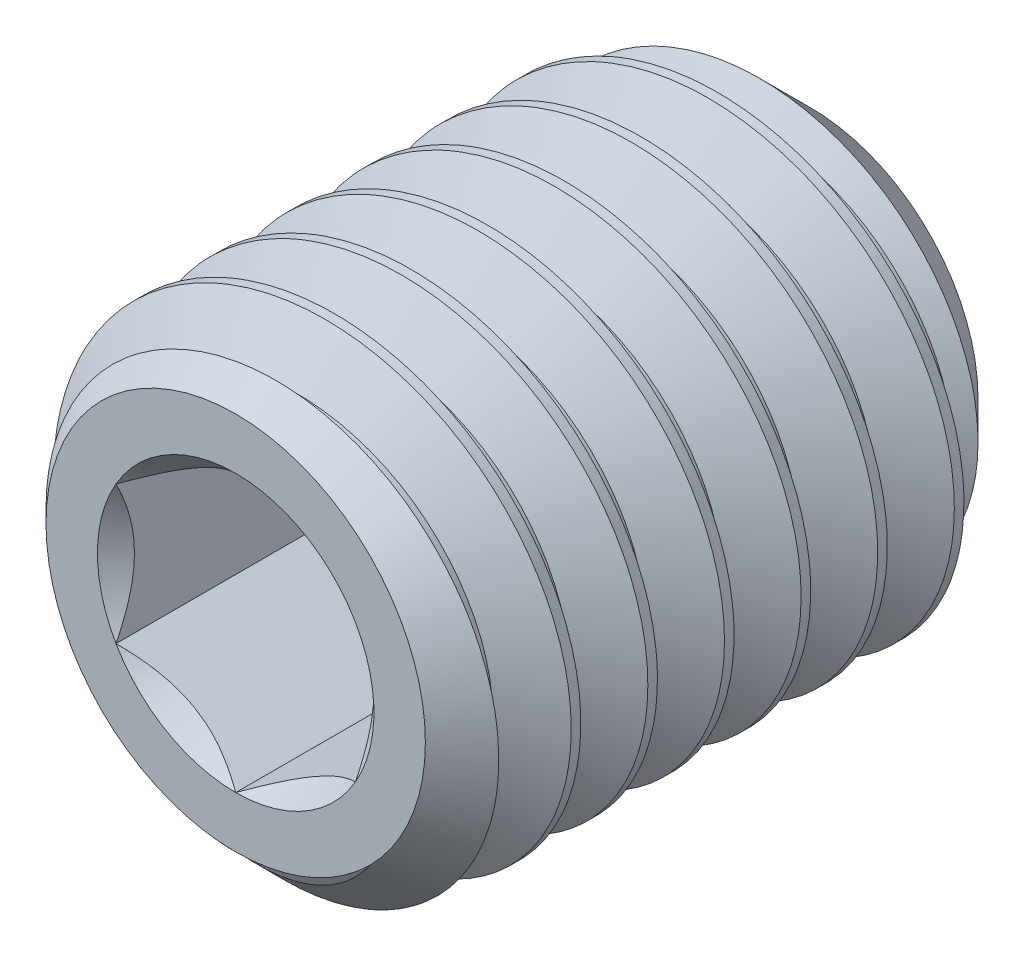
ISO-10303-21;
HEADER;
FILE_DESCRIPTION(('STEP AP214'),'2;1');
FILE_NAME('part.step','',(''),(''),'','','');
FILE_SCHEMA(('AUTOMOTIVE_DESIGN { 1 0 10303 214 1 1 1 1 }'));
ENDSEC;
DATA;
#1=APPLICATION_CONTEXT('core data for automotive mechanical design processes');
#2=APPLICATION_PROTOCOL_DEFINITION('international standard','automotive_design',2000,#1);
#3=PRODUCT_CONTEXT('',#1,'mechanical');
#4=PRODUCT('Part','Part','',(#3));
#5=PRODUCT_RELATED_PRODUCT_CATEGORY('part','',(#4));
#6=PRODUCT_DEFINITION_FORMATION('','',#4);
#7=PRODUCT_DEFINITION_CONTEXT('part definition',#1,'design');
#8=PRODUCT_DEFINITION('design','',#6,#7);
#9=PRODUCT_DEFINITION_SHAPE('','',#8);
#10=(LENGTH_UNIT() NAMED_UNIT(*) SI_UNIT(.MILLI.,.METRE.));
#11=(NAMED_UNIT(*) PLANE_ANGLE_UNIT() SI_UNIT($,.RADIAN.));
#12=(NAMED_UNIT(*) SI_UNIT($,.STERADIAN.) SOLID_ANGLE_UNIT());
#13=UNCERTAINTY_MEASURE_WITH_UNIT(LENGTH_MEASURE(1.E-05),#10,'distance_accuracy_value','');
#14=(GEOMETRIC_REPRESENTATION_CONTEXT(3) GLOBAL_UNCERTAINTY_ASSIGNED_CONTEXT((#13)) GLOBAL_UNIT_ASSIGNED_CONTEXT((#10,
#11,#12)) REPRESENTATION_CONTEXT('',''));
#15=CARTESIAN_POINT('',(0.,0.,0.));
#16=DIRECTION('',(0.,0.,1.));
#17=DIRECTION('',(1.,0.,0.));
#18=AXIS2_PLACEMENT_3D('',#15,#16,#17);
#19=CARTESIAN_POINT('',(0.,0.,3.));
#20=DIRECTION('',(0.,0.,1.));
#21=DIRECTION('',(1.,0.,0.));
#22=AXIS2_PLACEMENT_3D('',#19,#20,#21);
#23=CYLINDRICAL_SURFACE('',#22,2.5);
#24=CARTESIAN_POINT('',(0.,2.5,3.));
#25=CARTESIAN_POINT('',(1.03553390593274,2.5,2.95));
#26=CARTESIAN_POINT('',(1.76776695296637,1.76776695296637,2.9));
#27=CARTESIAN_POINT('',(2.5,1.03553390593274,2.85));
#28=CARTESIAN_POINT('',(2.5,0.,2.8));
#29=CARTESIAN_POINT('',(2.5,-1.03553390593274,2.75));
#30=CARTESIAN_POINT('',(1.76776695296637,-1.76776695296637,2.7));
#31=CARTESIAN_POINT('',(1.03553390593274,-2.5,2.65));
#32=CARTESIAN_POINT('',(0.,-2.5,2.6));
#33=CARTESIAN_POINT('',(-1.03553390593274,-2.5,2.55));
#34=CARTESIAN_POINT('',(-1.76776695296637,-1.76776695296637,2.5));
#35=CARTESIAN_POINT('',(-2.5,-1.03553390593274,2.45));
#36=CARTESIAN_POINT('',(-2.5,0.,2.4));
#37=CARTESIAN_POINT('',(-2.5,1.03553390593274,2.35));
#38=CARTESIAN_POINT('',(-1.76776695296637,1.76776695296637,2.3));
#39=CARTESIAN_POINT('',(-1.03553390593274,2.5,2.25));
#40=CARTESIAN_POINT('',(0.,2.5,2.2));
#41=CARTESIAN_POINT('',(1.03553390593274,2.5,2.15));
#42=CARTESIAN_POINT('',(1.76776695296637,1.76776695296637,2.1));
#43=CARTESIAN_POINT('',(2.5,1.03553390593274,2.05));
#44=CARTESIAN_POINT('',(2.5,0.,2.));
#45=CARTESIAN_POINT('',(2.5,-1.03553390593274,1.95));
#46=CARTESIAN_POINT('',(1.76776695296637,-1.76776695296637,1.9));
#47=CARTESIAN_POINT('',(1.03553390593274,-2.5,1.85));
#48=CARTESIAN_POINT('',(0.,-2.5,1.8));
#49=CARTESIAN_POINT('',(-1.03553390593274,-2.5,1.75));
#50=CARTESIAN_POINT('',(-1.76776695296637,-1.76776695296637,1.7));
#51=CARTESIAN_POINT('',(-2.5,-1.03553390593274,1.65));
#52=CARTESIAN_POINT('',(-2.5,0.,1.6));
#53=CARTESIAN_POINT('',(-2.5,1.03553390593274,1.55));
#54=CARTESIAN_POINT('',(-1.76776695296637,1.76776695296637,1.5));
#55=CARTESIAN_POINT('',(-1.03553390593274,2.5,1.45));
#56=CARTESIAN_POINT('',(0.,2.5,1.4));
#57=CARTESIAN_POINT('',(1.03553390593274,2.5,1.35));
#58=CARTESIAN_POINT('',(1.76776695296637,1.76776695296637,1.3));
#59=CARTESIAN_POINT('',(2.5,1.03553390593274,1.25));
#60=CARTESIAN_POINT('',(2.5,0.,1.2));
#61=CARTESIAN_POINT('',(2.5,-1.03553390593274,1.15));
#62=CARTESIAN_POINT('',(1.76776695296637,-1.76776695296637,1.1));
#63=CARTESIAN_POINT('',(1.03553390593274,-2.5,1.05));
#64=CARTESIAN_POINT('',(0.,-2.5,1.));
#65=CARTESIAN_POINT('',(-1.03553390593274,-2.5,0.95));
#66=CARTESIAN_POINT('',(-1.76776695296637,-1.76776695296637,0.9));
#67=CARTESIAN_POINT('',(-2.5,-1.03553390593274,0.850000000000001));
#68=CARTESIAN_POINT('',(-2.5,0.,0.8));
#69=CARTESIAN_POINT('',(-2.5,1.03553390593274,0.75));
#70=CARTESIAN_POINT('',(-1.76776695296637,1.76776695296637,0.700000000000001));
#71=CARTESIAN_POINT('',(-1.03553390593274,2.5,0.65));
#72=CARTESIAN_POINT('',(0.,2.5,0.6));
#73=CARTESIAN_POINT('',(1.03553390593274,2.5,0.55));
#74=CARTESIAN_POINT('',(1.76776695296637,1.76776695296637,0.5));
#75=CARTESIAN_POINT('',(2.5,1.03553390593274,0.45));
#76=CARTESIAN_POINT('',(2.5,0.,0.4));
#77=CARTESIAN_POINT('',(2.5,-1.03553390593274,0.35));
#78=CARTESIAN_POINT('',(1.76776695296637,-1.76776695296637,0.3));
#79=CARTESIAN_POINT('',(1.03553390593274,-2.5,0.25));
#80=CARTESIAN_POINT('',(0.,-2.5,0.2));
#81=CARTESIAN_POINT('',(-1.03553390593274,-2.5,0.15));
#82=CARTESIAN_POINT('',(-1.76776695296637,-1.76776695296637,0.1));
#83=CARTESIAN_POINT('',(-2.5,-1.03553390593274,0.0500000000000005));
#84=CARTESIAN_POINT('',(-2.5,0.,0.));
#85=CARTESIAN_POINT('',(-2.5,1.03553390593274,-0.0499999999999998));
#86=CARTESIAN_POINT('',(-1.76776695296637,1.76776695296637,-0.0999999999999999));
#87=CARTESIAN_POINT('',(-1.03553390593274,2.5,-0.15));
#88=CARTESIAN_POINT('',(0.,2.5,-0.2));
#89=CARTESIAN_POINT('',(1.03553390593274,2.5,-0.25));
#90=CARTESIAN_POINT('',(1.76776695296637,1.76776695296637,-0.3));
#91=CARTESIAN_POINT('',(2.5,1.03553390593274,-0.35));
#92=CARTESIAN_POINT('',(2.5,0.,-0.4));
#93=CARTESIAN_POINT('',(2.5,-1.03553390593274,-0.45));
#94=CARTESIAN_POINT('',(1.76776695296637,-1.76776695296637,-0.5));
#95=CARTESIAN_POINT('',(1.03553390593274,-2.5,-0.55));
#96=CARTESIAN_POINT('',(0.,-2.5,-0.6));
#97=CARTESIAN_POINT('',(-1.03553390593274,-2.5,-0.65));
#98=CARTESIAN_POINT('',(-1.76776695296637,-1.76776695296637,-0.7));
#99=CARTESIAN_POINT('',(-2.5,-1.03553390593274,-0.75));
#100=CARTESIAN_POINT('',(-2.5,0.,-0.799999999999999));
#101=CARTESIAN_POINT('',(-2.5,1.03553390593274,-0.85));
#102=CARTESIAN_POINT('',(-1.76776695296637,1.76776695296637,-0.9));
#103=CARTESIAN_POINT('',(-1.03553390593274,2.5,-0.95));
#104=CARTESIAN_POINT('',(0.,2.5,-1.));
#105=CARTESIAN_POINT('',(1.03553390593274,2.5,-1.05));
#106=CARTESIAN_POINT('',(1.76776695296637,1.76776695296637,-1.1));
#107=CARTESIAN_POINT('',(2.5,1.03553390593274,-1.15));
#108=CARTESIAN_POINT('',(2.5,0.,-1.2));
#109=CARTESIAN_POINT('',(2.5,-1.03553390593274,-1.25));
#110=CARTESIAN_POINT('',(1.76776695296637,-1.76776695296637,-1.3));
#111=CARTESIAN_POINT('',(1.03553390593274,-2.5,-1.35));
#112=CARTESIAN_POINT('',(0.,-2.5,-1.4));
#113=CARTESIAN_POINT('',(-1.03553390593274,-2.5,-1.45));
#114=CARTESIAN_POINT('',(-1.76776695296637,-1.76776695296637,-1.5));
#115=CARTESIAN_POINT('',(-2.5,-1.03553390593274,-1.55));
#116=CARTESIAN_POINT('',(-2.5,0.,-1.6));
#117=CARTESIAN_POINT('',(-2.5,1.03553390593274,-1.65));
#118=CARTESIAN_POINT('',(-1.76776695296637,1.76776695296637,-1.7));
#119=CARTESIAN_POINT('',(-1.03553390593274,2.5,-1.75));
#120=CARTESIAN_POINT('',(0.,2.5,-1.8));
#121=CARTESIAN_POINT('',(1.03553390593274,2.5,-1.85));
#122=CARTESIAN_POINT('',(1.76776695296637,1.76776695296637,-1.9));
#123=CARTESIAN_POINT('',(2.5,1.03553390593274,-1.95));
#124=CARTESIAN_POINT('',(2.5,0.,-2.));
#125=CARTESIAN_POINT('',(2.5,-1.03553390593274,-2.05));
#126=CARTESIAN_POINT('',(1.76776695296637,-1.76776695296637,-2.1));
#127=CARTESIAN_POINT('',(1.03553390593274,-2.5,-2.15));
#128=CARTESIAN_POINT('',(0.,-2.5,-2.2));
#129=CARTESIAN_POINT('',(-1.03553390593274,-2.5,-2.25));
#130=CARTESIAN_POINT('',(-1.76776695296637,-1.76776695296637,-2.3));
#131=CARTESIAN_POINT('',(-2.5,-1.03553390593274,-2.35));
#132=CARTESIAN_POINT('',(-2.5,0.,-2.4));
#133=CARTESIAN_POINT('',(-2.5,1.03553390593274,-2.45));
#134=CARTESIAN_POINT('',(-1.76776695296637,1.76776695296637,-2.5));
#135=CARTESIAN_POINT('',(-1.03553390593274,2.5,-2.55));
#136=CARTESIAN_POINT('',(0.,2.5,-2.6));
#137=CARTESIAN_POINT('',(1.03553390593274,2.5,-2.65));
#138=CARTESIAN_POINT('',(1.76776695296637,1.76776695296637,-2.7));
#139=CARTESIAN_POINT('',(2.5,1.03553390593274,-2.75));
#140=CARTESIAN_POINT('',(2.5,0.,-2.8));
#141=CARTESIAN_POINT('',(2.5,-1.03553390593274,-2.85));
#142=CARTESIAN_POINT('',(1.76776695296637,-1.76776695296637,-2.9));
#143=CARTESIAN_POINT('',(1.03553390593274,-2.5,-2.95));
#144=CARTESIAN_POINT('',(0.,-2.5,-3.));
#145=CARTESIAN_POINT('',(-1.03553390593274,-2.5,-3.05));
#146=CARTESIAN_POINT('',(-1.76776695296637,-1.76776695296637,-3.1));
#147=CARTESIAN_POINT('',(-2.5,-1.03553390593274,-3.15));
#148=CARTESIAN_POINT('',(-2.5,0.,-3.2));
#149=CARTESIAN_POINT('',(-2.5,1.03553390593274,-3.25));
#150=CARTESIAN_POINT('',(-1.76776695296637,1.76776695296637,-3.3));
#151=CARTESIAN_POINT('',(-1.03553390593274,2.5,-3.35));
#152=CARTESIAN_POINT('',(0.,2.5,-3.4));
#153=CARTESIAN_POINT('',(1.03553390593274,2.5,-3.45));
#154=CARTESIAN_POINT('',(1.76776695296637,1.76776695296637,-3.5));
#155=CARTESIAN_POINT('',(2.5,1.03553390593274,-3.55));
#156=CARTESIAN_POINT('',(2.5,0.,-3.6));
#157=CARTESIAN_POINT('',(2.5,-1.03553390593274,-3.65));
#158=CARTESIAN_POINT('',(1.76776695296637,-1.76776695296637,-3.7));
#159=CARTESIAN_POINT('',(1.03553390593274,-2.5,-3.75));
#160=CARTESIAN_POINT('',(0.,-2.5,-3.8));
#161=(BOUNDED_CURVE() B_SPLINE_CURVE(2,(#24,#25,#26,#27,#28,#29,#30,#31,#32,#33,#34,#35,#36,#37,
#38,#39,#40,#41,#42,#43,#44,#45,#46,#47,#48,#49,#50,#51,#52,#53,#54,#55,#56,#57,#58,#59,#60,#61,
#62,#63,#64,#65,#66,#67,#68,#69,#70,#71,#72,#73,#74,#75,#76,#77,#78,#79,#80,#81,#82,#83,#84,#85,
#86,#87,#88,#89,#90,#91,#92,#93,#94,#95,#96,#97,#98,#99,#100,#101,#102,#103,#104,#105,#106,#107,
#108,#109,#110,#111,#112,#113,#114,#115,#116,#117,#118,#119,#120,#121,#122,#123,#124,#125,#126,
#127,#128,#129,#130,#131,#132,#133,#134,#135,#136,#137,#138,#139,#140,#141,#142,#143,#144,#145,
#146,#147,#148,#149,#150,#151,#152,#153,#154,#155,#156,#157,#158,#159,#160),.UNSPECIFIED.,.F.,
.F.) B_SPLINE_CURVE_WITH_KNOTS((3,2,2,2,2,2,2,2,2,2,2,2,2,2,2,2,2,2,2,2,2,2,2,2,2,2,2,2,2,2,2,2,
2,2,2,2,2,2,2,2,2,2,2,2,2,2,2,2,2,2,2,2,2,2,2,2,2,2,2,2,2,2,2,2,2,2,2,2,3),(0.,
0.0138888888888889,0.0277777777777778,0.0416666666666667,0.0555555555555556,0.0694444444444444,
0.0833333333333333,0.0972222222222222,0.111111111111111,0.125,0.138888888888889,
0.152777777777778,0.166666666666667,0.180555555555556,0.194444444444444,0.208333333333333,
0.222222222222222,0.236111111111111,0.25,0.263888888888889,0.277777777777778,0.291666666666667,
0.305555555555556,0.319444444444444,0.333333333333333,0.347222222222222,0.361111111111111,0.375,
0.388888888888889,0.402777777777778,0.416666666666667,0.430555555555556,0.444444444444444,
0.458333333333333,0.472222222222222,0.486111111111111,0.5,0.513888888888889,0.527777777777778,
0.541666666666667,0.555555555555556,0.569444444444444,0.583333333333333,0.597222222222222,
0.611111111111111,0.625,0.638888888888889,0.652777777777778,0.666666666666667,0.680555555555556,
0.694444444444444,0.708333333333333,0.722222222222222,0.736111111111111,0.75,0.763888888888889,
0.777777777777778,0.791666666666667,0.805555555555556,0.819444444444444,0.833333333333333,
0.847222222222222,0.861111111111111,0.875,0.888888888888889,0.902777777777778,0.916666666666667,
0.930555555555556,0.944444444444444),
.UNSPECIFIED.) CURVE() GEOMETRIC_REPRESENTATION_ITEM() RATIONAL_B_SPLINE_CURVE((1.,
0.923879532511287,1.,0.923879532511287,1.,0.923879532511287,1.,0.923879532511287,1.,
0.923879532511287,1.,0.923879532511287,1.,0.923879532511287,1.,0.923879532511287,1.,
0.923879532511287,1.,0.923879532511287,1.,0.923879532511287,1.,0.923879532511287,1.,
0.923879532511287,1.,0.923879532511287,1.,0.923879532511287,1.,0.923879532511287,1.,
0.923879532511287,1.,0.923879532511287,1.,0.923879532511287,1.,0.923879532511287,1.,
0.923879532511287,1.,0.923879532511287,1.,0.923879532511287,1.,0.923879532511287,1.,
0.923879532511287,1.,0.923879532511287,1.,0.923879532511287,1.,0.923879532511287,1.,
0.923879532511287,1.,0.923879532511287,1.,0.923879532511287,1.,0.923879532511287,1.,
0.923879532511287,1.,0.923879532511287,1.,0.923879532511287,1.,0.923879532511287,1.,
0.923879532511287,1.,0.923879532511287,1.,0.923879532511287,1.,0.923879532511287,1.,
0.923879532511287,1.,0.923879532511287,1.,0.923879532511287,1.,0.923879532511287,1.,
0.923879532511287,1.,0.923879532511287,1.,0.923879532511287,1.,0.923879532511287,1.,
0.923879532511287,1.,0.923879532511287,1.,0.923879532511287,1.,0.923879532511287,1.,
0.923879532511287,1.,0.923879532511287,1.,0.923879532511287,1.,0.923879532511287,1.,
0.923879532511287,1.,0.923879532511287,1.,0.923879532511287,1.,0.923879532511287,1.,
0.923879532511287,1.,0.923879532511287,1.,0.923879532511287,1.,0.923879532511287,1.,
0.923879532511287,1.,0.923879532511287,1.,0.923879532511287,1.,0.923879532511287,1.)) REPRESENTATION_ITEM(''));
#162=CARTESIAN_POINT('',(-0.956708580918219,-2.30969883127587,-2.25000000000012));
#163=VERTEX_POINT('',#162);
#164=CARTESIAN_POINT('',(-2.02388722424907,-1.46761047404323,2.48038475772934));
#165=VERTEX_POINT('',#164);
#166=EDGE_CURVE('E182',#163,#165,#161,.F.);
#167=ORIENTED_EDGE('',*,*,#166,.F.);
#168=CARTESIAN_POINT('',(0.,0.,-2.25));
#169=DIRECTION('',(0.,0.,1.));
#170=DIRECTION('',(1.,0.,0.));
#171=AXIS2_PLACEMENT_3D('',#168,#169,#170);
#172=CIRCLE('',#171,2.5);
#173=CARTESIAN_POINT('',(0.956708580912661,-2.30969883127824,-2.25));
#174=VERTEX_POINT('',#173);
#175=EDGE_CURVE('E187',#163,#174,#172,.T.);
#176=ORIENTED_EDGE('',*,*,#175,.T.);
#177=CARTESIAN_POINT('',(0.,2.5,3.7));
#178=CARTESIAN_POINT('',(1.03553390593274,2.5,3.65));
#179=CARTESIAN_POINT('',(1.76776695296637,1.76776695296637,3.6));
#180=CARTESIAN_POINT('',(2.5,1.03553390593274,3.55));
#181=CARTESIAN_POINT('',(2.5,0.,3.5));
#182=CARTESIAN_POINT('',(2.5,-1.03553390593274,3.45));
#183=CARTESIAN_POINT('',(1.76776695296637,-1.76776695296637,3.4));
#184=CARTESIAN_POINT('',(1.03553390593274,-2.5,3.35));
#185=CARTESIAN_POINT('',(0.,-2.5,3.3));
#186=CARTESIAN_POINT('',(-1.03553390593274,-2.5,3.25));
#187=CARTESIAN_POINT('',(-1.76776695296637,-1.76776695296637,3.2));
#188=CARTESIAN_POINT('',(-2.5,-1.03553390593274,3.15));
#189=CARTESIAN_POINT('',(-2.5,0.,3.1));
#190=CARTESIAN_POINT('',(-2.5,1.03553390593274,3.05));
#191=CARTESIAN_POINT('',(-1.76776695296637,1.76776695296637,3.));
#192=CARTESIAN_POINT('',(-1.03553390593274,2.5,2.95));
#193=CARTESIAN_POINT('',(0.,2.5,2.9));
#194=CARTESIAN_POINT('',(1.03553390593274,2.5,2.85));
#195=CARTESIAN_POINT('',(1.76776695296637,1.76776695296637,2.8));
#196=CARTESIAN_POINT('',(2.5,1.03553390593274,2.75));
#197=CARTESIAN_POINT('',(2.5,0.,2.7));
#198=CARTESIAN_POINT('',(2.5,-1.03553390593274,2.65));
#199=CARTESIAN_POINT('',(1.76776695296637,-1.76776695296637,2.6));
#200=CARTESIAN_POINT('',(1.03553390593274,-2.5,2.55));
#201=CARTESIAN_POINT('',(0.,-2.5,2.5));
#202=CARTESIAN_POINT('',(-1.03553390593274,-2.5,2.45));
#203=CARTESIAN_POINT('',(-1.76776695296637,-1.76776695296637,2.4));
#204=CARTESIAN_POINT('',(-2.5,-1.03553390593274,2.35));
#205=CARTESIAN_POINT('',(-2.5,0.,2.3));
#206=CARTESIAN_POINT('',(-2.5,1.03553390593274,2.25));
#207=CARTESIAN_POINT('',(-1.76776695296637,1.76776695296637,2.2));
#208=CARTESIAN_POINT('',(-1.03553390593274,2.5,2.15));
#209=CARTESIAN_POINT('',(0.,2.5,2.1));
#210=CARTESIAN_POINT('',(1.03553390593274,2.5,2.05));
#211=CARTESIAN_POINT('',(1.76776695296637,1.76776695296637,2.));
#212=CARTESIAN_POINT('',(2.5,1.03553390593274,1.95));
#213=CARTESIAN_POINT('',(2.5,0.,1.9));
#214=CARTESIAN_POINT('',(2.5,-1.03553390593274,1.85));
#215=CARTESIAN_POINT('',(1.76776695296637,-1.76776695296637,1.8));
#216=CARTESIAN_POINT('',(1.03553390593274,-2.5,1.75));
#217=CARTESIAN_POINT('',(0.,-2.5,1.7));
#218=CARTESIAN_POINT('',(-1.03553390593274,-2.5,1.65));
#219=CARTESIAN_POINT('',(-1.76776695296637,-1.76776695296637,1.6));
#220=CARTESIAN_POINT('',(-2.5,-1.03553390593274,1.55));
#221=CARTESIAN_POINT('',(-2.5,0.,1.5));
#222=CARTESIAN_POINT('',(-2.5,1.03553390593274,1.45));
#223=CARTESIAN_POINT('',(-1.76776695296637,1.76776695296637,1.4));
#224=CARTESIAN_POINT('',(-1.03553390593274,2.5,1.35));
#225=CARTESIAN_POINT('',(0.,2.5,1.3));
#226=CARTESIAN_POINT('',(1.03553390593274,2.5,1.25));
#227=CARTESIAN_POINT('',(1.76776695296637,1.76776695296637,1.2));
#228=CARTESIAN_POINT('',(2.5,1.03553390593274,1.15));
#229=CARTESIAN_POINT('',(2.5,0.,1.1));
#230=CARTESIAN_POINT('',(2.5,-1.03553390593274,1.05));
#231=CARTESIAN_POINT('',(1.76776695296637,-1.76776695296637,1.));
#232=CARTESIAN_POINT('',(1.03553390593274,-2.5,0.950000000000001));
#233=CARTESIAN_POINT('',(0.,-2.5,0.900000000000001));
#234=CARTESIAN_POINT('',(-1.03553390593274,-2.5,0.850000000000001));
#235=CARTESIAN_POINT('',(-1.76776695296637,-1.76776695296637,0.8));
#236=CARTESIAN_POINT('',(-2.5,-1.03553390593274,0.750000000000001));
#237=CARTESIAN_POINT('',(-2.5,0.,0.700000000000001));
#238=CARTESIAN_POINT('',(-2.5,1.03553390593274,0.650000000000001));
#239=CARTESIAN_POINT('',(-1.76776695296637,1.76776695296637,0.6));
#240=CARTESIAN_POINT('',(-1.03553390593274,2.5,0.550000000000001));
#241=CARTESIAN_POINT('',(0.,2.5,0.500000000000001));
#242=CARTESIAN_POINT('',(1.03553390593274,2.5,0.45));
#243=CARTESIAN_POINT('',(1.76776695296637,1.76776695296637,0.400000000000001));
#244=CARTESIAN_POINT('',(2.5,1.03553390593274,0.350000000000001));
#245=CARTESIAN_POINT('',(2.5,0.,0.3));
#246=CARTESIAN_POINT('',(2.5,-1.03553390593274,0.25));
#247=CARTESIAN_POINT('',(1.76776695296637,-1.76776695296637,0.200000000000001));
#248=CARTESIAN_POINT('',(1.03553390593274,-2.5,0.15));
#249=CARTESIAN_POINT('',(0.,-2.5,0.1));
#250=CARTESIAN_POINT('',(-1.03553390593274,-2.5,0.0500000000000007));
#251=CARTESIAN_POINT('',(-1.76776695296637,-1.76776695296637,0.));
#252=CARTESIAN_POINT('',(-2.5,-1.03553390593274,-0.0499999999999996));
#253=CARTESIAN_POINT('',(-2.5,0.,-0.0999999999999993));
#254=CARTESIAN_POINT('',(-2.5,1.03553390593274,-0.149999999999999));
#255=CARTESIAN_POINT('',(-1.76776695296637,1.76776695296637,-0.2));
#256=CARTESIAN_POINT('',(-1.03553390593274,2.5,-0.25));
#257=CARTESIAN_POINT('',(0.,2.5,-0.299999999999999));
#258=CARTESIAN_POINT('',(1.03553390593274,2.5,-0.349999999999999));
#259=CARTESIAN_POINT('',(1.76776695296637,1.76776695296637,-0.4));
#260=CARTESIAN_POINT('',(2.5,1.03553390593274,-0.449999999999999));
#261=CARTESIAN_POINT('',(2.5,0.,-0.5));
#262=CARTESIAN_POINT('',(2.5,-1.03553390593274,-0.55));
#263=CARTESIAN_POINT('',(1.76776695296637,-1.76776695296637,-0.599999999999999));
#264=CARTESIAN_POINT('',(1.03553390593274,-2.5,-0.65));
#265=CARTESIAN_POINT('',(0.,-2.5,-0.7));
#266=CARTESIAN_POINT('',(-1.03553390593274,-2.5,-0.749999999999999));
#267=CARTESIAN_POINT('',(-1.76776695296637,-1.76776695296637,-0.8));
#268=CARTESIAN_POINT('',(-2.5,-1.03553390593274,-0.85));
#269=CARTESIAN_POINT('',(-2.5,0.,-0.899999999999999));
#270=CARTESIAN_POINT('',(-2.5,1.03553390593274,-0.95));
#271=CARTESIAN_POINT('',(-1.76776695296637,1.76776695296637,-0.999999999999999));
#272=CARTESIAN_POINT('',(-1.03553390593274,2.5,-1.05));
#273=CARTESIAN_POINT('',(0.,2.5,-1.1));
#274=CARTESIAN_POINT('',(1.03553390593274,2.5,-1.15));
#275=CARTESIAN_POINT('',(1.76776695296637,1.76776695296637,-1.2));
#276=CARTESIAN_POINT('',(2.5,1.03553390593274,-1.25));
#277=CARTESIAN_POINT('',(2.5,0.,-1.3));
#278=CARTESIAN_POINT('',(2.5,-1.03553390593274,-1.35));
#279=CARTESIAN_POINT('',(1.76776695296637,-1.76776695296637,-1.4));
#280=CARTESIAN_POINT('',(1.03553390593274,-2.5,-1.45));
#281=CARTESIAN_POINT('',(0.,-2.5,-1.5));
#282=CARTESIAN_POINT('',(-1.03553390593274,-2.5,-1.55));
#283=CARTESIAN_POINT('',(-1.76776695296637,-1.76776695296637,-1.6));
#284=CARTESIAN_POINT('',(-2.5,-1.03553390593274,-1.65));
#285=CARTESIAN_POINT('',(-2.5,0.,-1.7));
#286=CARTESIAN_POINT('',(-2.5,1.03553390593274,-1.75));
#287=CARTESIAN_POINT('',(-1.76776695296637,1.76776695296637,-1.8));
#288=CARTESIAN_POINT('',(-1.03553390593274,2.5,-1.85));
#289=CARTESIAN_POINT('',(0.,2.5,-1.9));
#290=CARTESIAN_POINT('',(1.03553390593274,2.5,-1.95));
#291=CARTESIAN_POINT('',(1.76776695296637,1.76776695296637,-2.));
#292=CARTESIAN_POINT('',(2.5,1.03553390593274,-2.05));
#293=CARTESIAN_POINT('',(2.5,0.,-2.1));
#294=CARTESIAN_POINT('',(2.5,-1.03553390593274,-2.15));
#295=CARTESIAN_POINT('',(1.76776695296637,-1.76776695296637,-2.2));
#296=CARTESIAN_POINT('',(1.03553390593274,-2.5,-2.25));
#297=CARTESIAN_POINT('',(0.,-2.5,-2.3));
#298=CARTESIAN_POINT('',(-1.03553390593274,-2.5,-2.35));
#299=CARTESIAN_POINT('',(-1.76776695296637,-1.76776695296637,-2.4));
#300=CARTESIAN_POINT('',(-2.5,-1.03553390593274,-2.45));
#301=CARTESIAN_POINT('',(-2.5,0.,-2.5));
#302=CARTESIAN_POINT('',(-2.5,1.03553390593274,-2.55));
#303=CARTESIAN_POINT('',(-1.76776695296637,1.76776695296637,-2.6));
#304=CARTESIAN_POINT('',(-1.03553390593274,2.5,-2.65));
#305=CARTESIAN_POINT('',(0.,2.5,-2.7));
#306=CARTESIAN_POINT('',(1.03553390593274,2.5,-2.75));
#307=CARTESIAN_POINT('',(1.76776695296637,1.76776695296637,-2.8));
#308=CARTESIAN_POINT('',(2.5,1.03553390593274,-2.85));
#309=CARTESIAN_POINT('',(2.5,0.,-2.9));
#310=CARTESIAN_POINT('',(2.5,-1.03553390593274,-2.95));
#311=CARTESIAN_POINT('',(1.76776695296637,-1.76776695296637,-3.));
#312=CARTESIAN_POINT('',(1.03553390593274,-2.5,-3.05));
#313=CARTESIAN_POINT('',(0.,-2.5,-3.1));
#314=(BOUNDED_CURVE() B_SPLINE_CURVE(2,(#177,#178,#179,#180,#181,#182,#183,#184,#185,#186,#187,
#188,#189,#190,#191,#192,#193,#194,#195,#196,#197,#198,#199,#200,#201,#202,#203,#204,#205,#206,
#207,#208,#209,#210,#211,#212,#213,#214,#215,#216,#217,#218,#219,#220,#221,#222,#223,#224,#225,
#226,#227,#228,#229,#230,#231,#232,#233,#234,#235,#236,#237,#238,#239,#240,#241,#242,#243,#244,
#245,#246,#247,#248,#249,#250,#251,#252,#253,#254,#255,#256,#257,#258,#259,#260,#261,#262,#263,
#264,#265,#266,#267,#268,#269,#270,#271,#272,#273,#274,#275,#276,#277,#278,#279,#280,#281,#282,
#283,#284,#285,#286,#287,#288,#289,#290,#291,#292,#293,#294,#295,#296,#297,#298,#299,#300,#301,
#302,#303,#304,#305,#306,#307,#308,#309,#310,#311,#312,#313),.UNSPECIFIED.,.F.,
.F.) B_SPLINE_CURVE_WITH_KNOTS((3,2,2,2,2,2,2,2,2,2,2,2,2,2,2,2,2,2,2,2,2,2,2,2,2,2,2,2,2,2,2,2,
2,2,2,2,2,2,2,2,2,2,2,2,2,2,2,2,2,2,2,2,2,2,2,2,2,2,2,2,2,2,2,2,2,2,2,2,3),(0.,
0.0138888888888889,0.0277777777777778,0.0416666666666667,0.0555555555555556,0.0694444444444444,
0.0833333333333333,0.0972222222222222,0.111111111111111,0.125,0.138888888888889,
0.152777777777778,0.166666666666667,0.180555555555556,0.194444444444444,0.208333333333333,
0.222222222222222,0.236111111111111,0.25,0.263888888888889,0.277777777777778,0.291666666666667,
0.305555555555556,0.319444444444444,0.333333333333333,0.347222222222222,0.361111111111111,0.375,
0.388888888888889,0.402777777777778,0.416666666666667,0.430555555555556,0.444444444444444,
0.458333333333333,0.472222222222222,0.486111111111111,0.5,0.513888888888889,0.527777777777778,
0.541666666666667,0.555555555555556,0.569444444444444,0.583333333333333,0.597222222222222,
0.611111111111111,0.625,0.638888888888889,0.652777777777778,0.666666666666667,0.680555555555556,
0.694444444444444,0.708333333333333,0.722222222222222,0.736111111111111,0.75,0.763888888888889,
0.777777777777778,0.791666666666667,0.805555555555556,0.819444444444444,0.833333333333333,
0.847222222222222,0.861111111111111,0.875,0.888888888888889,0.902777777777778,0.916666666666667,
0.930555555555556,0.944444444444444),
.UNSPECIFIED.) CURVE() GEOMETRIC_REPRESENTATION_ITEM() RATIONAL_B_SPLINE_CURVE((1.,
0.923879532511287,1.,0.923879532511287,1.,0.923879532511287,1.,0.923879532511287,1.,
0.923879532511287,1.,0.923879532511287,1.,0.923879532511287,1.,0.923879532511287,1.,
0.923879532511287,1.,0.923879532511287,1.,0.923879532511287,1.,0.923879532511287,1.,
0.923879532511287,1.,0.923879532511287,1.,0.923879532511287,1.,0.923879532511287,1.,
0.923879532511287,1.,0.923879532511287,1.,0.923879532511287,1.,0.923879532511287,1.,
0.923879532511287,1.,0.923879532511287,1.,0.923879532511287,1.,0.923879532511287,1.,
0.923879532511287,1.,0.923879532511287,1.,0.923879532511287,1.,0.923879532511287,1.,
0.923879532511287,1.,0.923879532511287,1.,0.923879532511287,1.,0.923879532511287,1.,
0.923879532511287,1.,0.923879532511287,1.,0.923879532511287,1.,0.923879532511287,1.,
0.923879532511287,1.,0.923879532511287,1.,0.923879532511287,1.,0.923879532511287,1.,
0.923879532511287,1.,0.923879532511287,1.,0.923879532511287,1.,0.923879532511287,1.,
0.923879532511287,1.,0.923879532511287,1.,0.923879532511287,1.,0.923879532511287,1.,
0.923879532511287,1.,0.923879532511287,1.,0.923879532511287,1.,0.923879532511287,1.,
0.923879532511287,1.,0.923879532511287,1.,0.923879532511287,1.,0.923879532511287,1.,
0.923879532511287,1.,0.923879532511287,1.,0.923879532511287,1.,0.923879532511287,1.,
0.923879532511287,1.,0.923879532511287,1.,0.923879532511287,1.,0.923879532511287,1.,
0.923879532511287,1.,0.923879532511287,1.,0.923879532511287,1.,0.923879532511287,1.)) REPRESENTATION_ITEM(''));
#315=CARTESIAN_POINT('',(-0.393347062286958,-2.46886169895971,2.48038475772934));
#316=VERTEX_POINT('',#315);
#317=EDGE_CURVE('E70',#316,#174,#314,.T.);
#318=ORIENTED_EDGE('',*,*,#317,.F.);
#319=CARTESIAN_POINT('',(0.,0.,2.48038475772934));
#320=DIRECTION('',(0.,0.,1.));
#321=DIRECTION('',(1.,0.,0.));
#322=AXIS2_PLACEMENT_3D('',#319,#320,#321);
#323=CIRCLE('',#322,2.5);
#324=EDGE_CURVE('E180',#165,#316,#323,.T.);
#325=ORIENTED_EDGE('',*,*,#324,.F.);
#326=EDGE_LOOP('',(#167,#176,#318,#325));
#327=FACE_BOUND('',#326,.T.);
#328=ADVANCED_FACE('F48',(#327),#23,.T.);
#329=CARTESIAN_POINT('',(0.,0.,3.));
#330=DIRECTION('',(0.,0.,-1.));
#331=DIRECTION('',(-1.,0.,0.));
#332=AXIS2_PLACEMENT_3D('',#329,#330,#331);
#333=PLANE('',#332);
#334=CARTESIAN_POINT('',(0.,0.,3.));
#335=DIRECTION('',(0.,0.,1.));
#336=DIRECTION('',(1.,0.,0.));
#337=AXIS2_PLACEMENT_3D('',#334,#335,#336);
#338=CIRCLE('',#337,1.44337567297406);
#339=CARTESIAN_POINT('',(-1.25,0.721687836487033,3.));
#340=VERTEX_POINT('',#339);
#341=CARTESIAN_POINT('',(-1.25,-0.721687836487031,3.));
#342=VERTEX_POINT('',#341);
#343=EDGE_CURVE('E333',#340,#342,#338,.T.);
#344=ORIENTED_EDGE('',*,*,#343,.F.);
#345=CARTESIAN_POINT('',(0.,1.44337567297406,3.));
#346=VERTEX_POINT('',#345);
#347=EDGE_CURVE('E325',#346,#340,#338,.T.);
#348=ORIENTED_EDGE('',*,*,#347,.F.);
#349=CARTESIAN_POINT('',(1.25,0.721687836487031,3.));
#350=VERTEX_POINT('',#349);
#351=EDGE_CURVE('E323',#350,#346,#338,.T.);
#352=ORIENTED_EDGE('',*,*,#351,.F.);
#353=CARTESIAN_POINT('',(1.25,-0.721687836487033,3.));
#354=VERTEX_POINT('',#353);
#355=EDGE_CURVE('E77',#354,#350,#338,.T.);
#356=ORIENTED_EDGE('',*,*,#355,.F.);
#357=CARTESIAN_POINT('',(0.,-1.44337567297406,3.));
#358=VERTEX_POINT('',#357);
#359=EDGE_CURVE('E335',#358,#354,#338,.T.);
#360=ORIENTED_EDGE('',*,*,#359,.F.);
#361=EDGE_CURVE('E338',#342,#358,#338,.T.);
#362=ORIENTED_EDGE('',*,*,#361,.F.);
#363=EDGE_LOOP('',(#344,#348,#352,#356,#360,#362));
#364=FACE_BOUND('',#363,.T.);
#365=CARTESIAN_POINT('',(0.,0.,3.));
#366=DIRECTION('',(0.,0.,1.));
#367=DIRECTION('',(1.,0.,0.));
#368=AXIS2_PLACEMENT_3D('',#365,#366,#367);
#369=CIRCLE('',#368,1.98038475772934);
#370=CARTESIAN_POINT('',(0.,-1.98038475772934,3.));
#371=VERTEX_POINT('',#370);
#372=CARTESIAN_POINT('',(1.40034349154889,-1.40034349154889,3.));
#373=VERTEX_POINT('',#372);
#374=EDGE_CURVE('E155',#371,#373,#369,.T.);
#375=ORIENTED_EDGE('',*,*,#374,.T.);
#376=EDGE_CURVE('E167',#373,#371,#369,.T.);
#377=ORIENTED_EDGE('',*,*,#376,.T.);
#378=EDGE_LOOP('',(#375,#377));
#379=FACE_BOUND('',#378,.T.);
#380=ADVANCED_FACE('F50',(#364,#379),#333,.F.);
#381=CARTESIAN_POINT('',(0.,0.,2.48038475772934));
#382=DIRECTION('',(0.,0.,-1.));
#383=DIRECTION('',(-1.,0.,0.));
#384=AXIS2_PLACEMENT_3D('',#381,#382,#383);
#385=CONICAL_SURFACE('',#384,2.5,0.785398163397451);
#386=ORIENTED_EDGE('',*,*,#376,.F.);
#387=CARTESIAN_POINT('',(1.40034349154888,-1.4003434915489,3.));
#388=CARTESIAN_POINT('',(1.36557936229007,-1.44682587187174,2.99171400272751));
#389=CARTESIAN_POINT('',(1.32889011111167,-1.49182153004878,2.98333952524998));
#390=CARTESIAN_POINT('',(1.25189211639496,-1.57857583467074,2.96647288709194));
#391=CARTESIAN_POINT('',(1.21158344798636,-1.62033454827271,2.95798072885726));
#392=CARTESIAN_POINT('',(1.08564637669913,-1.74029203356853,2.93243118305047));
#393=CARTESIAN_POINT('',(0.994944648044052,-1.81325522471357,2.91528587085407));
#394=CARTESIAN_POINT('',(0.800884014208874,-1.94417827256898,2.8809544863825));
#395=CARTESIAN_POINT('',(0.697329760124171,-2.00185020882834,2.86377304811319));
#396=CARTESIAN_POINT('',(0.535879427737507,-2.07455214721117,2.83853765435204));
#397=CARTESIAN_POINT('',(0.48103951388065,-2.09648599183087,2.83021485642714));
#398=CARTESIAN_POINT('',(0.369662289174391,-2.13562741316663,2.81378764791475));
#399=CARTESIAN_POINT('',(0.313125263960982,-2.15283578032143,2.80568320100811));
#400=CARTESIAN_POINT('',(0.198872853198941,-2.18238110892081,2.789740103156));
#401=CARTESIAN_POINT('',(0.141159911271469,-2.19472726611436,2.78190097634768));
#402=CARTESIAN_POINT('',(0.024848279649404,-2.21446470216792,2.76655253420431));
#403=CARTESIAN_POINT('',(-0.0337505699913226,-2.22185507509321,2.75904327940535));
#404=CARTESIAN_POINT('',(-0.151372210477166,-2.23219870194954,2.74382701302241));
#405=CARTESIAN_POINT('',(-0.210395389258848,-2.23514717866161,2.73611979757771));
#406=CARTESIAN_POINT('',(-0.328471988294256,-2.23651559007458,2.72063528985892));
#407=CARTESIAN_POINT('',(-0.38752540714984,-2.23493571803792,2.7128580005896));
#408=CARTESIAN_POINT('',(-0.572174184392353,-2.22290579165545,2.6884165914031));
#409=CARTESIAN_POINT('',(-0.697327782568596,-2.20443171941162,2.67167089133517));
#410=CARTESIAN_POINT('',(-0.942909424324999,-2.147356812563,2.63845979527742));
#411=CARTESIAN_POINT('',(-1.06334026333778,-2.1087680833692,2.62199423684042));
#412=CARTESIAN_POINT('',(-1.24052004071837,-2.03562631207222,2.59744385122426));
#413=CARTESIAN_POINT('',(-1.3001676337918,-2.00797693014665,2.5891186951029));
#414=CARTESIAN_POINT('',(-1.41693717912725,-1.94769917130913,2.57268926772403));
#415=CARTESIAN_POINT('',(-1.47405913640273,-1.91507080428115,2.56458499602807));
#416=CARTESIAN_POINT('',(-1.58535071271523,-1.84508630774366,2.54863151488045));
#417=CARTESIAN_POINT('',(-1.63952121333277,-1.8077316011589,2.54078222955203));
#418=CARTESIAN_POINT('',(-1.71824210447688,-1.74833708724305,2.52926816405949));
#419=CARTESIAN_POINT('',(-1.74405903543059,-1.7279793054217,2.52547358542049));
#420=CARTESIAN_POINT('',(-1.79488859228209,-1.68629158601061,2.5178376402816));
#421=CARTESIAN_POINT('',(-1.81990122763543,-1.66496165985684,2.51399627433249));
#422=CARTESIAN_POINT('',(-1.87584470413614,-1.61535764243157,2.50521959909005));
#423=CARTESIAN_POINT('',(-1.90651158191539,-1.58678691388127,2.50027394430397));
#424=CARTESIAN_POINT('',(-1.9663310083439,-1.52824383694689,2.49035208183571));
#425=CARTESIAN_POINT('',(-1.99548689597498,-1.49827488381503,2.48537597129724));
#426=CARTESIAN_POINT('',(-2.02388722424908,-1.46761047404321,2.48038475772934));
#427=B_SPLINE_CURVE_WITH_KNOTS('',3,(#387,#388,#389,#390,#391,#392,#393,#394,#395,#396,#397,
#398,#399,#400,#401,#402,#403,#404,#405,#406,#407,#408,#409,#410,#411,#412,#413,#414,#415,#416,
#417,#418,#419,#420,#421,#422,#423,#424,#425,#426),.UNSPECIFIED.,.F.,.F.,(4,2,2,2,2,2,2,2,2,2,2,
2,2,2,2,2,2,2,2,4),(0.,0.17579920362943,0.351594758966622,0.702875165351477,1.06036330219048,
1.23912781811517,1.41786241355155,1.59625733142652,1.77468485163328,1.95330413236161,
2.13191579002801,2.51296758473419,2.89379031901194,3.09239662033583,3.29100252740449,
3.48954878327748,3.58881471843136,3.68807948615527,3.81464066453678,3.94090906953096),.UNSPECIFIED.);
#428=EDGE_CURVE('E314',#373,#165,#427,.T.);
#429=ORIENTED_EDGE('',*,*,#428,.T.);
#430=ORIENTED_EDGE('',*,*,#324,.T.);
#431=CARTESIAN_POINT('',(-0.393347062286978,-2.46886169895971,2.48038475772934));
#432=CARTESIAN_POINT('',(-0.335554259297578,-2.47616823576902,2.48226517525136));
#433=CARTESIAN_POINT('',(-0.277509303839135,-2.48146957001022,2.48412568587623));
#434=CARTESIAN_POINT('',(-0.161190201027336,-2.48803774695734,2.48781027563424));
#435=CARTESIAN_POINT('',(-0.102916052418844,-2.48930456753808,2.48963435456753));
#436=CARTESIAN_POINT('',(0.013621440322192,-2.48777908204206,2.49325055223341));
#437=CARTESIAN_POINT('',(0.0718847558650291,-2.48498428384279,2.49504265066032));
#438=CARTESIAN_POINT('',(0.188051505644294,-2.47524179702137,2.49869458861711));
#439=CARTESIAN_POINT('',(0.245954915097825,-2.46829382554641,2.50055443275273));
#440=CARTESIAN_POINT('',(0.441958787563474,-2.43764669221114,2.50694987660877));
#441=CARTESIAN_POINT('',(0.578652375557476,-2.40412025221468,2.51158030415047));
#442=CARTESIAN_POINT('',(0.844310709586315,-2.31421491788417,2.52095314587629));
#443=CARTESIAN_POINT('',(0.97327441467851,-2.25783295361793,2.52569557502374));
#444=CARTESIAN_POINT('',(1.15706816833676,-2.15798683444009,2.53274634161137));
#445=CARTESIAN_POINT('',(1.21633151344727,-2.12246821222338,2.53506962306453));
#446=CARTESIAN_POINT('',(1.33167409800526,-2.04655470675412,2.53969081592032));
#447=CARTESIAN_POINT('',(1.38775322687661,-2.00615965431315,2.54198872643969));
#448=CARTESIAN_POINT('',(1.49629655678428,-1.92078341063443,2.54655080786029));
#449=CARTESIAN_POINT('',(1.54876084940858,-1.87580233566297,2.54881497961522));
#450=CARTESIAN_POINT('',(1.64973392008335,-1.78159735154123,2.55325704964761));
#451=CARTESIAN_POINT('',(1.69824283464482,-1.7323735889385,2.55543495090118));
#452=CARTESIAN_POINT('',(1.79083232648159,-1.62993890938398,2.55984276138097));
#453=CARTESIAN_POINT('',(1.83491408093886,-1.57672905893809,2.56207265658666));
#454=CARTESIAN_POINT('',(1.9182966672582,-1.46671350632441,2.56660274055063));
#455=CARTESIAN_POINT('',(1.95759746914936,-1.40990778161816,2.56890292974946));
#456=CARTESIAN_POINT('',(2.06786731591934,-1.2347340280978,2.57587263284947));
#457=CARTESIAN_POINT('',(2.13130686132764,-1.11149519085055,2.58061617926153));
#458=CARTESIAN_POINT('',(2.23463324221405,-0.85925462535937,2.59003045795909));
#459=CARTESIAN_POINT('',(2.27507677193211,-0.730478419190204,2.59469998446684));
#460=CARTESIAN_POINT('',(2.33376117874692,-0.467926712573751,2.60397313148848));
#461=CARTESIAN_POINT('',(2.35199888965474,-0.334150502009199,2.60857674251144));
#462=CARTESIAN_POINT('',(2.3657983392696,-0.065306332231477,2.61751470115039));
#463=CARTESIAN_POINT('',(2.36134303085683,0.0697625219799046,2.62184884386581));
#464=CARTESIAN_POINT('',(2.32912340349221,0.337063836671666,2.63084430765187));
#465=CARTESIAN_POINT('',(2.30136756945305,0.469297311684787,2.63550550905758));
#466=CARTESIAN_POINT('',(2.22427509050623,0.72435012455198,2.64485494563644));
#467=CARTESIAN_POINT('',(2.17538636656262,0.847305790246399,2.6495407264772));
#468=CARTESIAN_POINT('',(2.05744361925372,1.08327217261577,2.65891958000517));
#469=CARTESIAN_POINT('',(1.98838326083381,1.19627975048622,2.66361265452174));
#470=CARTESIAN_POINT('',(1.87156418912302,1.35534924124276,2.67053261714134));
#471=CARTESIAN_POINT('',(1.83055827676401,1.40649809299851,2.67281285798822));
#472=CARTESIAN_POINT('',(1.74437618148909,1.50517847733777,2.6773149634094));
#473=CARTESIAN_POINT('',(1.69920000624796,1.55271001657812,2.67953682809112));
#474=CARTESIAN_POINT('',(1.60499129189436,1.64375438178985,2.68394383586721));
#475=CARTESIAN_POINT('',(1.55596018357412,1.68726868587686,2.68612899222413));
#476=CARTESIAN_POINT('',(1.45431429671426,1.76985476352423,2.69059700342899));
#477=CARTESIAN_POINT('',(1.40169968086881,1.80892673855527,2.69287985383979));
#478=CARTESIAN_POINT('',(1.24036937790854,1.9181943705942,2.69974816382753));
#479=CARTESIAN_POINT('',(1.126954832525,1.98160938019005,2.70440932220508));
#480=CARTESIAN_POINT('',(0.890922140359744,2.08813498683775,2.71382272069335));
#481=CARTESIAN_POINT('',(0.768301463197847,2.131239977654,2.71857498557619));
#482=CARTESIAN_POINT('',(0.581323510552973,2.1794725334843,2.72561904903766));
#483=CARTESIAN_POINT('',(0.518975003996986,2.19277205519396,2.72793571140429));
#484=CARTESIAN_POINT('',(0.393360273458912,2.21407396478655,2.73253964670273));
#485=CARTESIAN_POINT('',(0.330094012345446,2.22207613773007,2.73482691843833));
#486=CARTESIAN_POINT('',(0.20312742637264,2.232713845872,2.73935381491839));
#487=CARTESIAN_POINT('',(0.139427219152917,2.23535078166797,2.7415934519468));
#488=CARTESIAN_POINT('',(0.0120460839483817,2.23525223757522,2.74600766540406));
#489=CARTESIAN_POINT('',(-0.051634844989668,2.23251709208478,2.74818224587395));
#490=CARTESIAN_POINT('',(-0.241550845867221,2.216037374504,2.75482582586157));
#491=CARTESIAN_POINT('',(-0.367170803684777,2.1940627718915,2.7594308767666));
#492=CARTESIAN_POINT('',(-0.612678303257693,2.12882592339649,2.76879186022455));
#493=CARTESIAN_POINT('',(-0.732565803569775,2.08556352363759,2.77354779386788));
#494=CARTESIAN_POINT('',(-0.960235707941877,1.98037613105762,2.78297009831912));
#495=CARTESIAN_POINT('',(-1.06824472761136,1.91894106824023,2.7876357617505));
#496=CARTESIAN_POINT('',(-1.27243957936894,1.77873549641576,2.79687793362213));
#497=CARTESIAN_POINT('',(-1.36862496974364,1.69996434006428,2.80145443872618));
#498=CARTESIAN_POINT('',(-1.50196903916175,1.57060397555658,2.80809208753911));
#499=CARTESIAN_POINT('',(-1.54463122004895,1.52556684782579,2.81026881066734));
#500=CARTESIAN_POINT('',(-1.6258851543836,1.4319632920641,2.81470105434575));
#501=CARTESIAN_POINT('',(-1.66447715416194,1.38339707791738,2.81695657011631));
#502=CARTESIAN_POINT('',(-1.77365055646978,1.23298750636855,2.82381382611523));
#503=CARTESIAN_POINT('',(-1.83773997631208,1.12632595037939,2.82851157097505));
#504=CARTESIAN_POINT('',(-1.94509438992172,0.906325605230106,2.83790134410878));
#505=CARTESIAN_POINT('',(-1.98884200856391,0.793221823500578,2.84259055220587));
#506=CARTESIAN_POINT('',(-2.03968111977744,0.619344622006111,2.84960354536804));
#507=CARTESIAN_POINT('',(-2.0541679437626,0.560646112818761,2.85193911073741));
#508=CARTESIAN_POINT('',(-2.07812607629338,0.442215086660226,2.85658576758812));
#509=CARTESIAN_POINT('',(-2.08759715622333,0.382482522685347,2.85889685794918));
#510=CARTESIAN_POINT('',(-2.10140850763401,0.262677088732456,2.86347681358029));
#511=CARTESIAN_POINT('',(-2.10576949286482,0.202606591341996,2.865745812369));
#512=CARTESIAN_POINT('',(-2.10943790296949,0.082308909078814,2.8701982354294));
#513=CARTESIAN_POINT('',(-2.10874553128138,0.022081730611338,2.87238166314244));
#514=CARTESIAN_POINT('',(-2.102156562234,-0.0980673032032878,2.87680023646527));
#515=CARTESIAN_POINT('',(-2.09626218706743,-0.157989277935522,2.87903535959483));
#516=CARTESIAN_POINT('',(-2.0792903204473,-0.277074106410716,2.88357754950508));
#517=CARTESIAN_POINT('',(-2.06821288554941,-0.336236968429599,2.88588461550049));
#518=CARTESIAN_POINT('',(-2.02775945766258,-0.510031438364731,2.89280215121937));
#519=CARTESIAN_POINT('',(-1.99104366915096,-0.623044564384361,2.89748510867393));
#520=CARTESIAN_POINT('',(-1.89889371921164,-0.841148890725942,2.90690673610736));
#521=CARTESIAN_POINT('',(-1.84345182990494,-0.946236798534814,2.91164542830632));
#522=CARTESIAN_POINT('',(-1.71635224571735,-1.14404335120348,2.92099214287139));
#523=CARTESIAN_POINT('',(-1.64493033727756,-1.2369134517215,2.92560106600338));
#524=CARTESIAN_POINT('',(-1.4875493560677,-1.40934031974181,2.93454800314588));
#525=CARTESIAN_POINT('',(-1.4015984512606,-1.48890451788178,2.93888616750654));
#526=CARTESIAN_POINT('',(-1.21779638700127,-1.63141400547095,2.94786612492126));
#527=CARTESIAN_POINT('',(-1.12002994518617,-1.69446841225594,2.95250565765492));
#528=CARTESIAN_POINT('',(-0.915103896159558,-1.80284361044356,2.9619122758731));
#529=CARTESIAN_POINT('',(-0.807940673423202,-1.84815753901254,2.96667940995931));
#530=CARTESIAN_POINT('',(-0.585444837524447,-1.92027325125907,2.97630580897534));
#531=CARTESIAN_POINT('',(-0.470003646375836,-1.94674425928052,2.98116525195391));
#532=CARTESIAN_POINT('',(-0.294775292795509,-1.97100289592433,2.98833810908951));
#533=CARTESIAN_POINT('',(-0.235963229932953,-1.9765122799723,2.99071192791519));
#534=CARTESIAN_POINT('',(-0.118078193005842,-1.98234310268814,2.99540272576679));
#535=CARTESIAN_POINT('',(-0.059005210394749,-1.98266437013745,2.99771970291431));
#536=CARTESIAN_POINT('',(0.,-1.98038475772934,3.));
#537=B_SPLINE_CURVE_WITH_KNOTS('',3,(#431,#432,#433,#434,#435,#436,#437,#438,#439,#440,#441,
#442,#443,#444,#445,#446,#447,#448,#449,#450,#451,#452,#453,#454,#455,#456,#457,#458,#459,#460,
#461,#462,#463,#464,#465,#466,#467,#468,#469,#470,#471,#472,#473,#474,#475,#476,#477,#478,#479,
#480,#481,#482,#483,#484,#485,#486,#487,#488,#489,#490,#491,#492,#493,#494,#495,#496,#497,#498,
#499,#500,#501,#502,#503,#504,#505,#506,#507,#508,#509,#510,#511,#512,#513,#514,#515,#516,#517,
#518,#519,#520,#521,#522,#523,#524,#525,#526,#527,#528,#529,#530,#531,#532,#533,#534,#535,#536),
.UNSPECIFIED.,.F.,.F.,(4,2,2,2,2,2,2,2,2,2,2,2,2,2,2,2,2,2,2,2,2,2,2,2,2,2,2,2,2,2,2,2,2,2,2,2,
2,2,2,2,2,2,2,2,2,2,2,2,2,2,2,2,4),(0.,0.174810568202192,0.349622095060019,0.524540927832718,
0.699471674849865,1.1197148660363,1.54001452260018,1.74720388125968,1.95440043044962,
2.16159172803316,2.36877587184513,2.57590477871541,2.78303498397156,3.19683972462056,
3.60014636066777,4.00351049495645,4.40717768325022,4.810697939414,5.20605530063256,
5.60153696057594,5.79813538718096,5.9947334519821,6.19125888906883,6.38777540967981,
6.77582330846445,7.16397825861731,7.35516965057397,7.54636879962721,7.73751802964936,
7.92865536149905,8.30940905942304,8.6901655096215,9.06147024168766,9.43278884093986,
9.61881374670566,9.80482738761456,10.176398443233,10.5386365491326,10.7199695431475,
10.9013108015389,11.081914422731,11.2625107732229,11.4430300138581,11.623547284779,
11.9784230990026,12.3334455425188,12.6835396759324,13.0334376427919,13.3809610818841,
13.7286188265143,14.0822382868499,14.2593928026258,14.4365531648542),.UNSPECIFIED.);
#538=EDGE_CURVE('E171',#316,#371,#537,.T.);
#539=ORIENTED_EDGE('',*,*,#538,.T.);
#540=EDGE_LOOP('',(#386,#429,#430,#539));
#541=FACE_BOUND('',#540,.T.);
#542=ADVANCED_FACE('F177',(#541),#385,.T.);
#543=CARTESIAN_POINT('',(0.,0.,-3.));
#544=DIRECTION('',(0.,0.,1.));
#545=DIRECTION('',(1.,0.,0.));
#546=AXIS2_PLACEMENT_3D('',#543,#544,#545);
#547=CONICAL_SURFACE('',#546,1.75,0.78539816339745);
#548=ORIENTED_EDGE('',*,*,#175,.F.);
#549=CARTESIAN_POINT('',(-0.956708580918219,-2.30969883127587,-2.25000000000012));
#550=CARTESIAN_POINT('',(-1.00974317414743,-2.28564767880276,-2.2519283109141));
#551=CARTESIAN_POINT('',(-1.06193317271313,-2.25973667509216,-2.25385895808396));
#552=CARTESIAN_POINT('',(-1.16436646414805,-2.20434057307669,-2.25771486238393));
#553=CARTESIAN_POINT('',(-1.21461016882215,-2.1748562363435,-2.2596401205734));
#554=CARTESIAN_POINT('',(-1.31299297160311,-2.1123999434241,-2.26347901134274));
#555=CARTESIAN_POINT('',(-1.3611286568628,-2.07942260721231,-2.26539262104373));
#556=CARTESIAN_POINT('',(-1.45498169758,-2.01017724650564,-2.26919657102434));
#557=CARTESIAN_POINT('',(-1.500698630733,-1.97390865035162,-2.27108690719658));
#558=CARTESIAN_POINT('',(-1.59863080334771,-1.89046775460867,-2.27521697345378));
#559=CARTESIAN_POINT('',(-1.65024688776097,-1.84258765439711,-2.27744853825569));
#560=CARTESIAN_POINT('',(-1.74924250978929,-1.74264967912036,-2.28185769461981));
#561=CARTESIAN_POINT('',(-1.79662175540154,-1.69059151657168,-2.28403528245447));
#562=CARTESIAN_POINT('',(-1.93165110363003,-1.52858245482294,-2.29070102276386));
#563=CARTESIAN_POINT('',(-2.01233409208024,-1.41267721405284,-2.29532745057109));
#564=CARTESIAN_POINT('',(-2.15127097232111,-1.17087329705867,-2.30463830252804));
#565=CARTESIAN_POINT('',(-2.20988580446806,-1.0451801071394,-2.30932037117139));
#566=CARTESIAN_POINT('',(-2.30500478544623,-0.785626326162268,-2.3187098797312));
#567=CARTESIAN_POINT('',(-2.34150060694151,-0.651762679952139,-2.3234173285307));
#568=CARTESIAN_POINT('',(-2.39103842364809,-0.380899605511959,-2.33268802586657));
#569=CARTESIAN_POINT('',(-2.40428031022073,-0.243937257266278,-2.33725216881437));
#570=CARTESIAN_POINT('',(-2.40679659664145,-0.0384318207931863,-2.34387439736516));
#571=CARTESIAN_POINT('',(-2.40474143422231,0.0300984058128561,-2.34604501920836));
#572=CARTESIAN_POINT('',(-2.3947076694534,0.166720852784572,-2.35047191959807));
#573=CARTESIAN_POINT('',(-2.38672943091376,0.234813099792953,-2.35272819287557));
#574=CARTESIAN_POINT('',(-2.35418532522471,0.436427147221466,-2.35954244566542));
#575=CARTESIAN_POINT('',(-2.32102556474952,0.56865130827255,-2.36418846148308));
#576=CARTESIAN_POINT('',(-2.23255470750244,0.825504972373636,-2.37358883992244));
#577=CARTESIAN_POINT('',(-2.17723869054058,0.950132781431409,-2.37834322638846));
#578=CARTESIAN_POINT('',(-2.07956198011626,1.12747435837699,-2.38540462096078));
#579=CARTESIAN_POINT('',(-2.04490382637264,1.18454740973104,-2.38772747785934));
#580=CARTESIAN_POINT('',(-1.97089249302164,1.29558886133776,-2.39234709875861));
#581=CARTESIAN_POINT('',(-1.93153917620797,1.34955717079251,-2.39464386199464));
#582=CARTESIAN_POINT('',(-1.84842692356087,1.45396548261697,-2.39920240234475));
#583=CARTESIAN_POINT('',(-1.80466881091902,1.50440614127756,-2.40146418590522));
#584=CARTESIAN_POINT('',(-1.71307540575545,1.60144221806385,-2.40590132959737));
#585=CARTESIAN_POINT('',(-1.66524026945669,1.64803778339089,-2.40807669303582));
#586=CARTESIAN_POINT('',(-1.56575096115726,1.73690062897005,-2.41248825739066));
#587=CARTESIAN_POINT('',(-1.51409916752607,1.77917056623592,-2.41472441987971));
#588=CARTESIAN_POINT('',(-1.40734976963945,1.85907113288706,-2.41926373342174));
#589=CARTESIAN_POINT('',(-1.35225212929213,1.8967017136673,-2.42156688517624));
#590=CARTESIAN_POINT('',(-1.18239792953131,2.00219427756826,-2.42854542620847));
#591=CARTESIAN_POINT('',(-1.06297677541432,2.06274918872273,-2.43329446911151));
#592=CARTESIAN_POINT('',(-0.818769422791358,2.16103282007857,-2.44271452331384));
#593=CARTESIAN_POINT('',(-0.69420235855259,2.1993122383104,-2.44738436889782));
#594=CARTESIAN_POINT('',(-0.440377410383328,2.25440661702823,-2.45665186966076));
#595=CARTESIAN_POINT('',(-0.311119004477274,2.2712191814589,-2.46124951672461));
#596=CARTESIAN_POINT('',(-0.0514804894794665,2.28293413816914,-2.47018497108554));
#597=CARTESIAN_POINT('',(0.078900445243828,2.2778187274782,-2.47452256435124));
#598=CARTESIAN_POINT('',(0.336775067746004,2.24506434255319,-2.48353320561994));
#599=CARTESIAN_POINT('',(0.464269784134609,2.21743352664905,-2.48820613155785));
#600=CARTESIAN_POINT('',(0.709878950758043,2.14142195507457,-2.49756754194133));
#601=CARTESIAN_POINT('',(0.828135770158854,2.0934980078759,-2.50225355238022));
#602=CARTESIAN_POINT('',(1.05493430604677,1.97826934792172,-2.51162982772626));
#603=CARTESIAN_POINT('',(1.16347289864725,1.91095843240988,-2.51632009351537));
#604=CARTESIAN_POINT('',(1.31613900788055,1.79729362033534,-2.52323567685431));
#605=CARTESIAN_POINT('',(1.36521387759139,1.75741835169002,-2.52551467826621));
#606=CARTESIAN_POINT('',(1.45985068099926,1.67367062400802,-2.53000995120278));
#607=CARTESIAN_POINT('',(1.5054126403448,1.62979819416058,-2.53222622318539));
#608=CARTESIAN_POINT('',(1.59262415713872,1.53834999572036,-2.53663453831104));
#609=CARTESIAN_POINT('',(1.63427521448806,1.49077565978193,-2.53882659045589));
#610=CARTESIAN_POINT('',(1.71326417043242,1.392196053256,-2.54330674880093));
#611=CARTESIAN_POINT('',(1.75060225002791,1.34119092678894,-2.54559485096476));
#612=CARTESIAN_POINT('',(1.8548547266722,1.18495793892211,-2.55247368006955));
#613=CARTESIAN_POINT('',(1.91520720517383,1.07524959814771,-2.55713911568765));
#614=CARTESIAN_POINT('',(2.01628309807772,0.847095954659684,-2.56655782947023));
#615=CARTESIAN_POINT('',(2.05700069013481,0.728648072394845,-2.57131113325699));
#616=CARTESIAN_POINT('',(2.10222519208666,0.548155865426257,-2.57835357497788));
#617=CARTESIAN_POINT('',(2.11462200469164,0.487993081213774,-2.58066905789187));
#618=CARTESIAN_POINT('',(2.1343046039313,0.366818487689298,-2.58527047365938));
#619=CARTESIAN_POINT('',(2.14159017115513,0.305806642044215,-2.5875564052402));
#620=CARTESIAN_POINT('',(2.15098975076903,0.183401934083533,-2.59207701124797));
#621=CARTESIAN_POINT('',(2.15310524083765,0.122009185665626,-2.59431170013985));
#622=CARTESIAN_POINT('',(2.15214988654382,-0.000721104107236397,-2.59872504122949));
#623=CARTESIAN_POINT('',(2.14907939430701,-0.0620586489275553,-2.60090369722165));
#624=CARTESIAN_POINT('',(2.13189749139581,-0.244849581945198,-2.60755912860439));
#625=CARTESIAN_POINT('',(2.10986108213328,-0.365652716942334,-2.61217416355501));
#626=CARTESIAN_POINT('',(2.0453231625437,-0.601591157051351,-2.62154914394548));
#627=CARTESIAN_POINT('',(2.00282091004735,-0.716726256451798,-2.62630909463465));
#628=CARTESIAN_POINT('',(1.89994338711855,-0.935153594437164,-2.63573541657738));
#629=CARTESIAN_POINT('',(1.84004678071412,-1.03867154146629,-2.64040111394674));
#630=CARTESIAN_POINT('',(1.70365731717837,-1.23420200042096,-2.64963536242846));
#631=CARTESIAN_POINT('',(1.62716464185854,-1.32621463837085,-2.65420391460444));
#632=CARTESIAN_POINT('',(1.50171118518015,-1.4536264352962,-2.66083799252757));
#633=CARTESIAN_POINT('',(1.45805836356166,-1.49436475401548,-2.66301497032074));
#634=CARTESIAN_POINT('',(1.36737617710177,-1.57188621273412,-2.66745563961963));
#635=CARTESIAN_POINT('',(1.32034701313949,-1.60866958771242,-2.66971932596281));
#636=CARTESIAN_POINT('',(1.17476151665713,-1.7126302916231,-2.67659793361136));
#637=CARTESIAN_POINT('',(1.0716108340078,-1.77351605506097,-2.68130533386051));
#638=CARTESIAN_POINT('',(0.859191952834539,-1.87508757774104,-2.69070509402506));
#639=CARTESIAN_POINT('',(0.750159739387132,-1.91626797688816,-2.69539451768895));
#640=CARTESIAN_POINT('',(0.582679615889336,-1.96380012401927,-2.7024040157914));
#641=CARTESIAN_POINT('',(0.526169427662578,-1.97727415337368,-2.70473752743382));
#642=CARTESIAN_POINT('',(0.412193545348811,-1.99939741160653,-2.7093792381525));
#643=CARTESIAN_POINT('',(0.354727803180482,-2.0080463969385,-2.71168743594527));
#644=CARTESIAN_POINT('',(0.239482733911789,-2.02041664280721,-2.71626141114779));
#645=CARTESIAN_POINT('',(0.181705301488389,-2.0241556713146,-2.71852731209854));
#646=CARTESIAN_POINT('',(0.066038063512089,-2.02677504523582,-2.72297340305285));
#647=CARTESIAN_POINT('',(0.00814826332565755,-2.02565561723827,-2.72515359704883));
#648=CARTESIAN_POINT('',(-0.107309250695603,-2.01839608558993,-2.72957915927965));
#649=CARTESIAN_POINT('',(-0.164877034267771,-2.01225711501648,-2.73182451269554));
#650=CARTESIAN_POINT('',(-0.279235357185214,-1.99500107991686,-2.73638257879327));
#651=CARTESIAN_POINT('',(-0.336025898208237,-1.98388402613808,-2.73869529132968));
#652=CARTESIAN_POINT('',(-0.504279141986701,-1.94323795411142,-2.74569098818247));
#653=CARTESIAN_POINT('',(-0.614099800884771,-1.90638361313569,-2.75044975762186));
#654=CARTESIAN_POINT('',(-0.772756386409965,-1.83732276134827,-2.7576265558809));
#655=CARTESIAN_POINT('',(-0.824704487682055,-1.81195639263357,-2.76002897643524));
#656=CARTESIAN_POINT('',(-0.926203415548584,-1.75680715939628,-2.76482929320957));
#657=CARTESIAN_POINT('',(-0.975754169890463,-1.72702416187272,-2.76722718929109));
#658=CARTESIAN_POINT('',(-1.02395198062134,-1.695124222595,-2.76961524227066));
#659=B_SPLINE_CURVE_WITH_KNOTS('',3,(#549,#550,#551,#552,#553,#554,#555,#556,#557,#558,#559,
#560,#561,#562,#563,#564,#565,#566,#567,#568,#569,#570,#571,#572,#573,#574,#575,#576,#577,#578,
#579,#580,#581,#582,#583,#584,#585,#586,#587,#588,#589,#590,#591,#592,#593,#594,#595,#596,#597,
#598,#599,#600,#601,#602,#603,#604,#605,#606,#607,#608,#609,#610,#611,#612,#613,#614,#615,#616,
#617,#618,#619,#620,#621,#622,#623,#624,#625,#626,#627,#628,#629,#630,#631,#632,#633,#634,#635,
#636,#637,#638,#639,#640,#641,#642,#643,#644,#645,#646,#647,#648,#649,#650,#651,#652,#653,#654,
#655,#656,#657,#658),.UNSPECIFIED.,.F.,.F.,(4,2,2,2,2,2,2,2,2,2,2,2,2,2,2,2,2,2,2,2,2,2,2,2,2,2,
2,2,2,2,2,2,2,2,2,2,2,2,2,2,2,2,2,2,2,2,2,2,2,2,2,2,2,2,4),(0.,0.174758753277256,
0.349480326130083,0.524475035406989,0.699500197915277,0.910548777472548,1.1216118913,
1.54318963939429,1.9575370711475,2.37204039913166,2.78296287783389,2.98853265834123,
3.19408981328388,3.60116187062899,4.00832437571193,4.20856576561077,4.40881300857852,
4.60902289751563,4.80922511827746,5.00930361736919,5.20938421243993,5.60913544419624,
5.99853067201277,6.38796935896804,6.77772428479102,7.16733804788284,7.54861219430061,
7.93000846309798,8.1196461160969,8.30928238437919,8.4988456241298,8.68840090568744,
9.06235225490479,9.43641442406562,9.62064383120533,9.80488114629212,9.9890657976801,
10.1732379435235,10.5398845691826,10.9065444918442,11.2639412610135,11.6213341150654,
11.8003907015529,11.9794366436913,12.3371219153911,12.6852843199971,12.859533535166,
13.0337915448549,13.2074172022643,13.3810347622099,13.5546131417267,13.7281911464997,
14.0739324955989,14.247335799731,14.4207443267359),.UNSPECIFIED.);
#660=CARTESIAN_POINT('',(-1.02395198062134,-1.695124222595,-2.76961524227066));
#661=VERTEX_POINT('',#660);
#662=EDGE_CURVE('E12',#163,#661,#659,.T.);
#663=ORIENTED_EDGE('',*,*,#662,.T.);
#664=CARTESIAN_POINT('',(-1.02395198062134,-1.695124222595,-2.76961524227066));
#665=CARTESIAN_POINT('',(-1.05252151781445,-1.67786478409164,-2.76961524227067));
#666=CARTESIAN_POINT('',(-1.08064516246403,-1.65989161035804,-2.76961524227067));
#667=CARTESIAN_POINT('',(-1.13598247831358,-1.62252473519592,-2.76961524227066));
#668=CARTESIAN_POINT('',(-1.16319499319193,-1.60312932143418,-2.76961524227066));
#669=CARTESIAN_POINT('',(-1.2787453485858,-1.51626754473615,-2.76961524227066));
#670=CARTESIAN_POINT('',(-1.36206163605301,-1.44190456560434,-2.76961524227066));
#671=CARTESIAN_POINT('',(-1.51517768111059,-1.28007801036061,-2.76961524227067));
#672=CARTESIAN_POINT('',(-1.58494692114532,-1.19258562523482,-2.76961524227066));
#673=CARTESIAN_POINT('',(-1.67864229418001,-1.05231821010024,-2.76961524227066));
#674=CARTESIAN_POINT('',(-1.70837073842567,-1.00333182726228,-2.76961524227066));
#675=CARTESIAN_POINT('',(-1.76348365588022,-0.902953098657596,-2.76961524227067));
#676=CARTESIAN_POINT('',(-1.78886778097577,-0.851560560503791,-2.76961524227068));
#677=CARTESIAN_POINT('',(-1.83507011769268,-0.74680399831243,-2.76961524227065));
#678=CARTESIAN_POINT('',(-1.85589112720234,-0.693441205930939,-2.76961524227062));
#679=CARTESIAN_POINT('',(-1.89284031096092,-0.585115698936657,-2.76961524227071));
#680=CARTESIAN_POINT('',(-1.90896853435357,-0.530153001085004,-2.76961524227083));
#681=CARTESIAN_POINT('',(-1.92267722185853,-0.474590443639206,-2.76961524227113));
#682=B_SPLINE_CURVE_WITH_KNOTS('',3,(#664,#665,#666,#667,#668,#669,#670,#671,#672,#673,#674,
#675,#676,#677,#678,#679,#680,#681),.UNSPECIFIED.,.F.,.F.,(4,2,2,2,2,2,2,2,4),(0.,
0.100098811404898,0.200320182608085,0.53361335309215,0.867648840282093,1.03937009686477,
1.21110510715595,1.38273452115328,1.55436213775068),.UNSPECIFIED.);
#683=CARTESIAN_POINT('',(-1.92267722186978,-0.474590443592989,-2.76961524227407));
#684=VERTEX_POINT('',#683);
#685=EDGE_CURVE('E63',#661,#684,#682,.T.);
#686=ORIENTED_EDGE('',*,*,#685,.T.);
#687=CARTESIAN_POINT('',(-1.92267722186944,-0.474590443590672,-2.76961524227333));
#688=CARTESIAN_POINT('',(-1.91760344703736,-0.531490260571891,-2.76090150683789));
#689=CARTESIAN_POINT('',(-1.91010287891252,-0.588136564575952,-2.75219577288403));
#690=CARTESIAN_POINT('',(-1.89029492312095,-0.700587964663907,-2.7348459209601));
#691=CARTESIAN_POINT('',(-1.87798784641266,-0.756393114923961,-2.72620179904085));
#692=CARTESIAN_POINT('',(-1.83408627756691,-0.921452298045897,-2.70052259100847));
#693=CARTESIAN_POINT('',(-1.79545462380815,-1.02897991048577,-2.68364432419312));
#694=CARTESIAN_POINT('',(-1.72430960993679,-1.18419128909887,-2.65898265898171));
#695=CARTESIAN_POINT('',(-1.69836052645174,-1.2349656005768,-2.65086314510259));
#696=CARTESIAN_POINT('',(-1.64222453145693,-1.33418323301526,-2.63487128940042));
#697=CARTESIAN_POINT('',(-1.61203804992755,-1.38262678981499,-2.62699892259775));
#698=CARTESIAN_POINT('',(-1.56372981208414,-1.45326878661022,-2.61541820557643));
#699=CARTESIAN_POINT('',(-1.54711140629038,-1.47649225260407,-2.61159370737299));
#700=CARTESIAN_POINT('',(-1.51291330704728,-1.52223117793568,-2.6040051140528));
#701=CARTESIAN_POINT('',(-1.49533358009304,-1.54474661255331,-2.60024102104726));
#702=CARTESIAN_POINT('',(-1.44134418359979,-1.61127393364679,-2.58887275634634));
#703=CARTESIAN_POINT('',(-1.40368400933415,-1.65426725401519,-2.58119253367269));
#704=CARTESIAN_POINT('',(-1.32384191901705,-1.73866073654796,-2.56549213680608));
#705=CARTESIAN_POINT('',(-1.28154917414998,-1.77995557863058,-2.55746934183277));
#706=CARTESIAN_POINT('',(-1.19386073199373,-1.85906660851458,-2.54137891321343));
#707=CARTESIAN_POINT('',(-1.14846548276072,-1.89688329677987,-2.53331128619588));
#708=CARTESIAN_POINT('',(-1.00804151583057,-2.00474748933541,-2.50912776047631));
#709=CARTESIAN_POINT('',(-0.90869837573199,-2.06928951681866,-2.49301624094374));
#710=CARTESIAN_POINT('',(-0.692973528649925,-2.18631724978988,-2.45995597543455));
#711=CARTESIAN_POINT('',(-0.575868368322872,-2.23748565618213,-2.44303875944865));
#712=CARTESIAN_POINT('',(-0.3950153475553,-2.29884423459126,-2.41832332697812));
#713=CARTESIAN_POINT('',(-0.333823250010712,-2.31673810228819,-2.41018979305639));
#714=CARTESIAN_POINT('',(-0.210099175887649,-2.34729105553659,-2.3941718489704));
#715=CARTESIAN_POINT('',(-0.147567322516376,-2.35995062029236,-2.38628741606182));
#716=CARTESIAN_POINT('',(-0.021801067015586,-2.37987286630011,-2.37086404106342));
#717=CARTESIAN_POINT('',(0.0414309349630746,-2.3871502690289,-2.36332420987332));
#718=CARTESIAN_POINT('',(0.16824835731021,-2.39689275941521,-2.34803996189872));
#719=CARTESIAN_POINT('',(0.231833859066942,-2.39935668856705,-2.34029549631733));
#720=CARTESIAN_POINT('',(0.358962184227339,-2.3993800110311,-2.32473667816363));
#721=CARTESIAN_POINT('',(0.422505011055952,-2.39694223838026,-2.31692236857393));
#722=CARTESIAN_POINT('',(0.549183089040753,-2.38720337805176,-2.3012514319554));
#723=CARTESIAN_POINT('',(0.612318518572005,-2.37990458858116,-2.29339482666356));
#724=CARTESIAN_POINT('',(0.722597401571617,-2.36284273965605,-2.27959605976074));
#725=CARTESIAN_POINT('',(0.769902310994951,-2.35410805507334,-2.27365216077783));
#726=CARTESIAN_POINT('',(0.863828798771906,-2.33392651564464,-2.26179897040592));
#727=CARTESIAN_POINT('',(0.910451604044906,-2.32248539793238,-2.25588963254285));
#728=CARTESIAN_POINT('',(0.956708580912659,-2.30969883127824,-2.25));
#729=B_SPLINE_CURVE_WITH_KNOTS('',3,(#687,#688,#689,#690,#691,#692,#693,#694,#695,#696,#697,
#698,#699,#700,#701,#702,#703,#704,#705,#706,#707,#708,#709,#710,#711,#712,#713,#714,#715,#716,
#717,#718,#719,#720,#721,#722,#723,#724,#725,#726,#727,#728),.UNSPECIFIED.,.F.,.F.,(4,2,2,2,2,2,
2,2,2,2,2,2,2,2,2,2,2,2,2,2,4),(0.,0.173231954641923,0.346452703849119,0.690998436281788,
0.863637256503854,1.03625857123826,1.12267323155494,1.20909090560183,1.38192472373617,
1.56069030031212,1.7394301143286,2.09657812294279,2.48132861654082,2.67395691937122,
2.86656758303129,3.05864944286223,3.25077752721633,3.44279456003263,3.6347208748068,
3.78005472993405,3.92508322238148),.UNSPECIFIED.);
#730=EDGE_CURVE('E172',#684,#174,#729,.T.);
#731=ORIENTED_EDGE('',*,*,#730,.T.);
#732=EDGE_LOOP('',(#548,#663,#686,#731));
#733=FACE_BOUND('',#732,.T.);
#734=CARTESIAN_POINT('',(0.,0.,-3.));
#735=DIRECTION('',(0.,0.,1.));
#736=DIRECTION('',(1.,0.,0.));
#737=AXIS2_PLACEMENT_3D('',#734,#735,#736);
#738=CIRCLE('',#737,1.75);
#739=CARTESIAN_POINT('',(1.75,0.,-3.));
#740=VERTEX_POINT('',#739);
#741=EDGE_CURVE('E402',#740,#740,#738,.T.);
#742=ORIENTED_EDGE('',*,*,#741,.T.);
#743=EDGE_LOOP('',(#742));
#744=FACE_BOUND('',#743,.T.);
#745=ADVANCED_FACE('F301',(#733,#744),#547,.T.);
#746=CARTESIAN_POINT('',(0.,0.,-3.));
#747=DIRECTION('',(0.,0.,1.));
#748=DIRECTION('',(1.,0.,0.));
#749=AXIS2_PLACEMENT_3D('',#746,#747,#748);
#750=PLANE('',#749);
#751=ORIENTED_EDGE('',*,*,#741,.F.);
#752=EDGE_LOOP('',(#751));
#753=FACE_BOUND('',#752,.T.);
#754=ADVANCED_FACE('F528',(#753),#750,.F.);
#755=CARTESIAN_POINT('',(0.,0.,3.));
#756=DIRECTION('',(0.,0.,1.));
#757=DIRECTION('',(1.,0.,0.));
#758=AXIS2_PLACEMENT_3D('',#755,#756,#757);
#759=CONICAL_SURFACE('',#758,1.44337567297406,0.78539816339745);
#760=ORIENTED_EDGE('',*,*,#347,.T.);
#761=CARTESIAN_POINT('',(0.0002,1.4434911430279,3.00011548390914));
#762=CARTESIAN_POINT('',(-0.0427751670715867,1.41867941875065,2.9753216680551));
#763=CARTESIAN_POINT('',(-0.086469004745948,1.39345276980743,2.95198373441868));
#764=CARTESIAN_POINT('',(-0.175565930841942,1.34201263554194,2.90925200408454));
#765=CARTESIAN_POINT('',(-0.220977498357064,1.31579425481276,2.88988199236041));
#766=CARTESIAN_POINT('',(-0.31254782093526,1.26292610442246,2.85670048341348));
#767=CARTESIAN_POINT('',(-0.358683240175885,1.23628980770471,2.84280555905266));
#768=CARTESIAN_POINT('',(-0.451970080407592,1.18243062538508,2.82139728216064));
#769=CARTESIAN_POINT('',(-0.499118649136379,1.15520938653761,2.81386794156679));
#770=CARTESIAN_POINT('',(-0.580373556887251,1.10829684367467,2.8070744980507));
#771=CARTESIAN_POINT('',(-0.61437487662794,1.08866617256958,2.80606855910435));
#772=CARTESIAN_POINT('',(-0.682317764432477,1.04943932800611,2.80776141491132));
#773=CARTESIAN_POINT('',(-0.716259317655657,1.02984316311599,2.81046102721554));
#774=CARTESIAN_POINT('',(-0.783814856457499,0.9908399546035,2.81940893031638));
#775=CARTESIAN_POINT('',(-0.817428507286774,0.971433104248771,2.82566052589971));
#776=CARTESIAN_POINT('',(-0.884094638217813,0.932943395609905,2.8413756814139));
#777=CARTESIAN_POINT('',(-0.917146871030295,0.913860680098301,2.85084062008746));
#778=CARTESIAN_POINT('',(-1.00179969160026,0.864986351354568,2.87893139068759));
#779=CARTESIAN_POINT('',(-1.05286649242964,0.835502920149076,2.8996701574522));
#780=CARTESIAN_POINT('',(-1.15300085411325,0.777690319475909,2.94638713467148));
#781=CARTESIAN_POINT('',(-1.20207431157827,0.749357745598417,2.97234829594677));
#782=CARTESIAN_POINT('',(-1.2502,0.721572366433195,3.00011548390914));
#783=B_SPLINE_CURVE_WITH_KNOTS('',3,(#761,#762,#763,#764,#765,#766,#767,#768,#769,#770,#771,
#772,#773,#774,#775,#776,#777,#778,#779,#780,#781,#782),.UNSPECIFIED.,.F.,.F.,(4,2,2,2,2,2,2,2,
2,2,4),(0.,0.166533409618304,0.334037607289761,0.498880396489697,0.663307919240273,
0.780963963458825,0.898645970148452,1.01643764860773,1.13427993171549,1.32148652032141,
1.50809158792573),.UNSPECIFIED.);
#784=EDGE_CURVE('E195',#346,#340,#783,.T.);
#785=ORIENTED_EDGE('',*,*,#784,.F.);
#786=EDGE_LOOP('',(#760,#785));
#787=FACE_BOUND('',#786,.T.);
#788=ADVANCED_FACE('F221',(#787),#759,.F.);
#789=ORIENTED_EDGE('',*,*,#343,.T.);
#790=CARTESIAN_POINT('',(-1.25,-1.43934010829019,3.46298209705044));
#791=CARTESIAN_POINT('',(-1.25,-1.40429313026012,3.43652492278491));
#792=CARTESIAN_POINT('',(-1.25,-1.36905087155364,3.41032716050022));
#793=CARTESIAN_POINT('',(-1.25,-1.29809650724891,3.3585575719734));
#794=CARTESIAN_POINT('',(-1.25,-1.2623842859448,3.33298590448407));
#795=CARTESIAN_POINT('',(-1.25,-1.1539011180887,3.25700599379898));
#796=CARTESIAN_POINT('',(-1.25,-1.08031646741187,3.20774028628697));
#797=CARTESIAN_POINT('',(-1.25,-0.926012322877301,3.11102583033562));
#798=CARTESIAN_POINT('',(-1.25,-0.845125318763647,3.06384129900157));
#799=CARTESIAN_POINT('',(-1.25,-0.679311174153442,2.97753073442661));
#800=CARTESIAN_POINT('',(-1.25,-0.594398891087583,2.93837753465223));
#801=CARTESIAN_POINT('',(-1.25,-0.466944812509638,2.89047722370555));
#802=CARTESIAN_POINT('',(-1.25,-0.426289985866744,2.87672948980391));
#803=CARTESIAN_POINT('',(-1.25,-0.343998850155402,2.85249792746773));
#804=CARTESIAN_POINT('',(-1.25,-0.302362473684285,2.84201432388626));
#805=CARTESIAN_POINT('',(-1.25,-0.219052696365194,2.8250301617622));
#806=CARTESIAN_POINT('',(-1.25,-0.177393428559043,2.81846136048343));
#807=CARTESIAN_POINT('',(-1.25,-0.0936293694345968,2.80943505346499));
#808=CARTESIAN_POINT('',(-1.25,-0.0515246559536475,2.80697684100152));
#809=CARTESIAN_POINT('',(-1.25,0.0311890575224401,2.80635406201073));
#810=CARTESIAN_POINT('',(-1.25,0.0717969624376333,2.80803711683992));
#811=CARTESIAN_POINT('',(-1.25,0.152668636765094,2.81526827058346));
#812=CARTESIAN_POINT('',(-1.25,0.192932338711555,2.8208171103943));
#813=CARTESIAN_POINT('',(-1.25,0.27349987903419,2.83557103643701));
#814=CARTESIAN_POINT('',(-1.25,0.313792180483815,2.84483817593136));
#815=CARTESIAN_POINT('',(-1.25,0.393496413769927,2.86653617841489));
#816=CARTESIAN_POINT('',(-1.25,0.432908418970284,2.87896677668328));
#817=CARTESIAN_POINT('',(-1.25,0.556992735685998,2.92277935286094));
#818=CARTESIAN_POINT('',(-1.25,0.639898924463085,2.95915107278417));
#819=CARTESIAN_POINT('',(-1.25,0.801816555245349,3.04001916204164));
#820=CARTESIAN_POINT('',(-1.25,0.880812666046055,3.08454472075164));
#821=CARTESIAN_POINT('',(-1.25,1.03178561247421,3.17640487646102));
#822=CARTESIAN_POINT('',(-1.25,1.10391618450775,3.22348993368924));
#823=CARTESIAN_POINT('',(-1.25,1.2101860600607,3.29627856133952));
#824=CARTESIAN_POINT('',(-1.25,1.24515069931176,3.32079808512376));
#825=CARTESIAN_POINT('',(-1.25,1.31460220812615,3.37048563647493));
#826=CARTESIAN_POINT('',(-1.25,1.3490892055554,3.3956534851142));
#827=CARTESIAN_POINT('',(-1.25,1.38337731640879,3.42109014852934));
#828=B_SPLINE_CURVE_WITH_KNOTS('',3,(#790,#791,#792,#793,#794,#795,#796,#797,#798,#799,#800,
#801,#802,#803,#804,#805,#806,#807,#808,#809,#810,#811,#812,#813,#814,#815,#816,#817,#818,#819,
#820,#821,#822,#823,#824,#825,#826,#827),.UNSPECIFIED.,.F.,.F.,(4,2,2,2,2,2,2,2,2,2,2,2,2,2,2,2,
2,2,4),(0.,0.131732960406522,0.2634989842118,0.52904201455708,0.809741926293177,
1.08947609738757,1.21811634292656,1.34676544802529,1.47310084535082,1.59941451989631,
1.72115042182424,1.84290966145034,1.96679153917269,2.09066305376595,2.36146692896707,
2.63325989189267,2.89154668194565,3.01965734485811,3.1477330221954),.UNSPECIFIED.);
#829=EDGE_CURVE('E234',#340,#342,#828,.F.);
#830=ORIENTED_EDGE('',*,*,#829,.F.);
#831=EDGE_LOOP('',(#789,#830));
#832=FACE_BOUND('',#831,.T.);
#833=ADVANCED_FACE('F353',(#832),#759,.F.);
#834=ORIENTED_EDGE('',*,*,#361,.T.);
#835=CARTESIAN_POINT('',(-1.2502,-0.721572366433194,3.00011548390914));
#836=CARTESIAN_POINT('',(-1.20722483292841,-0.746384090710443,2.9753216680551));
#837=CARTESIAN_POINT('',(-1.16353099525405,-0.771610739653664,2.95198373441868));
#838=CARTESIAN_POINT('',(-1.07443406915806,-0.823050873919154,2.90925200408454));
#839=CARTESIAN_POINT('',(-1.02902250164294,-0.849269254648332,2.88988199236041));
#840=CARTESIAN_POINT('',(-0.937452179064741,-0.902137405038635,2.85670048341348));
#841=CARTESIAN_POINT('',(-0.891316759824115,-0.928773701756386,2.84280555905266));
#842=CARTESIAN_POINT('',(-0.798029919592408,-0.982632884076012,2.82139728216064));
#843=CARTESIAN_POINT('',(-0.750881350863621,-1.00985412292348,2.81386794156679));
#844=CARTESIAN_POINT('',(-0.669626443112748,-1.05676666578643,2.8070744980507));
#845=CARTESIAN_POINT('',(-0.63562512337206,-1.07639733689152,2.80606855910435));
#846=CARTESIAN_POINT('',(-0.567682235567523,-1.11562418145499,2.80776141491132));
#847=CARTESIAN_POINT('',(-0.533740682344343,-1.1352203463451,2.81046102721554));
#848=CARTESIAN_POINT('',(-0.466185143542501,-1.1742235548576,2.81940893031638));
#849=CARTESIAN_POINT('',(-0.432571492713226,-1.19363040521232,2.82566052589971));
#850=CARTESIAN_POINT('',(-0.365905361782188,-1.23212011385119,2.8413756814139));
#851=CARTESIAN_POINT('',(-0.332853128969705,-1.2512028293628,2.85084062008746));
#852=CARTESIAN_POINT('',(-0.248200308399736,-1.30007715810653,2.87893139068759));
#853=CARTESIAN_POINT('',(-0.197133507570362,-1.32956058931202,2.8996701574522));
#854=CARTESIAN_POINT('',(-0.0969991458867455,-1.38737318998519,2.94638713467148));
#855=CARTESIAN_POINT('',(-0.0479256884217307,-1.41570576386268,2.97234829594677));
#856=CARTESIAN_POINT('',(0.000199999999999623,-1.4434911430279,3.00011548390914));
#857=B_SPLINE_CURVE_WITH_KNOTS('',3,(#835,#836,#837,#838,#839,#840,#841,#842,#843,#844,#845,
#846,#847,#848,#849,#850,#851,#852,#853,#854,#855,#856),.UNSPECIFIED.,.F.,.F.,(4,2,2,2,2,2,2,2,
2,2,4),(0.,0.166533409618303,0.334037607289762,0.498880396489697,0.663307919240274,
0.780963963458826,0.898645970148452,1.01643764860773,1.13427993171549,1.32148652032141,
1.50809158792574),.UNSPECIFIED.);
#858=EDGE_CURVE('E242',#342,#358,#857,.T.);
#859=ORIENTED_EDGE('',*,*,#858,.F.);
#860=EDGE_LOOP('',(#834,#859));
#861=FACE_BOUND('',#860,.T.);
#862=ADVANCED_FACE('F356',(#861),#759,.F.);
#863=ORIENTED_EDGE('',*,*,#359,.T.);
#864=CARTESIAN_POINT('',(-0.000200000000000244,-1.4434911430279,3.00011548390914));
#865=CARTESIAN_POINT('',(0.0427751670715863,-1.41867941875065,2.9753216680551));
#866=CARTESIAN_POINT('',(0.0864690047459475,-1.39345276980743,2.95198373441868));
#867=CARTESIAN_POINT('',(0.175565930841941,-1.34201263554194,2.90925200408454));
#868=CARTESIAN_POINT('',(0.220977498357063,-1.31579425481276,2.88988199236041));
#869=CARTESIAN_POINT('',(0.312547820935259,-1.26292610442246,2.85670048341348));
#870=CARTESIAN_POINT('',(0.358683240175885,-1.23628980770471,2.84280555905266));
#871=CARTESIAN_POINT('',(0.451970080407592,-1.18243062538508,2.82139728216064));
#872=CARTESIAN_POINT('',(0.499118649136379,-1.15520938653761,2.81386794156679));
#873=CARTESIAN_POINT('',(0.580373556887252,-1.10829684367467,2.8070744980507));
#874=CARTESIAN_POINT('',(0.61437487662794,-1.08866617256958,2.80606855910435));
#875=CARTESIAN_POINT('',(0.682317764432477,-1.04943932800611,2.80776141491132));
#876=CARTESIAN_POINT('',(0.716259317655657,-1.02984316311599,2.81046102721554));
#877=CARTESIAN_POINT('',(0.783814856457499,-0.990839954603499,2.81940893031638));
#878=CARTESIAN_POINT('',(0.817428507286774,-0.971433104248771,2.82566052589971));
#879=CARTESIAN_POINT('',(0.884094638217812,-0.932943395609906,2.8413756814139));
#880=CARTESIAN_POINT('',(0.917146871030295,-0.913860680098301,2.85084062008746));
#881=CARTESIAN_POINT('',(1.00179969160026,-0.864986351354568,2.87893139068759));
#882=CARTESIAN_POINT('',(1.05286649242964,-0.835502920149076,2.8996701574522));
#883=CARTESIAN_POINT('',(1.15300085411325,-0.777690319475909,2.94638713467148));
#884=CARTESIAN_POINT('',(1.20207431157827,-0.749357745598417,2.97234829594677));
#885=CARTESIAN_POINT('',(1.2502,-0.721572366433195,3.00011548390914));
#886=B_SPLINE_CURVE_WITH_KNOTS('',3,(#864,#865,#866,#867,#868,#869,#870,#871,#872,#873,#874,
#875,#876,#877,#878,#879,#880,#881,#882,#883,#884,#885),.UNSPECIFIED.,.F.,.F.,(4,2,2,2,2,2,2,2,
2,2,4),(0.,0.166533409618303,0.334037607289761,0.498880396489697,0.663307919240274,
0.780963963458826,0.898645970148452,1.01643764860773,1.13427993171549,1.32148652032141,
1.50809158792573),.UNSPECIFIED.);
#887=EDGE_CURVE('E249',#358,#354,#886,.T.);
#888=ORIENTED_EDGE('',*,*,#887,.F.);
#889=EDGE_LOOP('',(#863,#888));
#890=FACE_BOUND('',#889,.T.);
#891=ADVANCED_FACE('F499',(#890),#759,.F.);
#892=ORIENTED_EDGE('',*,*,#355,.T.);
#893=CARTESIAN_POINT('',(1.25,-1.43934010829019,3.46298209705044));
#894=CARTESIAN_POINT('',(1.25,-1.40429313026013,3.43652492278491));
#895=CARTESIAN_POINT('',(1.25,-1.36905087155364,3.41032716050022));
#896=CARTESIAN_POINT('',(1.25,-1.29809650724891,3.3585575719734));
#897=CARTESIAN_POINT('',(1.25,-1.2623842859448,3.33298590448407));
#898=CARTESIAN_POINT('',(1.25,-1.1539011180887,3.25700599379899));
#899=CARTESIAN_POINT('',(1.25,-1.08031646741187,3.20774028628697));
#900=CARTESIAN_POINT('',(1.25,-0.926012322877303,3.11102583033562));
#901=CARTESIAN_POINT('',(1.25,-0.845125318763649,3.06384129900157));
#902=CARTESIAN_POINT('',(1.25,-0.679311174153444,2.97753073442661));
#903=CARTESIAN_POINT('',(1.25,-0.594398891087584,2.93837753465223));
#904=CARTESIAN_POINT('',(1.25,-0.46694481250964,2.89047722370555));
#905=CARTESIAN_POINT('',(1.25,-0.426289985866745,2.87672948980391));
#906=CARTESIAN_POINT('',(1.25,-0.343998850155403,2.85249792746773));
#907=CARTESIAN_POINT('',(1.25,-0.302362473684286,2.84201432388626));
#908=CARTESIAN_POINT('',(1.25,-0.219052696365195,2.8250301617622));
#909=CARTESIAN_POINT('',(1.25,-0.177393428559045,2.81846136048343));
#910=CARTESIAN_POINT('',(1.25,-0.0936293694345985,2.80943505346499));
#911=CARTESIAN_POINT('',(1.25,-0.0515246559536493,2.80697684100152));
#912=CARTESIAN_POINT('',(1.25,0.0311890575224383,2.80635406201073));
#913=CARTESIAN_POINT('',(1.25,0.0717969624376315,2.80803711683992));
#914=CARTESIAN_POINT('',(1.25,0.152668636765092,2.81526827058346));
#915=CARTESIAN_POINT('',(1.25,0.192932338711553,2.8208171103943));
#916=CARTESIAN_POINT('',(1.25,0.273499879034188,2.83557103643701));
#917=CARTESIAN_POINT('',(1.25,0.313792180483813,2.84483817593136));
#918=CARTESIAN_POINT('',(1.25,0.393496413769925,2.86653617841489));
#919=CARTESIAN_POINT('',(1.25,0.432908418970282,2.87896677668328));
#920=CARTESIAN_POINT('',(1.25,0.556992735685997,2.92277935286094));
#921=CARTESIAN_POINT('',(1.25,0.639898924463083,2.95915107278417));
#922=CARTESIAN_POINT('',(1.25,0.801816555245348,3.04001916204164));
#923=CARTESIAN_POINT('',(1.25,0.880812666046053,3.08454472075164));
#924=CARTESIAN_POINT('',(1.25,1.03178561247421,3.17640487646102));
#925=CARTESIAN_POINT('',(1.25,1.10391618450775,3.22348993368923));
#926=CARTESIAN_POINT('',(1.25,1.2101860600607,3.29627856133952));
#927=CARTESIAN_POINT('',(1.25,1.24515069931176,3.32079808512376));
#928=CARTESIAN_POINT('',(1.25,1.31460220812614,3.37048563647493));
#929=CARTESIAN_POINT('',(1.25,1.34908920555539,3.3956534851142));
#930=CARTESIAN_POINT('',(1.25,1.38337731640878,3.42109014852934));
#931=B_SPLINE_CURVE_WITH_KNOTS('',3,(#893,#894,#895,#896,#897,#898,#899,#900,#901,#902,#903,
#904,#905,#906,#907,#908,#909,#910,#911,#912,#913,#914,#915,#916,#917,#918,#919,#920,#921,#922,
#923,#924,#925,#926,#927,#928,#929,#930),.UNSPECIFIED.,.F.,.F.,(4,2,2,2,2,2,2,2,2,2,2,2,2,2,2,2,
2,2,4),(0.,0.131732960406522,0.2634989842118,0.52904201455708,0.809741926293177,
1.08947609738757,1.21811634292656,1.34676544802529,1.47310084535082,1.59941451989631,
1.72115042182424,1.84290966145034,1.96679153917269,2.09066305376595,2.36146692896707,
2.63325989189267,2.89154668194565,3.01965734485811,3.1477330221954),.UNSPECIFIED.);
#932=EDGE_CURVE('E256',#354,#350,#931,.T.);
#933=ORIENTED_EDGE('',*,*,#932,.F.);
#934=EDGE_LOOP('',(#892,#933));
#935=FACE_BOUND('',#934,.T.);
#936=ADVANCED_FACE('F219',(#935),#759,.F.);
#937=ORIENTED_EDGE('',*,*,#351,.T.);
#938=CARTESIAN_POINT('',(1.2502,0.721572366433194,3.00011548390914));
#939=CARTESIAN_POINT('',(1.20722483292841,0.746384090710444,2.9753216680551));
#940=CARTESIAN_POINT('',(1.16353099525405,0.771610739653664,2.95198373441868));
#941=CARTESIAN_POINT('',(1.07443406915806,0.823050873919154,2.90925200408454));
#942=CARTESIAN_POINT('',(1.02902250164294,0.849269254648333,2.88988199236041));
#943=CARTESIAN_POINT('',(0.93745217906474,0.902137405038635,2.85670048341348));
#944=CARTESIAN_POINT('',(0.891316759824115,0.928773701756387,2.84280555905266));
#945=CARTESIAN_POINT('',(0.798029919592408,0.982632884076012,2.82139728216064));
#946=CARTESIAN_POINT('',(0.750881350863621,1.00985412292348,2.81386794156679));
#947=CARTESIAN_POINT('',(0.669626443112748,1.05676666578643,2.8070744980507));
#948=CARTESIAN_POINT('',(0.63562512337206,1.07639733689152,2.80606855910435));
#949=CARTESIAN_POINT('',(0.567682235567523,1.11562418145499,2.80776141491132));
#950=CARTESIAN_POINT('',(0.533740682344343,1.1352203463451,2.81046102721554));
#951=CARTESIAN_POINT('',(0.466185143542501,1.1742235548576,2.81940893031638));
#952=CARTESIAN_POINT('',(0.432571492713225,1.19363040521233,2.82566052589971));
#953=CARTESIAN_POINT('',(0.365905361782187,1.23212011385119,2.8413756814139));
#954=CARTESIAN_POINT('',(0.332853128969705,1.2512028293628,2.85084062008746));
#955=CARTESIAN_POINT('',(0.248200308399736,1.30007715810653,2.87893139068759));
#956=CARTESIAN_POINT('',(0.197133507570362,1.32956058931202,2.8996701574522));
#957=CARTESIAN_POINT('',(0.0969991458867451,1.38737318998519,2.94638713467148));
#958=CARTESIAN_POINT('',(0.0479256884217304,1.41570576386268,2.97234829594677));
#959=CARTESIAN_POINT('',(-0.000200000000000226,1.4434911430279,3.00011548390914));
#960=B_SPLINE_CURVE_WITH_KNOTS('',3,(#938,#939,#940,#941,#942,#943,#944,#945,#946,#947,#948,
#949,#950,#951,#952,#953,#954,#955,#956,#957,#958,#959),.UNSPECIFIED.,.F.,.F.,(4,2,2,2,2,2,2,2,
2,2,4),(0.,0.166533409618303,0.334037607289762,0.498880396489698,0.663307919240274,
0.780963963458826,0.898645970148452,1.01643764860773,1.13427993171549,1.32148652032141,
1.50809158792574),.UNSPECIFIED.);
#961=EDGE_CURVE('E264',#350,#346,#960,.T.);
#962=ORIENTED_EDGE('',*,*,#961,.F.);
#963=EDGE_LOOP('',(#937,#962));
#964=FACE_BOUND('',#963,.T.);
#965=ADVANCED_FACE('F214',(#964),#759,.F.);
#966=CARTESIAN_POINT('',(0.,0.,0.));
#967=DIRECTION('',(0.,0.,1.));
#968=DIRECTION('',(1.,0.,0.));
#969=AXIS2_PLACEMENT_3D('',#966,#967,#968);
#970=CONICAL_SURFACE('',#969,1.25,1.0471975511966);
#971=CARTESIAN_POINT('',(0.,0.,-0.721687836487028));
#972=VERTEX_POINT('',#971);
#973=VERTEX_LOOP('',#972);
#974=FACE_BOUND('',#973,.T.);
#975=CARTESIAN_POINT('',(0.,0.,0.));
#976=DIRECTION('',(0.,0.,1.));
#977=DIRECTION('',(1.,0.,0.));
#978=AXIS2_PLACEMENT_3D('',#975,#976,#977);
#979=CIRCLE('',#978,1.25);
#980=CARTESIAN_POINT('',(1.25,0.,0.));
#981=VERTEX_POINT('',#980);
#982=CARTESIAN_POINT('',(0.625,1.08253175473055,0.));
#983=VERTEX_POINT('',#982);
#984=EDGE_CURVE('E387',#981,#983,#979,.T.);
#985=ORIENTED_EDGE('',*,*,#984,.T.);
#986=CARTESIAN_POINT('',(0.,0.,0.));
#987=DIRECTION('',(0.,0.,1.));
#988=DIRECTION('',(1.,0.,0.));
#989=AXIS2_PLACEMENT_3D('',#986,#987,#988);
#990=CIRCLE('',#989,1.25);
#991=CARTESIAN_POINT('',(-0.624999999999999,1.08253175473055,0.));
#992=VERTEX_POINT('',#991);
#993=EDGE_CURVE('E194',#983,#992,#990,.T.);
#994=ORIENTED_EDGE('',*,*,#993,.T.);
#995=CARTESIAN_POINT('',(-1.25,0.,0.));
#996=VERTEX_POINT('',#995);
#997=EDGE_CURVE('E680',#992,#996,#990,.T.);
#998=ORIENTED_EDGE('',*,*,#997,.T.);
#999=CARTESIAN_POINT('',(-0.625,-1.08253175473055,0.));
#1000=VERTEX_POINT('',#999);
#1001=EDGE_CURVE('E683',#996,#1000,#990,.T.);
#1002=ORIENTED_EDGE('',*,*,#1001,.T.);
#1003=CARTESIAN_POINT('',(0.625,-1.08253175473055,0.));
#1004=VERTEX_POINT('',#1003);
#1005=EDGE_CURVE('E193',#1000,#1004,#990,.T.);
#1006=ORIENTED_EDGE('',*,*,#1005,.T.);
#1007=EDGE_CURVE('E166',#1004,#981,#990,.T.);
#1008=ORIENTED_EDGE('',*,*,#1007,.T.);
#1009=EDGE_LOOP('',(#985,#994,#998,#1002,#1006,#1008));
#1010=FACE_BOUND('',#1009,.T.);
#1011=ADVANCED_FACE('F218',(#974,#1010),#970,.F.);
#1012=CARTESIAN_POINT('',(0.,0.,0.));
#1013=DIRECTION('',(0.,0.,1.));
#1014=DIRECTION('',(1.,0.,0.));
#1015=AXIS2_PLACEMENT_3D('',#1012,#1013,#1014);
#1016=PLANE('',#1015);
#1017=ORIENTED_EDGE('',*,*,#984,.F.);
#1018=DIRECTION('',(0.,1.,0.));
#1019=VECTOR('',#1018,1.);
#1020=CARTESIAN_POINT('',(1.25,-0.721687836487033,0.));
#1021=LINE('',#1020,#1019);
#1022=CARTESIAN_POINT('',(1.25,0.721687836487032,0.));
#1023=VERTEX_POINT('',#1022);
#1024=EDGE_CURVE('E399',#981,#1023,#1021,.T.);
#1025=ORIENTED_EDGE('',*,*,#1024,.T.);
#1026=DIRECTION('',(-0.866025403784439,0.5,0.));
#1027=VECTOR('',#1026,1.);
#1028=CARTESIAN_POINT('',(1.25,0.721687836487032,0.));
#1029=LINE('',#1028,#1027);
#1030=EDGE_CURVE('E634',#1023,#983,#1029,.T.);
#1031=ORIENTED_EDGE('',*,*,#1030,.T.);
#1032=EDGE_LOOP('',(#1017,#1025,#1031));
#1033=FACE_BOUND('',#1032,.T.);
#1034=ADVANCED_FACE('F536',(#1033),#1016,.T.);
#1035=ORIENTED_EDGE('',*,*,#1007,.F.);
#1036=DIRECTION('',(0.866025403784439,0.5,0.));
#1037=VECTOR('',#1036,1.);
#1038=CARTESIAN_POINT('',(0.,-1.44337567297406,0.));
#1039=LINE('',#1038,#1037);
#1040=CARTESIAN_POINT('',(1.25,-0.721687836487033,0.));
#1041=VERTEX_POINT('',#1040);
#1042=EDGE_CURVE('E645',#1004,#1041,#1039,.T.);
#1043=ORIENTED_EDGE('',*,*,#1042,.T.);
#1044=EDGE_CURVE('E392',#1041,#981,#1021,.T.);
#1045=ORIENTED_EDGE('',*,*,#1044,.T.);
#1046=EDGE_LOOP('',(#1035,#1043,#1045));
#1047=FACE_BOUND('',#1046,.T.);
#1048=ADVANCED_FACE('F276',(#1047),#1016,.T.);
#1049=ORIENTED_EDGE('',*,*,#1005,.F.);
#1050=DIRECTION('',(0.866025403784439,-0.5,0.));
#1051=VECTOR('',#1050,1.);
#1052=CARTESIAN_POINT('',(-1.25,-0.721687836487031,0.));
#1053=LINE('',#1052,#1051);
#1054=CARTESIAN_POINT('',(0.,-1.44337567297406,0.));
#1055=VERTEX_POINT('',#1054);
#1056=EDGE_CURVE('E664',#1000,#1055,#1053,.T.);
#1057=ORIENTED_EDGE('',*,*,#1056,.T.);
#1058=EDGE_CURVE('E642',#1055,#1004,#1039,.T.);
#1059=ORIENTED_EDGE('',*,*,#1058,.T.);
#1060=EDGE_LOOP('',(#1049,#1057,#1059));
#1061=FACE_BOUND('',#1060,.T.);
#1062=ADVANCED_FACE('F546',(#1061),#1016,.T.);
#1063=ORIENTED_EDGE('',*,*,#1001,.F.);
#1064=DIRECTION('',(0.,-1.,0.));
#1065=VECTOR('',#1064,1.);
#1066=CARTESIAN_POINT('',(-1.25,0.721687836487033,0.));
#1067=LINE('',#1066,#1065);
#1068=CARTESIAN_POINT('',(-1.25,-0.721687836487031,0.));
#1069=VERTEX_POINT('',#1068);
#1070=EDGE_CURVE('E669',#996,#1069,#1067,.T.);
#1071=ORIENTED_EDGE('',*,*,#1070,.T.);
#1072=EDGE_CURVE('E370',#1069,#1000,#1053,.T.);
#1073=ORIENTED_EDGE('',*,*,#1072,.T.);
#1074=EDGE_LOOP('',(#1063,#1071,#1073));
#1075=FACE_BOUND('',#1074,.T.);
#1076=ADVANCED_FACE('F555',(#1075),#1016,.T.);
#1077=ORIENTED_EDGE('',*,*,#993,.F.);
#1078=CARTESIAN_POINT('',(0.,1.44337567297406,0.));
#1079=VERTEX_POINT('',#1078);
#1080=EDGE_CURVE('E638',#983,#1079,#1029,.T.);
#1081=ORIENTED_EDGE('',*,*,#1080,.T.);
#1082=DIRECTION('',(-0.866025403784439,-0.5,0.));
#1083=VECTOR('',#1082,1.);
#1084=CARTESIAN_POINT('',(0.,1.44337567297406,0.));
#1085=LINE('',#1084,#1083);
#1086=EDGE_CURVE('E390',#1079,#992,#1085,.T.);
#1087=ORIENTED_EDGE('',*,*,#1086,.T.);
#1088=EDGE_LOOP('',(#1077,#1081,#1087));
#1089=FACE_BOUND('',#1088,.T.);
#1090=ADVANCED_FACE('F564',(#1089),#1016,.T.);
#1091=ORIENTED_EDGE('',*,*,#997,.F.);
#1092=CARTESIAN_POINT('',(-1.25,0.721687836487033,0.));
#1093=VERTEX_POINT('',#1092);
#1094=EDGE_CURVE('E672',#992,#1093,#1085,.T.);
#1095=ORIENTED_EDGE('',*,*,#1094,.T.);
#1096=EDGE_CURVE('E665',#1093,#996,#1067,.T.);
#1097=ORIENTED_EDGE('',*,*,#1096,.T.);
#1098=EDGE_LOOP('',(#1091,#1095,#1097));
#1099=FACE_BOUND('',#1098,.T.);
#1100=ADVANCED_FACE('F291',(#1099),#1016,.T.);
#1101=CARTESIAN_POINT('',(0.,1.44337567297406,0.));
#1102=DIRECTION('',(-0.5,0.866025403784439,0.));
#1103=DIRECTION('',(-0.866025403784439,-0.5,0.));
#1104=AXIS2_PLACEMENT_3D('',#1101,#1102,#1103);
#1105=PLANE('',#1104);
#1106=DIRECTION('',(0.,0.,1.));
#1107=VECTOR('',#1106,1.);
#1108=CARTESIAN_POINT('',(0.,1.44337567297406,0.));
#1109=LINE('',#1108,#1107);
#1110=EDGE_CURVE('E381',#1079,#346,#1109,.T.);
#1111=ORIENTED_EDGE('',*,*,#1110,.T.);
#1112=ORIENTED_EDGE('',*,*,#784,.T.);
#1113=DIRECTION('',(0.,0.,1.));
#1114=VECTOR('',#1113,1.);
#1115=CARTESIAN_POINT('',(-1.25,0.721687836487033,0.));
#1116=LINE('',#1115,#1114);
#1117=EDGE_CURVE('E367',#1093,#340,#1116,.T.);
#1118=ORIENTED_EDGE('',*,*,#1117,.F.);
#1119=ORIENTED_EDGE('',*,*,#1094,.F.);
#1120=ORIENTED_EDGE('',*,*,#1086,.F.);
#1121=EDGE_LOOP('',(#1111,#1112,#1118,#1119,#1120));
#1122=FACE_BOUND('',#1121,.T.);
#1123=ADVANCED_FACE('F210',(#1122),#1105,.F.);
#1124=CARTESIAN_POINT('',(-1.25,0.721687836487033,0.));
#1125=DIRECTION('',(-1.,0.,0.));
#1126=DIRECTION('',(0.,-1.,0.));
#1127=AXIS2_PLACEMENT_3D('',#1124,#1125,#1126);
#1128=PLANE('',#1127);
#1129=ORIENTED_EDGE('',*,*,#1117,.T.);
#1130=ORIENTED_EDGE('',*,*,#829,.T.);
#1131=DIRECTION('',(0.,0.,1.));
#1132=VECTOR('',#1131,1.);
#1133=CARTESIAN_POINT('',(-1.25,-0.721687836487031,0.));
#1134=LINE('',#1133,#1132);
#1135=EDGE_CURVE('E363',#1069,#342,#1134,.T.);
#1136=ORIENTED_EDGE('',*,*,#1135,.F.);
#1137=ORIENTED_EDGE('',*,*,#1070,.F.);
#1138=ORIENTED_EDGE('',*,*,#1096,.F.);
#1139=EDGE_LOOP('',(#1129,#1130,#1136,#1137,#1138));
#1140=FACE_BOUND('',#1139,.T.);
#1141=ADVANCED_FACE('F283',(#1140),#1128,.F.);
#1142=CARTESIAN_POINT('',(-1.25,-0.721687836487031,0.));
#1143=DIRECTION('',(-0.5,-0.866025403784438,0.));
#1144=DIRECTION('',(0.866025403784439,-0.5,0.));
#1145=AXIS2_PLACEMENT_3D('',#1142,#1143,#1144);
#1146=PLANE('',#1145);
#1147=ORIENTED_EDGE('',*,*,#1135,.T.);
#1148=ORIENTED_EDGE('',*,*,#858,.T.);
#1149=DIRECTION('',(0.,0.,1.));
#1150=VECTOR('',#1149,1.);
#1151=CARTESIAN_POINT('',(0.,-1.44337567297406,0.));
#1152=LINE('',#1151,#1150);
#1153=EDGE_CURVE('E372',#1055,#358,#1152,.T.);
#1154=ORIENTED_EDGE('',*,*,#1153,.F.);
#1155=ORIENTED_EDGE('',*,*,#1056,.F.);
#1156=ORIENTED_EDGE('',*,*,#1072,.F.);
#1157=EDGE_LOOP('',(#1147,#1148,#1154,#1155,#1156));
#1158=FACE_BOUND('',#1157,.T.);
#1159=ADVANCED_FACE('F279',(#1158),#1146,.F.);
#1160=CARTESIAN_POINT('',(0.,-1.44337567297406,0.));
#1161=DIRECTION('',(0.5,-0.866025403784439,0.));
#1162=DIRECTION('',(0.866025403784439,0.5,0.));
#1163=AXIS2_PLACEMENT_3D('',#1160,#1161,#1162);
#1164=PLANE('',#1163);
#1165=ORIENTED_EDGE('',*,*,#1153,.T.);
#1166=ORIENTED_EDGE('',*,*,#887,.T.);
#1167=DIRECTION('',(0.,0.,1.));
#1168=VECTOR('',#1167,1.);
#1169=CARTESIAN_POINT('',(1.25,-0.721687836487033,0.));
#1170=LINE('',#1169,#1168);
#1171=EDGE_CURVE('E652',#1041,#354,#1170,.T.);
#1172=ORIENTED_EDGE('',*,*,#1171,.F.);
#1173=ORIENTED_EDGE('',*,*,#1042,.F.);
#1174=ORIENTED_EDGE('',*,*,#1058,.F.);
#1175=EDGE_LOOP('',(#1165,#1166,#1172,#1173,#1174));
#1176=FACE_BOUND('',#1175,.T.);
#1177=ADVANCED_FACE('F274',(#1176),#1164,.F.);
#1178=CARTESIAN_POINT('',(1.25,-0.721687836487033,0.));
#1179=DIRECTION('',(1.,0.,0.));
#1180=DIRECTION('',(0.,1.,0.));
#1181=AXIS2_PLACEMENT_3D('',#1178,#1179,#1180);
#1182=PLANE('',#1181);
#1183=ORIENTED_EDGE('',*,*,#1171,.T.);
#1184=ORIENTED_EDGE('',*,*,#932,.T.);
#1185=DIRECTION('',(0.,0.,1.));
#1186=VECTOR('',#1185,1.);
#1187=CARTESIAN_POINT('',(1.25,0.721687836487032,0.));
#1188=LINE('',#1187,#1186);
#1189=EDGE_CURVE('E385',#1023,#350,#1188,.T.);
#1190=ORIENTED_EDGE('',*,*,#1189,.F.);
#1191=ORIENTED_EDGE('',*,*,#1024,.F.);
#1192=ORIENTED_EDGE('',*,*,#1044,.F.);
#1193=EDGE_LOOP('',(#1183,#1184,#1190,#1191,#1192));
#1194=FACE_BOUND('',#1193,.T.);
#1195=ADVANCED_FACE('F270',(#1194),#1182,.F.);
#1196=CARTESIAN_POINT('',(1.25,0.721687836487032,0.));
#1197=DIRECTION('',(0.5,0.866025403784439,0.));
#1198=DIRECTION('',(-0.866025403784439,0.5,0.));
#1199=AXIS2_PLACEMENT_3D('',#1196,#1197,#1198);
#1200=PLANE('',#1199);
#1201=ORIENTED_EDGE('',*,*,#1189,.T.);
#1202=ORIENTED_EDGE('',*,*,#961,.T.);
#1203=ORIENTED_EDGE('',*,*,#1110,.F.);
#1204=ORIENTED_EDGE('',*,*,#1080,.F.);
#1205=ORIENTED_EDGE('',*,*,#1030,.F.);
#1206=EDGE_LOOP('',(#1201,#1202,#1203,#1204,#1205));
#1207=FACE_BOUND('',#1206,.T.);
#1208=ADVANCED_FACE('F273',(#1207),#1200,.F.);
#1209=CARTESIAN_POINT('',(0.,1.98038475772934,3.3));
#1210=CARTESIAN_POINT('',(0.820302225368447,1.98038475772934,3.25));
#1211=CARTESIAN_POINT('',(1.40034349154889,1.40034349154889,3.2));
#1212=CARTESIAN_POINT('',(1.98038475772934,0.820302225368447,3.15));
#1213=CARTESIAN_POINT('',(1.98038475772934,0.,3.1));
#1214=CARTESIAN_POINT('',(1.98038475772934,-0.820302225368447,3.05));
#1215=CARTESIAN_POINT('',(1.40034349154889,-1.40034349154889,3.));
#1216=CARTESIAN_POINT('',(0.820302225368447,-1.98038475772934,2.95));
#1217=CARTESIAN_POINT('',(0.,-1.98038475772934,2.9));
#1218=CARTESIAN_POINT('',(-0.820302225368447,-1.98038475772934,2.85));
#1219=CARTESIAN_POINT('',(-1.40034349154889,-1.40034349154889,2.8));
#1220=CARTESIAN_POINT('',(-1.98038475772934,-0.820302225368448,2.75));
#1221=CARTESIAN_POINT('',(-1.98038475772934,0.,2.7));
#1222=CARTESIAN_POINT('',(-1.98038475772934,0.820302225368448,2.65));
#1223=CARTESIAN_POINT('',(-1.40034349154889,1.40034349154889,2.6));
#1224=CARTESIAN_POINT('',(-0.820302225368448,1.98038475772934,2.55));
#1225=CARTESIAN_POINT('',(0.,1.98038475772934,2.5));
#1226=CARTESIAN_POINT('',(0.820302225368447,1.98038475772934,2.45));
#1227=CARTESIAN_POINT('',(1.40034349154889,1.40034349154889,2.4));
#1228=CARTESIAN_POINT('',(1.98038475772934,0.820302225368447,2.35));
#1229=CARTESIAN_POINT('',(1.98038475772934,0.,2.3));
#1230=CARTESIAN_POINT('',(1.98038475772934,-0.820302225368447,2.25));
#1231=CARTESIAN_POINT('',(1.40034349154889,-1.40034349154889,2.2));
#1232=CARTESIAN_POINT('',(0.820302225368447,-1.98038475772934,2.15));
#1233=CARTESIAN_POINT('',(0.,-1.98038475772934,2.1));
#1234=CARTESIAN_POINT('',(-0.820302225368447,-1.98038475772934,2.05));
#1235=CARTESIAN_POINT('',(-1.40034349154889,-1.40034349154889,2.));
#1236=CARTESIAN_POINT('',(-1.98038475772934,-0.820302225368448,1.95));
#1237=CARTESIAN_POINT('',(-1.98038475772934,0.,1.9));
#1238=CARTESIAN_POINT('',(-1.98038475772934,0.820302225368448,1.85));
#1239=CARTESIAN_POINT('',(-1.40034349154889,1.40034349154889,1.8));
#1240=CARTESIAN_POINT('',(-0.820302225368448,1.98038475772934,1.75));
#1241=CARTESIAN_POINT('',(0.,1.98038475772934,1.7));
#1242=CARTESIAN_POINT('',(0.820302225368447,1.98038475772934,1.65));
#1243=CARTESIAN_POINT('',(1.40034349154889,1.40034349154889,1.6));
#1244=CARTESIAN_POINT('',(1.98038475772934,0.820302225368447,1.55));
#1245=CARTESIAN_POINT('',(1.98038475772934,0.,1.5));
#1246=CARTESIAN_POINT('',(1.98038475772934,-0.820302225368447,1.45));
#1247=CARTESIAN_POINT('',(1.40034349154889,-1.40034349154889,1.4));
#1248=CARTESIAN_POINT('',(0.820302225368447,-1.98038475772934,1.35));
#1249=CARTESIAN_POINT('',(0.,-1.98038475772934,1.3));
#1250=CARTESIAN_POINT('',(-0.820302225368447,-1.98038475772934,1.25));
#1251=CARTESIAN_POINT('',(-1.40034349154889,-1.40034349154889,1.2));
#1252=CARTESIAN_POINT('',(-1.98038475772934,-0.820302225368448,1.15));
#1253=CARTESIAN_POINT('',(-1.98038475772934,0.,1.1));
#1254=CARTESIAN_POINT('',(-1.98038475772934,0.820302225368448,1.05));
#1255=CARTESIAN_POINT('',(-1.40034349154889,1.40034349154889,1.));
#1256=CARTESIAN_POINT('',(-0.820302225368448,1.98038475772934,0.950000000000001));
#1257=CARTESIAN_POINT('',(0.,1.98038475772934,0.900000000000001));
#1258=CARTESIAN_POINT('',(0.820302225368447,1.98038475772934,0.850000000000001));
#1259=CARTESIAN_POINT('',(1.40034349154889,1.40034349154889,0.800000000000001));
#1260=CARTESIAN_POINT('',(1.98038475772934,0.820302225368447,0.750000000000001));
#1261=CARTESIAN_POINT('',(1.98038475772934,0.,0.700000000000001));
#1262=CARTESIAN_POINT('',(1.98038475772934,-0.820302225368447,0.650000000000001));
#1263=CARTESIAN_POINT('',(1.40034349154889,-1.40034349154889,0.600000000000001));
#1264=CARTESIAN_POINT('',(0.820302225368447,-1.98038475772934,0.550000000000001));
#1265=CARTESIAN_POINT('',(0.,-1.98038475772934,0.500000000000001));
#1266=CARTESIAN_POINT('',(-0.820302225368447,-1.98038475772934,0.450000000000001));
#1267=CARTESIAN_POINT('',(-1.40034349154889,-1.40034349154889,0.400000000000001));
#1268=CARTESIAN_POINT('',(-1.98038475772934,-0.820302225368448,0.350000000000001));
#1269=CARTESIAN_POINT('',(-1.98038475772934,0.,0.300000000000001));
#1270=CARTESIAN_POINT('',(-1.98038475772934,0.820302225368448,0.250000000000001));
#1271=CARTESIAN_POINT('',(-1.40034349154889,1.40034349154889,0.200000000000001));
#1272=CARTESIAN_POINT('',(-0.820302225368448,1.98038475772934,0.150000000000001));
#1273=CARTESIAN_POINT('',(0.,1.98038475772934,0.100000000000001));
#1274=CARTESIAN_POINT('',(0.820302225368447,1.98038475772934,0.0500000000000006));
#1275=CARTESIAN_POINT('',(1.40034349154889,1.40034349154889,0.));
#1276=CARTESIAN_POINT('',(1.98038475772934,0.820302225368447,-0.0499999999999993));
#1277=CARTESIAN_POINT('',(1.98038475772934,0.,-0.0999999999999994));
#1278=CARTESIAN_POINT('',(1.98038475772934,-0.820302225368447,-0.15));
#1279=CARTESIAN_POINT('',(1.40034349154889,-1.40034349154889,-0.199999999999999));
#1280=CARTESIAN_POINT('',(0.820302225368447,-1.98038475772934,-0.249999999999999));
#1281=CARTESIAN_POINT('',(0.,-1.98038475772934,-0.299999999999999));
#1282=CARTESIAN_POINT('',(-0.820302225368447,-1.98038475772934,-0.349999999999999));
#1283=CARTESIAN_POINT('',(-1.40034349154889,-1.40034349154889,-0.399999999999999));
#1284=CARTESIAN_POINT('',(-1.98038475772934,-0.820302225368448,-0.449999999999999));
#1285=CARTESIAN_POINT('',(-1.98038475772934,0.,-0.499999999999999));
#1286=CARTESIAN_POINT('',(-1.98038475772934,0.820302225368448,-0.549999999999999));
#1287=CARTESIAN_POINT('',(-1.40034349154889,1.40034349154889,-0.599999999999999));
#1288=CARTESIAN_POINT('',(-0.820302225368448,1.98038475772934,-0.65));
#1289=CARTESIAN_POINT('',(0.,1.98038475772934,-0.699999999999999));
#1290=CARTESIAN_POINT('',(0.820302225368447,1.98038475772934,-0.749999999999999));
#1291=CARTESIAN_POINT('',(1.40034349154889,1.40034349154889,-0.799999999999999));
#1292=CARTESIAN_POINT('',(1.98038475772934,0.820302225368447,-0.849999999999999));
#1293=CARTESIAN_POINT('',(1.98038475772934,0.,-0.9));
#1294=CARTESIAN_POINT('',(1.98038475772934,-0.820302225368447,-0.95));
#1295=CARTESIAN_POINT('',(1.40034349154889,-1.40034349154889,-0.999999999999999));
#1296=CARTESIAN_POINT('',(0.820302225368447,-1.98038475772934,-1.05));
#1297=CARTESIAN_POINT('',(0.,-1.98038475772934,-1.1));
#1298=CARTESIAN_POINT('',(-0.820302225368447,-1.98038475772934,-1.15));
#1299=CARTESIAN_POINT('',(-1.40034349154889,-1.40034349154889,-1.2));
#1300=CARTESIAN_POINT('',(-1.98038475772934,-0.820302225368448,-1.25));
#1301=CARTESIAN_POINT('',(-1.98038475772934,0.,-1.3));
#1302=CARTESIAN_POINT('',(-1.98038475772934,0.820302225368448,-1.35));
#1303=CARTESIAN_POINT('',(-1.40034349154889,1.40034349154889,-1.4));
#1304=CARTESIAN_POINT('',(-0.820302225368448,1.98038475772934,-1.45));
#1305=CARTESIAN_POINT('',(0.,1.98038475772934,-1.5));
#1306=CARTESIAN_POINT('',(0.820302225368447,1.98038475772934,-1.55));
#1307=CARTESIAN_POINT('',(1.40034349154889,1.40034349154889,-1.6));
#1308=CARTESIAN_POINT('',(1.98038475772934,0.820302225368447,-1.65));
#1309=CARTESIAN_POINT('',(1.98038475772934,0.,-1.7));
#1310=CARTESIAN_POINT('',(1.98038475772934,-0.820302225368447,-1.75));
#1311=CARTESIAN_POINT('',(1.40034349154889,-1.40034349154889,-1.8));
#1312=CARTESIAN_POINT('',(0.820302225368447,-1.98038475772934,-1.85));
#1313=CARTESIAN_POINT('',(0.,-1.98038475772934,-1.9));
#1314=CARTESIAN_POINT('',(-0.820302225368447,-1.98038475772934,-1.95));
#1315=CARTESIAN_POINT('',(-1.40034349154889,-1.40034349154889,-2.));
#1316=CARTESIAN_POINT('',(-1.98038475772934,-0.820302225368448,-2.05));
#1317=CARTESIAN_POINT('',(-1.98038475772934,0.,-2.1));
#1318=CARTESIAN_POINT('',(-1.98038475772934,0.820302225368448,-2.15));
#1319=CARTESIAN_POINT('',(-1.40034349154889,1.40034349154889,-2.2));
#1320=CARTESIAN_POINT('',(-0.820302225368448,1.98038475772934,-2.25));
#1321=CARTESIAN_POINT('',(0.,1.98038475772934,-2.3));
#1322=CARTESIAN_POINT('',(0.820302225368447,1.98038475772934,-2.35));
#1323=CARTESIAN_POINT('',(1.40034349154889,1.40034349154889,-2.4));
#1324=CARTESIAN_POINT('',(1.98038475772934,0.820302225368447,-2.45));
#1325=CARTESIAN_POINT('',(1.98038475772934,0.,-2.5));
#1326=CARTESIAN_POINT('',(1.98038475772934,-0.820302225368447,-2.55));
#1327=CARTESIAN_POINT('',(1.40034349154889,-1.40034349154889,-2.6));
#1328=CARTESIAN_POINT('',(0.820302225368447,-1.98038475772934,-2.65));
#1329=CARTESIAN_POINT('',(0.,-1.98038475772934,-2.7));
#1330=CARTESIAN_POINT('',(-0.820302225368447,-1.98038475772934,-2.75));
#1331=CARTESIAN_POINT('',(-1.40034349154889,-1.40034349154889,-2.8));
#1332=CARTESIAN_POINT('',(-1.98038475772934,-0.820302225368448,-2.85));
#1333=CARTESIAN_POINT('',(-1.98038475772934,0.,-2.9));
#1334=CARTESIAN_POINT('',(-1.98038475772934,0.820302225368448,-2.95));
#1335=CARTESIAN_POINT('',(-1.40034349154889,1.40034349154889,-3.));
#1336=CARTESIAN_POINT('',(-0.820302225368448,1.98038475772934,-3.05));
#1337=CARTESIAN_POINT('',(0.,1.98038475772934,-3.1));
#1338=CARTESIAN_POINT('',(0.820302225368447,1.98038475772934,-3.15));
#1339=CARTESIAN_POINT('',(1.40034349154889,1.40034349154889,-3.2));
#1340=CARTESIAN_POINT('',(1.98038475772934,0.820302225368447,-3.25));
#1341=CARTESIAN_POINT('',(1.98038475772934,0.,-3.3));
#1342=CARTESIAN_POINT('',(1.98038475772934,-0.820302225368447,-3.35));
#1343=CARTESIAN_POINT('',(1.40034349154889,-1.40034349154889,-3.4));
#1344=CARTESIAN_POINT('',(0.820302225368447,-1.98038475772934,-3.45));
#1345=CARTESIAN_POINT('',(0.,-1.98038475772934,-3.5));
#1346=CARTESIAN_POINT('',(0.,2.54330127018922,2.975));
#1347=CARTESIAN_POINT('',(1.0534698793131,2.54330127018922,2.925));
#1348=CARTESIAN_POINT('',(1.79838557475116,1.79838557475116,2.875));
#1349=CARTESIAN_POINT('',(2.54330127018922,1.0534698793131,2.825));
#1350=CARTESIAN_POINT('',(2.54330127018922,0.,2.775));
#1351=CARTESIAN_POINT('',(2.54330127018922,-1.05346987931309,2.725));
#1352=CARTESIAN_POINT('',(1.79838557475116,-1.79838557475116,2.675));
#1353=CARTESIAN_POINT('',(1.0534698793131,-2.54330127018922,2.625));
#1354=CARTESIAN_POINT('',(0.,-2.54330127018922,2.575));
#1355=CARTESIAN_POINT('',(-1.05346987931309,-2.54330127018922,2.525));
#1356=CARTESIAN_POINT('',(-1.79838557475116,-1.79838557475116,2.475));
#1357=CARTESIAN_POINT('',(-2.54330127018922,-1.0534698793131,2.425));
#1358=CARTESIAN_POINT('',(-2.54330127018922,0.,2.375));
#1359=CARTESIAN_POINT('',(-2.54330127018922,1.0534698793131,2.325));
#1360=CARTESIAN_POINT('',(-1.79838557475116,1.79838557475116,2.275));
#1361=CARTESIAN_POINT('',(-1.0534698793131,2.54330127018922,2.225));
#1362=CARTESIAN_POINT('',(0.,2.54330127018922,2.175));
#1363=CARTESIAN_POINT('',(1.0534698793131,2.54330127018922,2.125));
#1364=CARTESIAN_POINT('',(1.79838557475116,1.79838557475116,2.075));
#1365=CARTESIAN_POINT('',(2.54330127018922,1.0534698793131,2.025));
#1366=CARTESIAN_POINT('',(2.54330127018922,0.,1.975));
#1367=CARTESIAN_POINT('',(2.54330127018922,-1.05346987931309,1.925));
#1368=CARTESIAN_POINT('',(1.79838557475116,-1.79838557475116,1.875));
#1369=CARTESIAN_POINT('',(1.0534698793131,-2.54330127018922,1.825));
#1370=CARTESIAN_POINT('',(0.,-2.54330127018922,1.775));
#1371=CARTESIAN_POINT('',(-1.05346987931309,-2.54330127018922,1.725));
#1372=CARTESIAN_POINT('',(-1.79838557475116,-1.79838557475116,1.675));
#1373=CARTESIAN_POINT('',(-2.54330127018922,-1.0534698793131,1.625));
#1374=CARTESIAN_POINT('',(-2.54330127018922,0.,1.575));
#1375=CARTESIAN_POINT('',(-2.54330127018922,1.0534698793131,1.525));
#1376=CARTESIAN_POINT('',(-1.79838557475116,1.79838557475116,1.475));
#1377=CARTESIAN_POINT('',(-1.0534698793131,2.54330127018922,1.425));
#1378=CARTESIAN_POINT('',(0.,2.54330127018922,1.375));
#1379=CARTESIAN_POINT('',(1.0534698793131,2.54330127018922,1.325));
#1380=CARTESIAN_POINT('',(1.79838557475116,1.79838557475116,1.275));
#1381=CARTESIAN_POINT('',(2.54330127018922,1.0534698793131,1.225));
#1382=CARTESIAN_POINT('',(2.54330127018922,0.,1.175));
#1383=CARTESIAN_POINT('',(2.54330127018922,-1.05346987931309,1.125));
#1384=CARTESIAN_POINT('',(1.79838557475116,-1.79838557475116,1.075));
#1385=CARTESIAN_POINT('',(1.0534698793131,-2.54330127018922,1.025));
#1386=CARTESIAN_POINT('',(0.,-2.54330127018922,0.975000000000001));
#1387=CARTESIAN_POINT('',(-1.05346987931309,-2.54330127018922,0.925));
#1388=CARTESIAN_POINT('',(-1.79838557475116,-1.79838557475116,0.875));
#1389=CARTESIAN_POINT('',(-2.54330127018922,-1.0534698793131,0.825000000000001));
#1390=CARTESIAN_POINT('',(-2.54330127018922,0.,0.775));
#1391=CARTESIAN_POINT('',(-2.54330127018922,1.0534698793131,0.725));
#1392=CARTESIAN_POINT('',(-1.79838557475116,1.79838557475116,0.675000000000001));
#1393=CARTESIAN_POINT('',(-1.0534698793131,2.54330127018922,0.625000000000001));
#1394=CARTESIAN_POINT('',(0.,2.54330127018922,0.575));
#1395=CARTESIAN_POINT('',(1.0534698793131,2.54330127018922,0.525000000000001));
#1396=CARTESIAN_POINT('',(1.79838557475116,1.79838557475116,0.475000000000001));
#1397=CARTESIAN_POINT('',(2.54330127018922,1.0534698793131,0.425));
#1398=CARTESIAN_POINT('',(2.54330127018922,0.,0.375));
#1399=CARTESIAN_POINT('',(2.54330127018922,-1.05346987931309,0.325000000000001));
#1400=CARTESIAN_POINT('',(1.79838557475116,-1.79838557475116,0.275000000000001));
#1401=CARTESIAN_POINT('',(1.0534698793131,-2.54330127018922,0.225));
#1402=CARTESIAN_POINT('',(0.,-2.54330127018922,0.175000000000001));
#1403=CARTESIAN_POINT('',(-1.05346987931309,-2.54330127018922,0.125000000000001));
#1404=CARTESIAN_POINT('',(-1.79838557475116,-1.79838557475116,0.0750000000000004));
#1405=CARTESIAN_POINT('',(-2.54330127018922,-1.0534698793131,0.0250000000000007));
#1406=CARTESIAN_POINT('',(-2.54330127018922,0.,-0.0249999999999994));
#1407=CARTESIAN_POINT('',(-2.54330127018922,1.0534698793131,-0.0749999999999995));
#1408=CARTESIAN_POINT('',(-1.79838557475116,1.79838557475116,-0.125));
#1409=CARTESIAN_POINT('',(-1.0534698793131,2.54330127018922,-0.174999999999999));
#1410=CARTESIAN_POINT('',(0.,2.54330127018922,-0.225));
#1411=CARTESIAN_POINT('',(1.0534698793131,2.54330127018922,-0.275));
#1412=CARTESIAN_POINT('',(1.79838557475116,1.79838557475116,-0.324999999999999));
#1413=CARTESIAN_POINT('',(2.54330127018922,1.0534698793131,-0.375));
#1414=CARTESIAN_POINT('',(2.54330127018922,0.,-0.425));
#1415=CARTESIAN_POINT('',(2.54330127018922,-1.05346987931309,-0.475));
#1416=CARTESIAN_POINT('',(1.79838557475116,-1.79838557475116,-0.524999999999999));
#1417=CARTESIAN_POINT('',(1.0534698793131,-2.54330127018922,-0.575));
#1418=CARTESIAN_POINT('',(0.,-2.54330127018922,-0.625));
#1419=CARTESIAN_POINT('',(-1.05346987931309,-2.54330127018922,-0.674999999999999));
#1420=CARTESIAN_POINT('',(-1.79838557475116,-1.79838557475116,-0.725));
#1421=CARTESIAN_POINT('',(-2.54330127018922,-1.0534698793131,-0.775));
#1422=CARTESIAN_POINT('',(-2.54330127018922,0.,-0.824999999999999));
#1423=CARTESIAN_POINT('',(-2.54330127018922,1.0534698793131,-0.874999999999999));
#1424=CARTESIAN_POINT('',(-1.79838557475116,1.79838557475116,-0.925));
#1425=CARTESIAN_POINT('',(-1.0534698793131,2.54330127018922,-0.975));
#1426=CARTESIAN_POINT('',(0.,2.54330127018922,-1.025));
#1427=CARTESIAN_POINT('',(1.0534698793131,2.54330127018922,-1.075));
#1428=CARTESIAN_POINT('',(1.79838557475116,1.79838557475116,-1.125));
#1429=CARTESIAN_POINT('',(2.54330127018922,1.0534698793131,-1.175));
#1430=CARTESIAN_POINT('',(2.54330127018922,0.,-1.225));
#1431=CARTESIAN_POINT('',(2.54330127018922,-1.05346987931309,-1.275));
#1432=CARTESIAN_POINT('',(1.79838557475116,-1.79838557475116,-1.325));
#1433=CARTESIAN_POINT('',(1.0534698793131,-2.54330127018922,-1.375));
#1434=CARTESIAN_POINT('',(0.,-2.54330127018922,-1.425));
#1435=CARTESIAN_POINT('',(-1.05346987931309,-2.54330127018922,-1.475));
#1436=CARTESIAN_POINT('',(-1.79838557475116,-1.79838557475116,-1.525));
#1437=CARTESIAN_POINT('',(-2.54330127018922,-1.0534698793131,-1.575));
#1438=CARTESIAN_POINT('',(-2.54330127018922,0.,-1.625));
#1439=CARTESIAN_POINT('',(-2.54330127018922,1.0534698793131,-1.675));
#1440=CARTESIAN_POINT('',(-1.79838557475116,1.79838557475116,-1.725));
#1441=CARTESIAN_POINT('',(-1.0534698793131,2.54330127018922,-1.775));
#1442=CARTESIAN_POINT('',(0.,2.54330127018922,-1.825));
#1443=CARTESIAN_POINT('',(1.0534698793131,2.54330127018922,-1.875));
#1444=CARTESIAN_POINT('',(1.79838557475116,1.79838557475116,-1.925));
#1445=CARTESIAN_POINT('',(2.54330127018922,1.0534698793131,-1.975));
#1446=CARTESIAN_POINT('',(2.54330127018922,0.,-2.025));
#1447=CARTESIAN_POINT('',(2.54330127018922,-1.05346987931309,-2.075));
#1448=CARTESIAN_POINT('',(1.79838557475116,-1.79838557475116,-2.125));
#1449=CARTESIAN_POINT('',(1.0534698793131,-2.54330127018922,-2.175));
#1450=CARTESIAN_POINT('',(0.,-2.54330127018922,-2.225));
#1451=CARTESIAN_POINT('',(-1.05346987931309,-2.54330127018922,-2.275));
#1452=CARTESIAN_POINT('',(-1.79838557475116,-1.79838557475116,-2.325));
#1453=CARTESIAN_POINT('',(-2.54330127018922,-1.0534698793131,-2.375));
#1454=CARTESIAN_POINT('',(-2.54330127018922,0.,-2.425));
#1455=CARTESIAN_POINT('',(-2.54330127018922,1.0534698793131,-2.475));
#1456=CARTESIAN_POINT('',(-1.79838557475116,1.79838557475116,-2.525));
#1457=CARTESIAN_POINT('',(-1.0534698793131,2.54330127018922,-2.575));
#1458=CARTESIAN_POINT('',(0.,2.54330127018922,-2.625));
#1459=CARTESIAN_POINT('',(1.0534698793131,2.54330127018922,-2.675));
#1460=CARTESIAN_POINT('',(1.79838557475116,1.79838557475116,-2.725));
#1461=CARTESIAN_POINT('',(2.54330127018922,1.0534698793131,-2.775));
#1462=CARTESIAN_POINT('',(2.54330127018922,0.,-2.825));
#1463=CARTESIAN_POINT('',(2.54330127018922,-1.05346987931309,-2.875));
#1464=CARTESIAN_POINT('',(1.79838557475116,-1.79838557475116,-2.925));
#1465=CARTESIAN_POINT('',(1.0534698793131,-2.54330127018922,-2.975));
#1466=CARTESIAN_POINT('',(0.,-2.54330127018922,-3.025));
#1467=CARTESIAN_POINT('',(-1.05346987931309,-2.54330127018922,-3.075));
#1468=CARTESIAN_POINT('',(-1.79838557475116,-1.79838557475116,-3.125));
#1469=CARTESIAN_POINT('',(-2.54330127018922,-1.0534698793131,-3.175));
#1470=CARTESIAN_POINT('',(-2.54330127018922,0.,-3.225));
#1471=CARTESIAN_POINT('',(-2.54330127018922,1.0534698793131,-3.275));
#1472=CARTESIAN_POINT('',(-1.79838557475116,1.79838557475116,-3.325));
#1473=CARTESIAN_POINT('',(-1.0534698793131,2.54330127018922,-3.375));
#1474=CARTESIAN_POINT('',(0.,2.54330127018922,-3.425));
#1475=CARTESIAN_POINT('',(1.0534698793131,2.54330127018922,-3.475));
#1476=CARTESIAN_POINT('',(1.79838557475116,1.79838557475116,-3.525));
#1477=CARTESIAN_POINT('',(2.54330127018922,1.0534698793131,-3.575));
#1478=CARTESIAN_POINT('',(2.54330127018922,0.,-3.625));
#1479=CARTESIAN_POINT('',(2.54330127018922,-1.05346987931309,-3.675));
#1480=CARTESIAN_POINT('',(1.79838557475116,-1.79838557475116,-3.725));
#1481=CARTESIAN_POINT('',(1.0534698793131,-2.54330127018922,-3.775));
#1482=CARTESIAN_POINT('',(0.,-2.54330127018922,-3.825));
#1483=(BOUNDED_SURFACE() B_SPLINE_SURFACE(1,2,((#1209,#1210,#1211,#1212,#1213,#1214,#1215,#1216,
#1217,#1218,#1219,#1220,#1221,#1222,#1223,#1224,#1225,#1226,#1227,#1228,#1229,#1230,#1231,#1232,
#1233,#1234,#1235,#1236,#1237,#1238,#1239,#1240,#1241,#1242,#1243,#1244,#1245,#1246,#1247,#1248,
#1249,#1250,#1251,#1252,#1253,#1254,#1255,#1256,#1257,#1258,#1259,#1260,#1261,#1262,#1263,#1264,
#1265,#1266,#1267,#1268,#1269,#1270,#1271,#1272,#1273,#1274,#1275,#1276,#1277,#1278,#1279,#1280,
#1281,#1282,#1283,#1284,#1285,#1286,#1287,#1288,#1289,#1290,#1291,#1292,#1293,#1294,#1295,#1296,
#1297,#1298,#1299,#1300,#1301,#1302,#1303,#1304,#1305,#1306,#1307,#1308,#1309,#1310,#1311,#1312,
#1313,#1314,#1315,#1316,#1317,#1318,#1319,#1320,#1321,#1322,#1323,#1324,#1325,#1326,#1327,#1328,
#1329,#1330,#1331,#1332,#1333,#1334,#1335,#1336,#1337,#1338,#1339,#1340,#1341,#1342,#1343,#1344,
#1345),(#1346,#1347,#1348,#1349,#1350,#1351,#1352,#1353,#1354,#1355,#1356,#1357,#1358,#1359,
#1360,#1361,#1362,#1363,#1364,#1365,#1366,#1367,#1368,#1369,#1370,#1371,#1372,#1373,#1374,#1375,
#1376,#1377,#1378,#1379,#1380,#1381,#1382,#1383,#1384,#1385,#1386,#1387,#1388,#1389,#1390,#1391,
#1392,#1393,#1394,#1395,#1396,#1397,#1398,#1399,#1400,#1401,#1402,#1403,#1404,#1405,#1406,#1407,
#1408,#1409,#1410,#1411,#1412,#1413,#1414,#1415,#1416,#1417,#1418,#1419,#1420,#1421,#1422,#1423,
#1424,#1425,#1426,#1427,#1428,#1429,#1430,#1431,#1432,#1433,#1434,#1435,#1436,#1437,#1438,#1439,
#1440,#1441,#1442,#1443,#1444,#1445,#1446,#1447,#1448,#1449,#1450,#1451,#1452,#1453,#1454,#1455,
#1456,#1457,#1458,#1459,#1460,#1461,#1462,#1463,#1464,#1465,#1466,#1467,#1468,#1469,#1470,#1471,
#1472,#1473,#1474,#1475,#1476,#1477,#1478,#1479,#1480,#1481,#1482)),.UNSPECIFIED.,.F.,.F.,
.F.) B_SPLINE_SURFACE_WITH_KNOTS((2,2),(3,2,2,2,2,2,2,2,2,2,2,2,2,2,2,2,2,2,2,2,2,2,2,2,2,2,2,2,
2,2,2,2,2,2,2,2,2,2,2,2,2,2,2,2,2,2,2,2,2,2,2,2,2,2,2,2,2,2,2,2,2,2,2,2,2,2,2,2,3),(0.,1.),(0.,
0.0138888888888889,0.0277777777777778,0.0416666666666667,0.0555555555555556,0.0694444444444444,
0.0833333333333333,0.0972222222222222,0.111111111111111,0.125,0.138888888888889,
0.152777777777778,0.166666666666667,0.180555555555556,0.194444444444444,0.208333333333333,
0.222222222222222,0.236111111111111,0.25,0.263888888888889,0.277777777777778,0.291666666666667,
0.305555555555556,0.319444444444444,0.333333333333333,0.347222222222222,0.361111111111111,0.375,
0.388888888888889,0.402777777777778,0.416666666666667,0.430555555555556,0.444444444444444,
0.458333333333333,0.472222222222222,0.486111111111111,0.5,0.513888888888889,0.527777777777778,
0.541666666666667,0.555555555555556,0.569444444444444,0.583333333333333,0.597222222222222,
0.611111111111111,0.625,0.638888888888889,0.652777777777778,0.666666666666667,0.680555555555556,
0.694444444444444,0.708333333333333,0.722222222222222,0.736111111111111,0.75,0.763888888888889,
0.777777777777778,0.791666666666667,0.805555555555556,0.819444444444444,0.833333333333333,
0.847222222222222,0.861111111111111,0.875,0.888888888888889,0.902777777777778,0.916666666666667,
0.930555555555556,0.944444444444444),
.UNSPECIFIED.) GEOMETRIC_REPRESENTATION_ITEM() RATIONAL_B_SPLINE_SURFACE(((1.,0.923879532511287,
1.,0.923879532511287,1.,0.923879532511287,1.,0.923879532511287,1.,0.923879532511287,1.,
0.923879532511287,1.,0.923879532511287,1.,0.923879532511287,1.,0.923879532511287,1.,
0.923879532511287,1.,0.923879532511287,1.,0.923879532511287,1.,0.923879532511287,1.,
0.923879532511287,1.,0.923879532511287,1.,0.923879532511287,1.,0.923879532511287,1.,
0.923879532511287,1.,0.923879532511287,1.,0.923879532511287,1.,0.923879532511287,1.,
0.923879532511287,1.,0.923879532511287,1.,0.923879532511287,1.,0.923879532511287,1.,
0.923879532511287,1.,0.923879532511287,1.,0.923879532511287,1.,0.923879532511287,1.,
0.923879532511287,1.,0.923879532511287,1.,0.923879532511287,1.,0.923879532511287,1.,
0.923879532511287,1.,0.923879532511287,1.,0.923879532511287,1.,0.923879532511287,1.,
0.923879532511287,1.,0.923879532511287,1.,0.923879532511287,1.,0.923879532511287,1.,
0.923879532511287,1.,0.923879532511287,1.,0.923879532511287,1.,0.923879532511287,1.,
0.923879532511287,1.,0.923879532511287,1.,0.923879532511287,1.,0.923879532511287,1.,
0.923879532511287,1.,0.923879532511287,1.,0.923879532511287,1.,0.923879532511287,1.,
0.923879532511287,1.,0.923879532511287,1.,0.923879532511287,1.,0.923879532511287,1.,
0.923879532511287,1.,0.923879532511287,1.,0.923879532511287,1.,0.923879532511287,1.,
0.923879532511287,1.,0.923879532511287,1.,0.923879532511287,1.,0.923879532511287,1.,
0.923879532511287,1.,0.923879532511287,1.,0.923879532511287,1.),(1.,0.923879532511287,1.,
0.923879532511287,1.,0.923879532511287,1.,0.923879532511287,1.,0.923879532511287,1.,
0.923879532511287,1.,0.923879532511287,1.,0.923879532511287,1.,0.923879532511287,1.,
0.923879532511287,1.,0.923879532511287,1.,0.923879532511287,1.,0.923879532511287,1.,
0.923879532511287,1.,0.923879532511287,1.,0.923879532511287,1.,0.923879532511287,1.,
0.923879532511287,1.,0.923879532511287,1.,0.923879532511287,1.,0.923879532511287,1.,
0.923879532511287,1.,0.923879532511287,1.,0.923879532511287,1.,0.923879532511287,1.,
0.923879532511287,1.,0.923879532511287,1.,0.923879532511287,1.,0.923879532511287,1.,
0.923879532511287,1.,0.923879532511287,1.,0.923879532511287,1.,0.923879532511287,1.,
0.923879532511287,1.,0.923879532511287,1.,0.923879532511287,1.,0.923879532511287,1.,
0.923879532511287,1.,0.923879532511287,1.,0.923879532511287,1.,0.923879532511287,1.,
0.923879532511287,1.,0.923879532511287,1.,0.923879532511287,1.,0.923879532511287,1.,
0.923879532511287,1.,0.923879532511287,1.,0.923879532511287,1.,0.923879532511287,1.,
0.923879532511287,1.,0.923879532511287,1.,0.923879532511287,1.,0.923879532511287,1.,
0.923879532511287,1.,0.923879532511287,1.,0.923879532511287,1.,0.923879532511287,1.,
0.923879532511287,1.,0.923879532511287,1.,0.923879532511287,1.,0.923879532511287,1.,
0.923879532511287,1.,0.923879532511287,1.,0.923879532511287,1.,0.923879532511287,1.,
0.923879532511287,1.,0.923879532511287,1.,0.923879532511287,1.))) REPRESENTATION_ITEM('') SURFACE());
#1484=CARTESIAN_POINT('',(0.,1.98038475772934,3.3));
#1485=CARTESIAN_POINT('',(0.820302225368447,1.98038475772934,3.25));
#1486=CARTESIAN_POINT('',(1.40034349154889,1.40034349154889,3.2));
#1487=CARTESIAN_POINT('',(1.98038475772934,0.820302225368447,3.15));
#1488=CARTESIAN_POINT('',(1.98038475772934,0.,3.1));
#1489=CARTESIAN_POINT('',(1.98038475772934,-0.820302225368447,3.05));
#1490=CARTESIAN_POINT('',(1.40034349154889,-1.40034349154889,3.));
#1491=CARTESIAN_POINT('',(0.820302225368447,-1.98038475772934,2.95));
#1492=CARTESIAN_POINT('',(0.,-1.98038475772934,2.9));
#1493=CARTESIAN_POINT('',(-0.820302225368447,-1.98038475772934,2.85));
#1494=CARTESIAN_POINT('',(-1.40034349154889,-1.40034349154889,2.8));
#1495=CARTESIAN_POINT('',(-1.98038475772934,-0.820302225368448,2.75));
#1496=CARTESIAN_POINT('',(-1.98038475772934,0.,2.7));
#1497=CARTESIAN_POINT('',(-1.98038475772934,0.820302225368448,2.65));
#1498=CARTESIAN_POINT('',(-1.40034349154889,1.40034349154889,2.6));
#1499=CARTESIAN_POINT('',(-0.820302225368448,1.98038475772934,2.55));
#1500=CARTESIAN_POINT('',(0.,1.98038475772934,2.5));
#1501=CARTESIAN_POINT('',(0.820302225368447,1.98038475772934,2.45));
#1502=CARTESIAN_POINT('',(1.40034349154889,1.40034349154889,2.4));
#1503=CARTESIAN_POINT('',(1.98038475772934,0.820302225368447,2.35));
#1504=CARTESIAN_POINT('',(1.98038475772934,0.,2.3));
#1505=CARTESIAN_POINT('',(1.98038475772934,-0.820302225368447,2.25));
#1506=CARTESIAN_POINT('',(1.40034349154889,-1.40034349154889,2.2));
#1507=CARTESIAN_POINT('',(0.820302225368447,-1.98038475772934,2.15));
#1508=CARTESIAN_POINT('',(0.,-1.98038475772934,2.1));
#1509=CARTESIAN_POINT('',(-0.820302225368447,-1.98038475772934,2.05));
#1510=CARTESIAN_POINT('',(-1.40034349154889,-1.40034349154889,2.));
#1511=CARTESIAN_POINT('',(-1.98038475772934,-0.820302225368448,1.95));
#1512=CARTESIAN_POINT('',(-1.98038475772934,0.,1.9));
#1513=CARTESIAN_POINT('',(-1.98038475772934,0.820302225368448,1.85));
#1514=CARTESIAN_POINT('',(-1.40034349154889,1.40034349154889,1.8));
#1515=CARTESIAN_POINT('',(-0.820302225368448,1.98038475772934,1.75));
#1516=CARTESIAN_POINT('',(0.,1.98038475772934,1.7));
#1517=CARTESIAN_POINT('',(0.820302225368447,1.98038475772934,1.65));
#1518=CARTESIAN_POINT('',(1.40034349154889,1.40034349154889,1.6));
#1519=CARTESIAN_POINT('',(1.98038475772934,0.820302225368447,1.55));
#1520=CARTESIAN_POINT('',(1.98038475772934,0.,1.5));
#1521=CARTESIAN_POINT('',(1.98038475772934,-0.820302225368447,1.45));
#1522=CARTESIAN_POINT('',(1.40034349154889,-1.40034349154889,1.4));
#1523=CARTESIAN_POINT('',(0.820302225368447,-1.98038475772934,1.35));
#1524=CARTESIAN_POINT('',(0.,-1.98038475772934,1.3));
#1525=CARTESIAN_POINT('',(-0.820302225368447,-1.98038475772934,1.25));
#1526=CARTESIAN_POINT('',(-1.40034349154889,-1.40034349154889,1.2));
#1527=CARTESIAN_POINT('',(-1.98038475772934,-0.820302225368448,1.15));
#1528=CARTESIAN_POINT('',(-1.98038475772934,0.,1.1));
#1529=CARTESIAN_POINT('',(-1.98038475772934,0.820302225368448,1.05));
#1530=CARTESIAN_POINT('',(-1.40034349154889,1.40034349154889,1.));
#1531=CARTESIAN_POINT('',(-0.820302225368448,1.98038475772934,0.950000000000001));
#1532=CARTESIAN_POINT('',(0.,1.98038475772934,0.900000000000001));
#1533=CARTESIAN_POINT('',(0.820302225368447,1.98038475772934,0.850000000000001));
#1534=CARTESIAN_POINT('',(1.40034349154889,1.40034349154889,0.800000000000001));
#1535=CARTESIAN_POINT('',(1.98038475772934,0.820302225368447,0.750000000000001));
#1536=CARTESIAN_POINT('',(1.98038475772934,0.,0.700000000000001));
#1537=CARTESIAN_POINT('',(1.98038475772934,-0.820302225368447,0.650000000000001));
#1538=CARTESIAN_POINT('',(1.40034349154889,-1.40034349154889,0.600000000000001));
#1539=CARTESIAN_POINT('',(0.820302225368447,-1.98038475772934,0.550000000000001));
#1540=CARTESIAN_POINT('',(0.,-1.98038475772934,0.500000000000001));
#1541=CARTESIAN_POINT('',(-0.820302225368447,-1.98038475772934,0.450000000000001));
#1542=CARTESIAN_POINT('',(-1.40034349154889,-1.40034349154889,0.400000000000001));
#1543=CARTESIAN_POINT('',(-1.98038475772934,-0.820302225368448,0.350000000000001));
#1544=CARTESIAN_POINT('',(-1.98038475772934,0.,0.300000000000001));
#1545=CARTESIAN_POINT('',(-1.98038475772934,0.820302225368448,0.250000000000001));
#1546=CARTESIAN_POINT('',(-1.40034349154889,1.40034349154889,0.200000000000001));
#1547=CARTESIAN_POINT('',(-0.820302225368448,1.98038475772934,0.150000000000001));
#1548=CARTESIAN_POINT('',(0.,1.98038475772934,0.100000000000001));
#1549=CARTESIAN_POINT('',(0.820302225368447,1.98038475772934,0.0500000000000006));
#1550=CARTESIAN_POINT('',(1.40034349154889,1.40034349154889,0.));
#1551=CARTESIAN_POINT('',(1.98038475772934,0.820302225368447,-0.0499999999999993));
#1552=CARTESIAN_POINT('',(1.98038475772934,0.,-0.0999999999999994));
#1553=CARTESIAN_POINT('',(1.98038475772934,-0.820302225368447,-0.15));
#1554=CARTESIAN_POINT('',(1.40034349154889,-1.40034349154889,-0.199999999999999));
#1555=CARTESIAN_POINT('',(0.820302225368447,-1.98038475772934,-0.249999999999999));
#1556=CARTESIAN_POINT('',(0.,-1.98038475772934,-0.299999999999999));
#1557=CARTESIAN_POINT('',(-0.820302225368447,-1.98038475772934,-0.349999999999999));
#1558=CARTESIAN_POINT('',(-1.40034349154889,-1.40034349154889,-0.399999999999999));
#1559=CARTESIAN_POINT('',(-1.98038475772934,-0.820302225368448,-0.449999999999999));
#1560=CARTESIAN_POINT('',(-1.98038475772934,0.,-0.499999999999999));
#1561=CARTESIAN_POINT('',(-1.98038475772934,0.820302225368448,-0.549999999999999));
#1562=CARTESIAN_POINT('',(-1.40034349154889,1.40034349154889,-0.599999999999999));
#1563=CARTESIAN_POINT('',(-0.820302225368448,1.98038475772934,-0.65));
#1564=CARTESIAN_POINT('',(0.,1.98038475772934,-0.699999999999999));
#1565=CARTESIAN_POINT('',(0.820302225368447,1.98038475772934,-0.749999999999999));
#1566=CARTESIAN_POINT('',(1.40034349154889,1.40034349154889,-0.799999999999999));
#1567=CARTESIAN_POINT('',(1.98038475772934,0.820302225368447,-0.849999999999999));
#1568=CARTESIAN_POINT('',(1.98038475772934,0.,-0.9));
#1569=CARTESIAN_POINT('',(1.98038475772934,-0.820302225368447,-0.95));
#1570=CARTESIAN_POINT('',(1.40034349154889,-1.40034349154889,-0.999999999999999));
#1571=CARTESIAN_POINT('',(0.820302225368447,-1.98038475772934,-1.05));
#1572=CARTESIAN_POINT('',(0.,-1.98038475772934,-1.1));
#1573=CARTESIAN_POINT('',(-0.820302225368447,-1.98038475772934,-1.15));
#1574=CARTESIAN_POINT('',(-1.40034349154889,-1.40034349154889,-1.2));
#1575=CARTESIAN_POINT('',(-1.98038475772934,-0.820302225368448,-1.25));
#1576=CARTESIAN_POINT('',(-1.98038475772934,0.,-1.3));
#1577=CARTESIAN_POINT('',(-1.98038475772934,0.820302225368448,-1.35));
#1578=CARTESIAN_POINT('',(-1.40034349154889,1.40034349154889,-1.4));
#1579=CARTESIAN_POINT('',(-0.820302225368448,1.98038475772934,-1.45));
#1580=CARTESIAN_POINT('',(0.,1.98038475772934,-1.5));
#1581=CARTESIAN_POINT('',(0.820302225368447,1.98038475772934,-1.55));
#1582=CARTESIAN_POINT('',(1.40034349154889,1.40034349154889,-1.6));
#1583=CARTESIAN_POINT('',(1.98038475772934,0.820302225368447,-1.65));
#1584=CARTESIAN_POINT('',(1.98038475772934,0.,-1.7));
#1585=CARTESIAN_POINT('',(1.98038475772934,-0.820302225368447,-1.75));
#1586=CARTESIAN_POINT('',(1.40034349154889,-1.40034349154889,-1.8));
#1587=CARTESIAN_POINT('',(0.820302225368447,-1.98038475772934,-1.85));
#1588=CARTESIAN_POINT('',(0.,-1.98038475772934,-1.9));
#1589=CARTESIAN_POINT('',(-0.820302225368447,-1.98038475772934,-1.95));
#1590=CARTESIAN_POINT('',(-1.40034349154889,-1.40034349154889,-2.));
#1591=CARTESIAN_POINT('',(-1.98038475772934,-0.820302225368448,-2.05));
#1592=CARTESIAN_POINT('',(-1.98038475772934,0.,-2.1));
#1593=CARTESIAN_POINT('',(-1.98038475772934,0.820302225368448,-2.15));
#1594=CARTESIAN_POINT('',(-1.40034349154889,1.40034349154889,-2.2));
#1595=CARTESIAN_POINT('',(-0.820302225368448,1.98038475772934,-2.25));
#1596=CARTESIAN_POINT('',(0.,1.98038475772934,-2.3));
#1597=CARTESIAN_POINT('',(0.820302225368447,1.98038475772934,-2.35));
#1598=CARTESIAN_POINT('',(1.40034349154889,1.40034349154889,-2.4));
#1599=CARTESIAN_POINT('',(1.98038475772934,0.820302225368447,-2.45));
#1600=CARTESIAN_POINT('',(1.98038475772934,0.,-2.5));
#1601=CARTESIAN_POINT('',(1.98038475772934,-0.820302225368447,-2.55));
#1602=CARTESIAN_POINT('',(1.40034349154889,-1.40034349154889,-2.6));
#1603=CARTESIAN_POINT('',(0.820302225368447,-1.98038475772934,-2.65));
#1604=CARTESIAN_POINT('',(0.,-1.98038475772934,-2.7));
#1605=CARTESIAN_POINT('',(-0.820302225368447,-1.98038475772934,-2.75));
#1606=CARTESIAN_POINT('',(-1.40034349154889,-1.40034349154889,-2.8));
#1607=CARTESIAN_POINT('',(-1.98038475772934,-0.820302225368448,-2.85));
#1608=CARTESIAN_POINT('',(-1.98038475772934,0.,-2.9));
#1609=CARTESIAN_POINT('',(-1.98038475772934,0.820302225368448,-2.95));
#1610=CARTESIAN_POINT('',(-1.40034349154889,1.40034349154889,-3.));
#1611=CARTESIAN_POINT('',(-0.820302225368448,1.98038475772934,-3.05));
#1612=CARTESIAN_POINT('',(0.,1.98038475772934,-3.1));
#1613=CARTESIAN_POINT('',(0.820302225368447,1.98038475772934,-3.15));
#1614=CARTESIAN_POINT('',(1.40034349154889,1.40034349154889,-3.2));
#1615=CARTESIAN_POINT('',(1.98038475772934,0.820302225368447,-3.25));
#1616=CARTESIAN_POINT('',(1.98038475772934,0.,-3.3));
#1617=CARTESIAN_POINT('',(1.98038475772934,-0.820302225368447,-3.35));
#1618=CARTESIAN_POINT('',(1.40034349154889,-1.40034349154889,-3.4));
#1619=CARTESIAN_POINT('',(0.820302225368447,-1.98038475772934,-3.45));
#1620=CARTESIAN_POINT('',(0.,-1.98038475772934,-3.5));
#1621=(BOUNDED_CURVE() B_SPLINE_CURVE(2,(#1484,#1485,#1486,#1487,#1488,#1489,#1490,#1491,#1492,
#1493,#1494,#1495,#1496,#1497,#1498,#1499,#1500,#1501,#1502,#1503,#1504,#1505,#1506,#1507,#1508,
#1509,#1510,#1511,#1512,#1513,#1514,#1515,#1516,#1517,#1518,#1519,#1520,#1521,#1522,#1523,#1524,
#1525,#1526,#1527,#1528,#1529,#1530,#1531,#1532,#1533,#1534,#1535,#1536,#1537,#1538,#1539,#1540,
#1541,#1542,#1543,#1544,#1545,#1546,#1547,#1548,#1549,#1550,#1551,#1552,#1553,#1554,#1555,#1556,
#1557,#1558,#1559,#1560,#1561,#1562,#1563,#1564,#1565,#1566,#1567,#1568,#1569,#1570,#1571,#1572,
#1573,#1574,#1575,#1576,#1577,#1578,#1579,#1580,#1581,#1582,#1583,#1584,#1585,#1586,#1587,#1588,
#1589,#1590,#1591,#1592,#1593,#1594,#1595,#1596,#1597,#1598,#1599,#1600,#1601,#1602,#1603,#1604,
#1605,#1606,#1607,#1608,#1609,#1610,#1611,#1612,#1613,#1614,#1615,#1616,#1617,#1618,#1619,
#1620),.UNSPECIFIED.,.F.,.F.) B_SPLINE_CURVE_WITH_KNOTS((3,2,2,2,2,2,2,2,2,2,2,2,2,2,2,2,2,2,2,
2,2,2,2,2,2,2,2,2,2,2,2,2,2,2,2,2,2,2,2,2,2,2,2,2,2,2,2,2,2,2,2,2,2,2,2,2,2,2,2,2,2,2,2,2,2,2,2,
2,3),(0.,0.0138888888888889,0.0277777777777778,0.0416666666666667,0.0555555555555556,
0.0694444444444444,0.0833333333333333,0.0972222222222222,0.111111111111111,0.125,
0.138888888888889,0.152777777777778,0.166666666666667,0.180555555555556,0.194444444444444,
0.208333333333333,0.222222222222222,0.236111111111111,0.25,0.263888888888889,0.277777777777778,
0.291666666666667,0.305555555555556,0.319444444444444,0.333333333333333,0.347222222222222,
0.361111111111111,0.375,0.388888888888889,0.402777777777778,0.416666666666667,0.430555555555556,
0.444444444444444,0.458333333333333,0.472222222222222,0.486111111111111,0.5,0.513888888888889,
0.527777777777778,0.541666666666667,0.555555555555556,0.569444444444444,0.583333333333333,
0.597222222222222,0.611111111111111,0.625,0.638888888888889,0.652777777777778,0.666666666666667,
0.680555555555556,0.694444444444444,0.708333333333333,0.722222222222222,0.736111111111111,0.75,
0.763888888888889,0.777777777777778,0.791666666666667,0.805555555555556,0.819444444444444,
0.833333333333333,0.847222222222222,0.861111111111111,0.875,0.888888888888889,0.902777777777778,
0.916666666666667,0.930555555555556,0.944444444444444),
.UNSPECIFIED.) CURVE() GEOMETRIC_REPRESENTATION_ITEM() RATIONAL_B_SPLINE_CURVE((1.,
0.923879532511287,1.,0.923879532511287,1.,0.923879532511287,1.,0.923879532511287,1.,
0.923879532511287,1.,0.923879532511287,1.,0.923879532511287,1.,0.923879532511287,1.,
0.923879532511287,1.,0.923879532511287,1.,0.923879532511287,1.,0.923879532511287,1.,
0.923879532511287,1.,0.923879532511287,1.,0.923879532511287,1.,0.923879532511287,1.,
0.923879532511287,1.,0.923879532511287,1.,0.923879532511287,1.,0.923879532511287,1.,
0.923879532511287,1.,0.923879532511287,1.,0.923879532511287,1.,0.923879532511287,1.,
0.923879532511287,1.,0.923879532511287,1.,0.923879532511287,1.,0.923879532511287,1.,
0.923879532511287,1.,0.923879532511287,1.,0.923879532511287,1.,0.923879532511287,1.,
0.923879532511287,1.,0.923879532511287,1.,0.923879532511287,1.,0.923879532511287,1.,
0.923879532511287,1.,0.923879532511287,1.,0.923879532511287,1.,0.923879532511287,1.,
0.923879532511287,1.,0.923879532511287,1.,0.923879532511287,1.,0.923879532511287,1.,
0.923879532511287,1.,0.923879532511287,1.,0.923879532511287,1.,0.923879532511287,1.,
0.923879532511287,1.,0.923879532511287,1.,0.923879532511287,1.,0.923879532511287,1.,
0.923879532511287,1.,0.923879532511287,1.,0.923879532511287,1.,0.923879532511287,1.,
0.923879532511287,1.,0.923879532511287,1.,0.923879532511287,1.,0.923879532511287,1.,
0.923879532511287,1.,0.923879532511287,1.,0.923879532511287,1.,0.923879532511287,1.,
0.923879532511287,1.,0.923879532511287,1.,0.923879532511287,1.,0.923879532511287,1.)) REPRESENTATION_ITEM(''));
#1622=EDGE_CURVE('E161',#373,#661,#1621,.T.);
#1623=ORIENTED_EDGE('',*,*,#1622,.T.);
#1624=ORIENTED_EDGE('',*,*,#662,.F.);
#1625=ORIENTED_EDGE('',*,*,#166,.T.);
#1626=ORIENTED_EDGE('',*,*,#428,.F.);
#1627=EDGE_LOOP('',(#1623,#1624,#1625,#1626));
#1628=FACE_BOUND('',#1627,.T.);
#1629=ADVANCED_FACE('F222',(#1628),#1483,.F.);
#1630=CARTESIAN_POINT('',(0.,1.98038475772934,3.4));
#1631=CARTESIAN_POINT('',(0.820302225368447,1.98038475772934,3.35));
#1632=CARTESIAN_POINT('',(1.40034349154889,1.40034349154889,3.3));
#1633=CARTESIAN_POINT('',(1.98038475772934,0.820302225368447,3.25));
#1634=CARTESIAN_POINT('',(1.98038475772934,0.,3.2));
#1635=CARTESIAN_POINT('',(1.98038475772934,-0.820302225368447,3.15));
#1636=CARTESIAN_POINT('',(1.40034349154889,-1.40034349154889,3.1));
#1637=CARTESIAN_POINT('',(0.820302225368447,-1.98038475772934,3.05));
#1638=CARTESIAN_POINT('',(0.,-1.98038475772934,3.));
#1639=CARTESIAN_POINT('',(-0.820302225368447,-1.98038475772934,2.95));
#1640=CARTESIAN_POINT('',(-1.40034349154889,-1.40034349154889,2.9));
#1641=CARTESIAN_POINT('',(-1.98038475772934,-0.820302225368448,2.85));
#1642=CARTESIAN_POINT('',(-1.98038475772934,0.,2.8));
#1643=CARTESIAN_POINT('',(-1.98038475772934,0.820302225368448,2.75));
#1644=CARTESIAN_POINT('',(-1.40034349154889,1.40034349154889,2.7));
#1645=CARTESIAN_POINT('',(-0.820302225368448,1.98038475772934,2.65));
#1646=CARTESIAN_POINT('',(0.,1.98038475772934,2.6));
#1647=CARTESIAN_POINT('',(0.820302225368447,1.98038475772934,2.55));
#1648=CARTESIAN_POINT('',(1.40034349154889,1.40034349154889,2.5));
#1649=CARTESIAN_POINT('',(1.98038475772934,0.820302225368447,2.45));
#1650=CARTESIAN_POINT('',(1.98038475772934,0.,2.4));
#1651=CARTESIAN_POINT('',(1.98038475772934,-0.820302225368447,2.35));
#1652=CARTESIAN_POINT('',(1.40034349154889,-1.40034349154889,2.3));
#1653=CARTESIAN_POINT('',(0.820302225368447,-1.98038475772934,2.25));
#1654=CARTESIAN_POINT('',(0.,-1.98038475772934,2.2));
#1655=CARTESIAN_POINT('',(-0.820302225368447,-1.98038475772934,2.15));
#1656=CARTESIAN_POINT('',(-1.40034349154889,-1.40034349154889,2.1));
#1657=CARTESIAN_POINT('',(-1.98038475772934,-0.820302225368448,2.05));
#1658=CARTESIAN_POINT('',(-1.98038475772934,0.,2.));
#1659=CARTESIAN_POINT('',(-1.98038475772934,0.820302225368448,1.95));
#1660=CARTESIAN_POINT('',(-1.40034349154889,1.40034349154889,1.9));
#1661=CARTESIAN_POINT('',(-0.820302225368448,1.98038475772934,1.85));
#1662=CARTESIAN_POINT('',(0.,1.98038475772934,1.8));
#1663=CARTESIAN_POINT('',(0.820302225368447,1.98038475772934,1.75));
#1664=CARTESIAN_POINT('',(1.40034349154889,1.40034349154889,1.7));
#1665=CARTESIAN_POINT('',(1.98038475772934,0.820302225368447,1.65));
#1666=CARTESIAN_POINT('',(1.98038475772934,0.,1.6));
#1667=CARTESIAN_POINT('',(1.98038475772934,-0.820302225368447,1.55));
#1668=CARTESIAN_POINT('',(1.40034349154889,-1.40034349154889,1.5));
#1669=CARTESIAN_POINT('',(0.820302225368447,-1.98038475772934,1.45));
#1670=CARTESIAN_POINT('',(0.,-1.98038475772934,1.4));
#1671=CARTESIAN_POINT('',(-0.820302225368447,-1.98038475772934,1.35));
#1672=CARTESIAN_POINT('',(-1.40034349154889,-1.40034349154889,1.3));
#1673=CARTESIAN_POINT('',(-1.98038475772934,-0.820302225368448,1.25));
#1674=CARTESIAN_POINT('',(-1.98038475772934,0.,1.2));
#1675=CARTESIAN_POINT('',(-1.98038475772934,0.820302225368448,1.15));
#1676=CARTESIAN_POINT('',(-1.40034349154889,1.40034349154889,1.1));
#1677=CARTESIAN_POINT('',(-0.820302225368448,1.98038475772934,1.05));
#1678=CARTESIAN_POINT('',(0.,1.98038475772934,1.));
#1679=CARTESIAN_POINT('',(0.820302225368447,1.98038475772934,0.950000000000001));
#1680=CARTESIAN_POINT('',(1.40034349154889,1.40034349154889,0.900000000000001));
#1681=CARTESIAN_POINT('',(1.98038475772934,0.820302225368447,0.850000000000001));
#1682=CARTESIAN_POINT('',(1.98038475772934,0.,0.8));
#1683=CARTESIAN_POINT('',(1.98038475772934,-0.820302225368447,0.750000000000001));
#1684=CARTESIAN_POINT('',(1.40034349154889,-1.40034349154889,0.700000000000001));
#1685=CARTESIAN_POINT('',(0.820302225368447,-1.98038475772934,0.65));
#1686=CARTESIAN_POINT('',(0.,-1.98038475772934,0.600000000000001));
#1687=CARTESIAN_POINT('',(-0.820302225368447,-1.98038475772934,0.550000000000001));
#1688=CARTESIAN_POINT('',(-1.40034349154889,-1.40034349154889,0.5));
#1689=CARTESIAN_POINT('',(-1.98038475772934,-0.820302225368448,0.450000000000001));
#1690=CARTESIAN_POINT('',(-1.98038475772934,0.,0.400000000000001));
#1691=CARTESIAN_POINT('',(-1.98038475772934,0.820302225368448,0.35));
#1692=CARTESIAN_POINT('',(-1.40034349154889,1.40034349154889,0.3));
#1693=CARTESIAN_POINT('',(-0.820302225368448,1.98038475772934,0.250000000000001));
#1694=CARTESIAN_POINT('',(0.,1.98038475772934,0.200000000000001));
#1695=CARTESIAN_POINT('',(0.820302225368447,1.98038475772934,0.15));
#1696=CARTESIAN_POINT('',(1.40034349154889,1.40034349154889,0.100000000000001));
#1697=CARTESIAN_POINT('',(1.98038475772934,0.820302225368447,0.0500000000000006));
#1698=CARTESIAN_POINT('',(1.98038475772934,0.,0.));
#1699=CARTESIAN_POINT('',(1.98038475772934,-0.820302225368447,-0.0499999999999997));
#1700=CARTESIAN_POINT('',(1.40034349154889,-1.40034349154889,-0.0999999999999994));
#1701=CARTESIAN_POINT('',(0.820302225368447,-1.98038475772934,-0.15));
#1702=CARTESIAN_POINT('',(0.,-1.98038475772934,-0.2));
#1703=CARTESIAN_POINT('',(-0.820302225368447,-1.98038475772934,-0.249999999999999));
#1704=CARTESIAN_POINT('',(-1.40034349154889,-1.40034349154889,-0.299999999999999));
#1705=CARTESIAN_POINT('',(-1.98038475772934,-0.820302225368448,-0.35));
#1706=CARTESIAN_POINT('',(-1.98038475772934,0.,-0.399999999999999));
#1707=CARTESIAN_POINT('',(-1.98038475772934,0.820302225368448,-0.449999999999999));
#1708=CARTESIAN_POINT('',(-1.40034349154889,1.40034349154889,-0.5));
#1709=CARTESIAN_POINT('',(-0.820302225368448,1.98038475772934,-0.55));
#1710=CARTESIAN_POINT('',(0.,1.98038475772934,-0.599999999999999));
#1711=CARTESIAN_POINT('',(0.820302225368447,1.98038475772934,-0.649999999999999));
#1712=CARTESIAN_POINT('',(1.40034349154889,1.40034349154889,-0.7));
#1713=CARTESIAN_POINT('',(1.98038475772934,0.820302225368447,-0.749999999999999));
#1714=CARTESIAN_POINT('',(1.98038475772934,0.,-0.8));
#1715=CARTESIAN_POINT('',(1.98038475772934,-0.820302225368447,-0.85));
#1716=CARTESIAN_POINT('',(1.40034349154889,-1.40034349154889,-0.899999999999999));
#1717=CARTESIAN_POINT('',(0.820302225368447,-1.98038475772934,-0.95));
#1718=CARTESIAN_POINT('',(0.,-1.98038475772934,-1.));
#1719=CARTESIAN_POINT('',(-0.820302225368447,-1.98038475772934,-1.05));
#1720=CARTESIAN_POINT('',(-1.40034349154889,-1.40034349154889,-1.1));
#1721=CARTESIAN_POINT('',(-1.98038475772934,-0.820302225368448,-1.15));
#1722=CARTESIAN_POINT('',(-1.98038475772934,0.,-1.2));
#1723=CARTESIAN_POINT('',(-1.98038475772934,0.820302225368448,-1.25));
#1724=CARTESIAN_POINT('',(-1.40034349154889,1.40034349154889,-1.3));
#1725=CARTESIAN_POINT('',(-0.820302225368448,1.98038475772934,-1.35));
#1726=CARTESIAN_POINT('',(0.,1.98038475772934,-1.4));
#1727=CARTESIAN_POINT('',(0.820302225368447,1.98038475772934,-1.45));
#1728=CARTESIAN_POINT('',(1.40034349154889,1.40034349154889,-1.5));
#1729=CARTESIAN_POINT('',(1.98038475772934,0.820302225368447,-1.55));
#1730=CARTESIAN_POINT('',(1.98038475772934,0.,-1.6));
#1731=CARTESIAN_POINT('',(1.98038475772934,-0.820302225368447,-1.65));
#1732=CARTESIAN_POINT('',(1.40034349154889,-1.40034349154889,-1.7));
#1733=CARTESIAN_POINT('',(0.820302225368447,-1.98038475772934,-1.75));
#1734=CARTESIAN_POINT('',(0.,-1.98038475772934,-1.8));
#1735=CARTESIAN_POINT('',(-0.820302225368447,-1.98038475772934,-1.85));
#1736=CARTESIAN_POINT('',(-1.40034349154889,-1.40034349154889,-1.9));
#1737=CARTESIAN_POINT('',(-1.98038475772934,-0.820302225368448,-1.95));
#1738=CARTESIAN_POINT('',(-1.98038475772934,0.,-2.));
#1739=CARTESIAN_POINT('',(-1.98038475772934,0.820302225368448,-2.05));
#1740=CARTESIAN_POINT('',(-1.40034349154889,1.40034349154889,-2.1));
#1741=CARTESIAN_POINT('',(-0.820302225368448,1.98038475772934,-2.15));
#1742=CARTESIAN_POINT('',(0.,1.98038475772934,-2.2));
#1743=CARTESIAN_POINT('',(0.820302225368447,1.98038475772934,-2.25));
#1744=CARTESIAN_POINT('',(1.40034349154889,1.40034349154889,-2.3));
#1745=CARTESIAN_POINT('',(1.98038475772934,0.820302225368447,-2.35));
#1746=CARTESIAN_POINT('',(1.98038475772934,0.,-2.4));
#1747=CARTESIAN_POINT('',(1.98038475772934,-0.820302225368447,-2.45));
#1748=CARTESIAN_POINT('',(1.40034349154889,-1.40034349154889,-2.5));
#1749=CARTESIAN_POINT('',(0.820302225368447,-1.98038475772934,-2.55));
#1750=CARTESIAN_POINT('',(0.,-1.98038475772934,-2.6));
#1751=CARTESIAN_POINT('',(-0.820302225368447,-1.98038475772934,-2.65));
#1752=CARTESIAN_POINT('',(-1.40034349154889,-1.40034349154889,-2.7));
#1753=CARTESIAN_POINT('',(-1.98038475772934,-0.820302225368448,-2.75));
#1754=CARTESIAN_POINT('',(-1.98038475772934,0.,-2.8));
#1755=CARTESIAN_POINT('',(-1.98038475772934,0.820302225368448,-2.85));
#1756=CARTESIAN_POINT('',(-1.40034349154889,1.40034349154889,-2.9));
#1757=CARTESIAN_POINT('',(-0.820302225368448,1.98038475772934,-2.95));
#1758=CARTESIAN_POINT('',(0.,1.98038475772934,-3.));
#1759=CARTESIAN_POINT('',(0.820302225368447,1.98038475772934,-3.05));
#1760=CARTESIAN_POINT('',(1.40034349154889,1.40034349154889,-3.1));
#1761=CARTESIAN_POINT('',(1.98038475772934,0.820302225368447,-3.15));
#1762=CARTESIAN_POINT('',(1.98038475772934,0.,-3.2));
#1763=CARTESIAN_POINT('',(1.98038475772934,-0.820302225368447,-3.25));
#1764=CARTESIAN_POINT('',(1.40034349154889,-1.40034349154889,-3.3));
#1765=CARTESIAN_POINT('',(0.820302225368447,-1.98038475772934,-3.35));
#1766=CARTESIAN_POINT('',(0.,-1.98038475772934,-3.4));
#1767=CARTESIAN_POINT('',(0.,1.98038475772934,3.3));
#1768=CARTESIAN_POINT('',(0.820302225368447,1.98038475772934,3.25));
#1769=CARTESIAN_POINT('',(1.40034349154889,1.40034349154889,3.2));
#1770=CARTESIAN_POINT('',(1.98038475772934,0.820302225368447,3.15));
#1771=CARTESIAN_POINT('',(1.98038475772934,0.,3.1));
#1772=CARTESIAN_POINT('',(1.98038475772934,-0.820302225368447,3.05));
#1773=CARTESIAN_POINT('',(1.40034349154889,-1.40034349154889,3.));
#1774=CARTESIAN_POINT('',(0.820302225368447,-1.98038475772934,2.95));
#1775=CARTESIAN_POINT('',(0.,-1.98038475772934,2.9));
#1776=CARTESIAN_POINT('',(-0.820302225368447,-1.98038475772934,2.85));
#1777=CARTESIAN_POINT('',(-1.40034349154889,-1.40034349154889,2.8));
#1778=CARTESIAN_POINT('',(-1.98038475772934,-0.820302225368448,2.75));
#1779=CARTESIAN_POINT('',(-1.98038475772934,0.,2.7));
#1780=CARTESIAN_POINT('',(-1.98038475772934,0.820302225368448,2.65));
#1781=CARTESIAN_POINT('',(-1.40034349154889,1.40034349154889,2.6));
#1782=CARTESIAN_POINT('',(-0.820302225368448,1.98038475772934,2.55));
#1783=CARTESIAN_POINT('',(0.,1.98038475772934,2.5));
#1784=CARTESIAN_POINT('',(0.820302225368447,1.98038475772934,2.45));
#1785=CARTESIAN_POINT('',(1.40034349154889,1.40034349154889,2.4));
#1786=CARTESIAN_POINT('',(1.98038475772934,0.820302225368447,2.35));
#1787=CARTESIAN_POINT('',(1.98038475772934,0.,2.3));
#1788=CARTESIAN_POINT('',(1.98038475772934,-0.820302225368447,2.25));
#1789=CARTESIAN_POINT('',(1.40034349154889,-1.40034349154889,2.2));
#1790=CARTESIAN_POINT('',(0.820302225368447,-1.98038475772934,2.15));
#1791=CARTESIAN_POINT('',(0.,-1.98038475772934,2.1));
#1792=CARTESIAN_POINT('',(-0.820302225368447,-1.98038475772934,2.05));
#1793=CARTESIAN_POINT('',(-1.40034349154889,-1.40034349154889,2.));
#1794=CARTESIAN_POINT('',(-1.98038475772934,-0.820302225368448,1.95));
#1795=CARTESIAN_POINT('',(-1.98038475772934,0.,1.9));
#1796=CARTESIAN_POINT('',(-1.98038475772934,0.820302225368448,1.85));
#1797=CARTESIAN_POINT('',(-1.40034349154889,1.40034349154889,1.8));
#1798=CARTESIAN_POINT('',(-0.820302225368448,1.98038475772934,1.75));
#1799=CARTESIAN_POINT('',(0.,1.98038475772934,1.7));
#1800=CARTESIAN_POINT('',(0.820302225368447,1.98038475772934,1.65));
#1801=CARTESIAN_POINT('',(1.40034349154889,1.40034349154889,1.6));
#1802=CARTESIAN_POINT('',(1.98038475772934,0.820302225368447,1.55));
#1803=CARTESIAN_POINT('',(1.98038475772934,0.,1.5));
#1804=CARTESIAN_POINT('',(1.98038475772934,-0.820302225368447,1.45));
#1805=CARTESIAN_POINT('',(1.40034349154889,-1.40034349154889,1.4));
#1806=CARTESIAN_POINT('',(0.820302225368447,-1.98038475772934,1.35));
#1807=CARTESIAN_POINT('',(0.,-1.98038475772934,1.3));
#1808=CARTESIAN_POINT('',(-0.820302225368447,-1.98038475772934,1.25));
#1809=CARTESIAN_POINT('',(-1.40034349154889,-1.40034349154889,1.2));
#1810=CARTESIAN_POINT('',(-1.98038475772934,-0.820302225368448,1.15));
#1811=CARTESIAN_POINT('',(-1.98038475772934,0.,1.1));
#1812=CARTESIAN_POINT('',(-1.98038475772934,0.820302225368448,1.05));
#1813=CARTESIAN_POINT('',(-1.40034349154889,1.40034349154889,1.));
#1814=CARTESIAN_POINT('',(-0.820302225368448,1.98038475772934,0.950000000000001));
#1815=CARTESIAN_POINT('',(0.,1.98038475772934,0.900000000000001));
#1816=CARTESIAN_POINT('',(0.820302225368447,1.98038475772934,0.850000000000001));
#1817=CARTESIAN_POINT('',(1.40034349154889,1.40034349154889,0.800000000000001));
#1818=CARTESIAN_POINT('',(1.98038475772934,0.820302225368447,0.750000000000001));
#1819=CARTESIAN_POINT('',(1.98038475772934,0.,0.700000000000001));
#1820=CARTESIAN_POINT('',(1.98038475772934,-0.820302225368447,0.650000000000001));
#1821=CARTESIAN_POINT('',(1.40034349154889,-1.40034349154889,0.600000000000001));
#1822=CARTESIAN_POINT('',(0.820302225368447,-1.98038475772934,0.550000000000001));
#1823=CARTESIAN_POINT('',(0.,-1.98038475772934,0.500000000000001));
#1824=CARTESIAN_POINT('',(-0.820302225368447,-1.98038475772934,0.450000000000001));
#1825=CARTESIAN_POINT('',(-1.40034349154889,-1.40034349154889,0.400000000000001));
#1826=CARTESIAN_POINT('',(-1.98038475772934,-0.820302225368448,0.350000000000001));
#1827=CARTESIAN_POINT('',(-1.98038475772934,0.,0.300000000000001));
#1828=CARTESIAN_POINT('',(-1.98038475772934,0.820302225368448,0.250000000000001));
#1829=CARTESIAN_POINT('',(-1.40034349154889,1.40034349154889,0.200000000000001));
#1830=CARTESIAN_POINT('',(-0.820302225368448,1.98038475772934,0.150000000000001));
#1831=CARTESIAN_POINT('',(0.,1.98038475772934,0.100000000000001));
#1832=CARTESIAN_POINT('',(0.820302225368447,1.98038475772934,0.0500000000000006));
#1833=CARTESIAN_POINT('',(1.40034349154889,1.40034349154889,0.));
#1834=CARTESIAN_POINT('',(1.98038475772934,0.820302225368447,-0.0499999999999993));
#1835=CARTESIAN_POINT('',(1.98038475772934,0.,-0.0999999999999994));
#1836=CARTESIAN_POINT('',(1.98038475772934,-0.820302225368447,-0.15));
#1837=CARTESIAN_POINT('',(1.40034349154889,-1.40034349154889,-0.199999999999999));
#1838=CARTESIAN_POINT('',(0.820302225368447,-1.98038475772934,-0.249999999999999));
#1839=CARTESIAN_POINT('',(0.,-1.98038475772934,-0.299999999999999));
#1840=CARTESIAN_POINT('',(-0.820302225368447,-1.98038475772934,-0.349999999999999));
#1841=CARTESIAN_POINT('',(-1.40034349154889,-1.40034349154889,-0.399999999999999));
#1842=CARTESIAN_POINT('',(-1.98038475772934,-0.820302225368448,-0.449999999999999));
#1843=CARTESIAN_POINT('',(-1.98038475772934,0.,-0.499999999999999));
#1844=CARTESIAN_POINT('',(-1.98038475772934,0.820302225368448,-0.549999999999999));
#1845=CARTESIAN_POINT('',(-1.40034349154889,1.40034349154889,-0.599999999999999));
#1846=CARTESIAN_POINT('',(-0.820302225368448,1.98038475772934,-0.65));
#1847=CARTESIAN_POINT('',(0.,1.98038475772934,-0.699999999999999));
#1848=CARTESIAN_POINT('',(0.820302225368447,1.98038475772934,-0.749999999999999));
#1849=CARTESIAN_POINT('',(1.40034349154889,1.40034349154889,-0.799999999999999));
#1850=CARTESIAN_POINT('',(1.98038475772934,0.820302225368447,-0.849999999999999));
#1851=CARTESIAN_POINT('',(1.98038475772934,0.,-0.9));
#1852=CARTESIAN_POINT('',(1.98038475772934,-0.820302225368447,-0.95));
#1853=CARTESIAN_POINT('',(1.40034349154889,-1.40034349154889,-0.999999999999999));
#1854=CARTESIAN_POINT('',(0.820302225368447,-1.98038475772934,-1.05));
#1855=CARTESIAN_POINT('',(0.,-1.98038475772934,-1.1));
#1856=CARTESIAN_POINT('',(-0.820302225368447,-1.98038475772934,-1.15));
#1857=CARTESIAN_POINT('',(-1.40034349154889,-1.40034349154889,-1.2));
#1858=CARTESIAN_POINT('',(-1.98038475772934,-0.820302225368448,-1.25));
#1859=CARTESIAN_POINT('',(-1.98038475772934,0.,-1.3));
#1860=CARTESIAN_POINT('',(-1.98038475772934,0.820302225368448,-1.35));
#1861=CARTESIAN_POINT('',(-1.40034349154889,1.40034349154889,-1.4));
#1862=CARTESIAN_POINT('',(-0.820302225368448,1.98038475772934,-1.45));
#1863=CARTESIAN_POINT('',(0.,1.98038475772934,-1.5));
#1864=CARTESIAN_POINT('',(0.820302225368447,1.98038475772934,-1.55));
#1865=CARTESIAN_POINT('',(1.40034349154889,1.40034349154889,-1.6));
#1866=CARTESIAN_POINT('',(1.98038475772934,0.820302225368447,-1.65));
#1867=CARTESIAN_POINT('',(1.98038475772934,0.,-1.7));
#1868=CARTESIAN_POINT('',(1.98038475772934,-0.820302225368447,-1.75));
#1869=CARTESIAN_POINT('',(1.40034349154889,-1.40034349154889,-1.8));
#1870=CARTESIAN_POINT('',(0.820302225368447,-1.98038475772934,-1.85));
#1871=CARTESIAN_POINT('',(0.,-1.98038475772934,-1.9));
#1872=CARTESIAN_POINT('',(-0.820302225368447,-1.98038475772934,-1.95));
#1873=CARTESIAN_POINT('',(-1.40034349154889,-1.40034349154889,-2.));
#1874=CARTESIAN_POINT('',(-1.98038475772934,-0.820302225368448,-2.05));
#1875=CARTESIAN_POINT('',(-1.98038475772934,0.,-2.1));
#1876=CARTESIAN_POINT('',(-1.98038475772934,0.820302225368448,-2.15));
#1877=CARTESIAN_POINT('',(-1.40034349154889,1.40034349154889,-2.2));
#1878=CARTESIAN_POINT('',(-0.820302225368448,1.98038475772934,-2.25));
#1879=CARTESIAN_POINT('',(0.,1.98038475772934,-2.3));
#1880=CARTESIAN_POINT('',(0.820302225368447,1.98038475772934,-2.35));
#1881=CARTESIAN_POINT('',(1.40034349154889,1.40034349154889,-2.4));
#1882=CARTESIAN_POINT('',(1.98038475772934,0.820302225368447,-2.45));
#1883=CARTESIAN_POINT('',(1.98038475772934,0.,-2.5));
#1884=CARTESIAN_POINT('',(1.98038475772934,-0.820302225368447,-2.55));
#1885=CARTESIAN_POINT('',(1.40034349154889,-1.40034349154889,-2.6));
#1886=CARTESIAN_POINT('',(0.820302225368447,-1.98038475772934,-2.65));
#1887=CARTESIAN_POINT('',(0.,-1.98038475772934,-2.7));
#1888=CARTESIAN_POINT('',(-0.820302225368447,-1.98038475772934,-2.75));
#1889=CARTESIAN_POINT('',(-1.40034349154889,-1.40034349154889,-2.8));
#1890=CARTESIAN_POINT('',(-1.98038475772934,-0.820302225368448,-2.85));
#1891=CARTESIAN_POINT('',(-1.98038475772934,0.,-2.9));
#1892=CARTESIAN_POINT('',(-1.98038475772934,0.820302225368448,-2.95));
#1893=CARTESIAN_POINT('',(-1.40034349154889,1.40034349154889,-3.));
#1894=CARTESIAN_POINT('',(-0.820302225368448,1.98038475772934,-3.05));
#1895=CARTESIAN_POINT('',(0.,1.98038475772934,-3.1));
#1896=CARTESIAN_POINT('',(0.820302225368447,1.98038475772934,-3.15));
#1897=CARTESIAN_POINT('',(1.40034349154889,1.40034349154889,-3.2));
#1898=CARTESIAN_POINT('',(1.98038475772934,0.820302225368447,-3.25));
#1899=CARTESIAN_POINT('',(1.98038475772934,0.,-3.3));
#1900=CARTESIAN_POINT('',(1.98038475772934,-0.820302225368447,-3.35));
#1901=CARTESIAN_POINT('',(1.40034349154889,-1.40034349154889,-3.4));
#1902=CARTESIAN_POINT('',(0.820302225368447,-1.98038475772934,-3.45));
#1903=CARTESIAN_POINT('',(0.,-1.98038475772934,-3.5));
#1904=(BOUNDED_SURFACE() B_SPLINE_SURFACE(1,2,((#1630,#1631,#1632,#1633,#1634,#1635,#1636,#1637,
#1638,#1639,#1640,#1641,#1642,#1643,#1644,#1645,#1646,#1647,#1648,#1649,#1650,#1651,#1652,#1653,
#1654,#1655,#1656,#1657,#1658,#1659,#1660,#1661,#1662,#1663,#1664,#1665,#1666,#1667,#1668,#1669,
#1670,#1671,#1672,#1673,#1674,#1675,#1676,#1677,#1678,#1679,#1680,#1681,#1682,#1683,#1684,#1685,
#1686,#1687,#1688,#1689,#1690,#1691,#1692,#1693,#1694,#1695,#1696,#1697,#1698,#1699,#1700,#1701,
#1702,#1703,#1704,#1705,#1706,#1707,#1708,#1709,#1710,#1711,#1712,#1713,#1714,#1715,#1716,#1717,
#1718,#1719,#1720,#1721,#1722,#1723,#1724,#1725,#1726,#1727,#1728,#1729,#1730,#1731,#1732,#1733,
#1734,#1735,#1736,#1737,#1738,#1739,#1740,#1741,#1742,#1743,#1744,#1745,#1746,#1747,#1748,#1749,
#1750,#1751,#1752,#1753,#1754,#1755,#1756,#1757,#1758,#1759,#1760,#1761,#1762,#1763,#1764,#1765,
#1766),(#1767,#1768,#1769,#1770,#1771,#1772,#1773,#1774,#1775,#1776,#1777,#1778,#1779,#1780,
#1781,#1782,#1783,#1784,#1785,#1786,#1787,#1788,#1789,#1790,#1791,#1792,#1793,#1794,#1795,#1796,
#1797,#1798,#1799,#1800,#1801,#1802,#1803,#1804,#1805,#1806,#1807,#1808,#1809,#1810,#1811,#1812,
#1813,#1814,#1815,#1816,#1817,#1818,#1819,#1820,#1821,#1822,#1823,#1824,#1825,#1826,#1827,#1828,
#1829,#1830,#1831,#1832,#1833,#1834,#1835,#1836,#1837,#1838,#1839,#1840,#1841,#1842,#1843,#1844,
#1845,#1846,#1847,#1848,#1849,#1850,#1851,#1852,#1853,#1854,#1855,#1856,#1857,#1858,#1859,#1860,
#1861,#1862,#1863,#1864,#1865,#1866,#1867,#1868,#1869,#1870,#1871,#1872,#1873,#1874,#1875,#1876,
#1877,#1878,#1879,#1880,#1881,#1882,#1883,#1884,#1885,#1886,#1887,#1888,#1889,#1890,#1891,#1892,
#1893,#1894,#1895,#1896,#1897,#1898,#1899,#1900,#1901,#1902,#1903)),.UNSPECIFIED.,.F.,.F.,
.F.) B_SPLINE_SURFACE_WITH_KNOTS((2,2),(3,2,2,2,2,2,2,2,2,2,2,2,2,2,2,2,2,2,2,2,2,2,2,2,2,2,2,2,
2,2,2,2,2,2,2,2,2,2,2,2,2,2,2,2,2,2,2,2,2,2,2,2,2,2,2,2,2,2,2,2,2,2,2,2,2,2,2,2,3),(0.,1.),(0.,
0.0138888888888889,0.0277777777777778,0.0416666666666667,0.0555555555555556,0.0694444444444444,
0.0833333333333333,0.0972222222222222,0.111111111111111,0.125,0.138888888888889,
0.152777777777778,0.166666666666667,0.180555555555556,0.194444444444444,0.208333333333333,
0.222222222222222,0.236111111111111,0.25,0.263888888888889,0.277777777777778,0.291666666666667,
0.305555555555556,0.319444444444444,0.333333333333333,0.347222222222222,0.361111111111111,0.375,
0.388888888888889,0.402777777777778,0.416666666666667,0.430555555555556,0.444444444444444,
0.458333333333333,0.472222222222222,0.486111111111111,0.5,0.513888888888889,0.527777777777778,
0.541666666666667,0.555555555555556,0.569444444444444,0.583333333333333,0.597222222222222,
0.611111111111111,0.625,0.638888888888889,0.652777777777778,0.666666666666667,0.680555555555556,
0.694444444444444,0.708333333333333,0.722222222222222,0.736111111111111,0.75,0.763888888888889,
0.777777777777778,0.791666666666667,0.805555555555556,0.819444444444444,0.833333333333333,
0.847222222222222,0.861111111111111,0.875,0.888888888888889,0.902777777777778,0.916666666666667,
0.930555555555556,0.944444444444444),
.UNSPECIFIED.) GEOMETRIC_REPRESENTATION_ITEM() RATIONAL_B_SPLINE_SURFACE(((1.,0.923879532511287,
1.,0.923879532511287,1.,0.923879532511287,1.,0.923879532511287,1.,0.923879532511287,1.,
0.923879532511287,1.,0.923879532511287,1.,0.923879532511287,1.,0.923879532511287,1.,
0.923879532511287,1.,0.923879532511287,1.,0.923879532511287,1.,0.923879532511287,1.,
0.923879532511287,1.,0.923879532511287,1.,0.923879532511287,1.,0.923879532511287,1.,
0.923879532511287,1.,0.923879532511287,1.,0.923879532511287,1.,0.923879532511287,1.,
0.923879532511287,1.,0.923879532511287,1.,0.923879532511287,1.,0.923879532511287,1.,
0.923879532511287,1.,0.923879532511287,1.,0.923879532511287,1.,0.923879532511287,1.,
0.923879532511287,1.,0.923879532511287,1.,0.923879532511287,1.,0.923879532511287,1.,
0.923879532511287,1.,0.923879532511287,1.,0.923879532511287,1.,0.923879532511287,1.,
0.923879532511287,1.,0.923879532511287,1.,0.923879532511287,1.,0.923879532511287,1.,
0.923879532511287,1.,0.923879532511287,1.,0.923879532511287,1.,0.923879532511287,1.,
0.923879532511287,1.,0.923879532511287,1.,0.923879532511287,1.,0.923879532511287,1.,
0.923879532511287,1.,0.923879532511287,1.,0.923879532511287,1.,0.923879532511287,1.,
0.923879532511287,1.,0.923879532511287,1.,0.923879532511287,1.,0.923879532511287,1.,
0.923879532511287,1.,0.923879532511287,1.,0.923879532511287,1.,0.923879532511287,1.,
0.923879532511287,1.,0.923879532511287,1.,0.923879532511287,1.,0.923879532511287,1.,
0.923879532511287,1.,0.923879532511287,1.,0.923879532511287,1.),(1.,0.923879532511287,1.,
0.923879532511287,1.,0.923879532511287,1.,0.923879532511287,1.,0.923879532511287,1.,
0.923879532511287,1.,0.923879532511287,1.,0.923879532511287,1.,0.923879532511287,1.,
0.923879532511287,1.,0.923879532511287,1.,0.923879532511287,1.,0.923879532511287,1.,
0.923879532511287,1.,0.923879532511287,1.,0.923879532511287,1.,0.923879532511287,1.,
0.923879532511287,1.,0.923879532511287,1.,0.923879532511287,1.,0.923879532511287,1.,
0.923879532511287,1.,0.923879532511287,1.,0.923879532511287,1.,0.923879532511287,1.,
0.923879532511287,1.,0.923879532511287,1.,0.923879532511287,1.,0.923879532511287,1.,
0.923879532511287,1.,0.923879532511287,1.,0.923879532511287,1.,0.923879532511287,1.,
0.923879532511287,1.,0.923879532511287,1.,0.923879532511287,1.,0.923879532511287,1.,
0.923879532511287,1.,0.923879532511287,1.,0.923879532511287,1.,0.923879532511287,1.,
0.923879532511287,1.,0.923879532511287,1.,0.923879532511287,1.,0.923879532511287,1.,
0.923879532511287,1.,0.923879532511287,1.,0.923879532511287,1.,0.923879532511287,1.,
0.923879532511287,1.,0.923879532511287,1.,0.923879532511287,1.,0.923879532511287,1.,
0.923879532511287,1.,0.923879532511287,1.,0.923879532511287,1.,0.923879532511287,1.,
0.923879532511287,1.,0.923879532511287,1.,0.923879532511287,1.,0.923879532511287,1.,
0.923879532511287,1.,0.923879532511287,1.,0.923879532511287,1.,0.923879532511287,1.,
0.923879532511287,1.,0.923879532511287,1.,0.923879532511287,1.))) REPRESENTATION_ITEM('') SURFACE());
#1905=CARTESIAN_POINT('',(0.,1.98038475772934,3.4));
#1906=CARTESIAN_POINT('',(0.820302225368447,1.98038475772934,3.35));
#1907=CARTESIAN_POINT('',(1.40034349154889,1.40034349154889,3.3));
#1908=CARTESIAN_POINT('',(1.98038475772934,0.820302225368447,3.25));
#1909=CARTESIAN_POINT('',(1.98038475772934,0.,3.2));
#1910=CARTESIAN_POINT('',(1.98038475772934,-0.820302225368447,3.15));
#1911=CARTESIAN_POINT('',(1.40034349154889,-1.40034349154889,3.1));
#1912=CARTESIAN_POINT('',(0.820302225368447,-1.98038475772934,3.05));
#1913=CARTESIAN_POINT('',(0.,-1.98038475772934,3.));
#1914=CARTESIAN_POINT('',(-0.820302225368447,-1.98038475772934,2.95));
#1915=CARTESIAN_POINT('',(-1.40034349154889,-1.40034349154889,2.9));
#1916=CARTESIAN_POINT('',(-1.98038475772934,-0.820302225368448,2.85));
#1917=CARTESIAN_POINT('',(-1.98038475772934,0.,2.8));
#1918=CARTESIAN_POINT('',(-1.98038475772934,0.820302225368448,2.75));
#1919=CARTESIAN_POINT('',(-1.40034349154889,1.40034349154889,2.7));
#1920=CARTESIAN_POINT('',(-0.820302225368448,1.98038475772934,2.65));
#1921=CARTESIAN_POINT('',(0.,1.98038475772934,2.6));
#1922=CARTESIAN_POINT('',(0.820302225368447,1.98038475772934,2.55));
#1923=CARTESIAN_POINT('',(1.40034349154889,1.40034349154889,2.5));
#1924=CARTESIAN_POINT('',(1.98038475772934,0.820302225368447,2.45));
#1925=CARTESIAN_POINT('',(1.98038475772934,0.,2.4));
#1926=CARTESIAN_POINT('',(1.98038475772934,-0.820302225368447,2.35));
#1927=CARTESIAN_POINT('',(1.40034349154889,-1.40034349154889,2.3));
#1928=CARTESIAN_POINT('',(0.820302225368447,-1.98038475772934,2.25));
#1929=CARTESIAN_POINT('',(0.,-1.98038475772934,2.2));
#1930=CARTESIAN_POINT('',(-0.820302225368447,-1.98038475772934,2.15));
#1931=CARTESIAN_POINT('',(-1.40034349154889,-1.40034349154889,2.1));
#1932=CARTESIAN_POINT('',(-1.98038475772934,-0.820302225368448,2.05));
#1933=CARTESIAN_POINT('',(-1.98038475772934,0.,2.));
#1934=CARTESIAN_POINT('',(-1.98038475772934,0.820302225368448,1.95));
#1935=CARTESIAN_POINT('',(-1.40034349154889,1.40034349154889,1.9));
#1936=CARTESIAN_POINT('',(-0.820302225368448,1.98038475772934,1.85));
#1937=CARTESIAN_POINT('',(0.,1.98038475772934,1.8));
#1938=CARTESIAN_POINT('',(0.820302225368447,1.98038475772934,1.75));
#1939=CARTESIAN_POINT('',(1.40034349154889,1.40034349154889,1.7));
#1940=CARTESIAN_POINT('',(1.98038475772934,0.820302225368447,1.65));
#1941=CARTESIAN_POINT('',(1.98038475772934,0.,1.6));
#1942=CARTESIAN_POINT('',(1.98038475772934,-0.820302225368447,1.55));
#1943=CARTESIAN_POINT('',(1.40034349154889,-1.40034349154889,1.5));
#1944=CARTESIAN_POINT('',(0.820302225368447,-1.98038475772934,1.45));
#1945=CARTESIAN_POINT('',(0.,-1.98038475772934,1.4));
#1946=CARTESIAN_POINT('',(-0.820302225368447,-1.98038475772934,1.35));
#1947=CARTESIAN_POINT('',(-1.40034349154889,-1.40034349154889,1.3));
#1948=CARTESIAN_POINT('',(-1.98038475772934,-0.820302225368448,1.25));
#1949=CARTESIAN_POINT('',(-1.98038475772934,0.,1.2));
#1950=CARTESIAN_POINT('',(-1.98038475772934,0.820302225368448,1.15));
#1951=CARTESIAN_POINT('',(-1.40034349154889,1.40034349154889,1.1));
#1952=CARTESIAN_POINT('',(-0.820302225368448,1.98038475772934,1.05));
#1953=CARTESIAN_POINT('',(0.,1.98038475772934,1.));
#1954=CARTESIAN_POINT('',(0.820302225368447,1.98038475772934,0.950000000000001));
#1955=CARTESIAN_POINT('',(1.40034349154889,1.40034349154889,0.900000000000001));
#1956=CARTESIAN_POINT('',(1.98038475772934,0.820302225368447,0.850000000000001));
#1957=CARTESIAN_POINT('',(1.98038475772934,0.,0.8));
#1958=CARTESIAN_POINT('',(1.98038475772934,-0.820302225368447,0.750000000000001));
#1959=CARTESIAN_POINT('',(1.40034349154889,-1.40034349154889,0.700000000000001));
#1960=CARTESIAN_POINT('',(0.820302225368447,-1.98038475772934,0.65));
#1961=CARTESIAN_POINT('',(0.,-1.98038475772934,0.600000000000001));
#1962=CARTESIAN_POINT('',(-0.820302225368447,-1.98038475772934,0.550000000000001));
#1963=CARTESIAN_POINT('',(-1.40034349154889,-1.40034349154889,0.5));
#1964=CARTESIAN_POINT('',(-1.98038475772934,-0.820302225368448,0.450000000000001));
#1965=CARTESIAN_POINT('',(-1.98038475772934,0.,0.400000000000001));
#1966=CARTESIAN_POINT('',(-1.98038475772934,0.820302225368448,0.35));
#1967=CARTESIAN_POINT('',(-1.40034349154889,1.40034349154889,0.3));
#1968=CARTESIAN_POINT('',(-0.820302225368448,1.98038475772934,0.250000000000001));
#1969=CARTESIAN_POINT('',(0.,1.98038475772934,0.200000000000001));
#1970=CARTESIAN_POINT('',(0.820302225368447,1.98038475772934,0.15));
#1971=CARTESIAN_POINT('',(1.40034349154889,1.40034349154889,0.100000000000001));
#1972=CARTESIAN_POINT('',(1.98038475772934,0.820302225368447,0.0500000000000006));
#1973=CARTESIAN_POINT('',(1.98038475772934,0.,0.));
#1974=CARTESIAN_POINT('',(1.98038475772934,-0.820302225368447,-0.0499999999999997));
#1975=CARTESIAN_POINT('',(1.40034349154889,-1.40034349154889,-0.0999999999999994));
#1976=CARTESIAN_POINT('',(0.820302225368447,-1.98038475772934,-0.15));
#1977=CARTESIAN_POINT('',(0.,-1.98038475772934,-0.2));
#1978=CARTESIAN_POINT('',(-0.820302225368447,-1.98038475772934,-0.249999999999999));
#1979=CARTESIAN_POINT('',(-1.40034349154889,-1.40034349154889,-0.299999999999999));
#1980=CARTESIAN_POINT('',(-1.98038475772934,-0.820302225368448,-0.35));
#1981=CARTESIAN_POINT('',(-1.98038475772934,0.,-0.399999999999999));
#1982=CARTESIAN_POINT('',(-1.98038475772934,0.820302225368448,-0.449999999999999));
#1983=CARTESIAN_POINT('',(-1.40034349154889,1.40034349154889,-0.5));
#1984=CARTESIAN_POINT('',(-0.820302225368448,1.98038475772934,-0.55));
#1985=CARTESIAN_POINT('',(0.,1.98038475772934,-0.599999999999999));
#1986=CARTESIAN_POINT('',(0.820302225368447,1.98038475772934,-0.649999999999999));
#1987=CARTESIAN_POINT('',(1.40034349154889,1.40034349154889,-0.7));
#1988=CARTESIAN_POINT('',(1.98038475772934,0.820302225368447,-0.749999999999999));
#1989=CARTESIAN_POINT('',(1.98038475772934,0.,-0.8));
#1990=CARTESIAN_POINT('',(1.98038475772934,-0.820302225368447,-0.85));
#1991=CARTESIAN_POINT('',(1.40034349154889,-1.40034349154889,-0.899999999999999));
#1992=CARTESIAN_POINT('',(0.820302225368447,-1.98038475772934,-0.95));
#1993=CARTESIAN_POINT('',(0.,-1.98038475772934,-1.));
#1994=CARTESIAN_POINT('',(-0.820302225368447,-1.98038475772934,-1.05));
#1995=CARTESIAN_POINT('',(-1.40034349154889,-1.40034349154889,-1.1));
#1996=CARTESIAN_POINT('',(-1.98038475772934,-0.820302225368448,-1.15));
#1997=CARTESIAN_POINT('',(-1.98038475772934,0.,-1.2));
#1998=CARTESIAN_POINT('',(-1.98038475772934,0.820302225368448,-1.25));
#1999=CARTESIAN_POINT('',(-1.40034349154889,1.40034349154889,-1.3));
#2000=CARTESIAN_POINT('',(-0.820302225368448,1.98038475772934,-1.35));
#2001=CARTESIAN_POINT('',(0.,1.98038475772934,-1.4));
#2002=CARTESIAN_POINT('',(0.820302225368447,1.98038475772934,-1.45));
#2003=CARTESIAN_POINT('',(1.40034349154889,1.40034349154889,-1.5));
#2004=CARTESIAN_POINT('',(1.98038475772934,0.820302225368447,-1.55));
#2005=CARTESIAN_POINT('',(1.98038475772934,0.,-1.6));
#2006=CARTESIAN_POINT('',(1.98038475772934,-0.820302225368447,-1.65));
#2007=CARTESIAN_POINT('',(1.40034349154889,-1.40034349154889,-1.7));
#2008=CARTESIAN_POINT('',(0.820302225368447,-1.98038475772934,-1.75));
#2009=CARTESIAN_POINT('',(0.,-1.98038475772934,-1.8));
#2010=CARTESIAN_POINT('',(-0.820302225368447,-1.98038475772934,-1.85));
#2011=CARTESIAN_POINT('',(-1.40034349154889,-1.40034349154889,-1.9));
#2012=CARTESIAN_POINT('',(-1.98038475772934,-0.820302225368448,-1.95));
#2013=CARTESIAN_POINT('',(-1.98038475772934,0.,-2.));
#2014=CARTESIAN_POINT('',(-1.98038475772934,0.820302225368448,-2.05));
#2015=CARTESIAN_POINT('',(-1.40034349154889,1.40034349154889,-2.1));
#2016=CARTESIAN_POINT('',(-0.820302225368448,1.98038475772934,-2.15));
#2017=CARTESIAN_POINT('',(0.,1.98038475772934,-2.2));
#2018=CARTESIAN_POINT('',(0.820302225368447,1.98038475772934,-2.25));
#2019=CARTESIAN_POINT('',(1.40034349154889,1.40034349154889,-2.3));
#2020=CARTESIAN_POINT('',(1.98038475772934,0.820302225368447,-2.35));
#2021=CARTESIAN_POINT('',(1.98038475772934,0.,-2.4));
#2022=CARTESIAN_POINT('',(1.98038475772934,-0.820302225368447,-2.45));
#2023=CARTESIAN_POINT('',(1.40034349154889,-1.40034349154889,-2.5));
#2024=CARTESIAN_POINT('',(0.820302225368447,-1.98038475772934,-2.55));
#2025=CARTESIAN_POINT('',(0.,-1.98038475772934,-2.6));
#2026=CARTESIAN_POINT('',(-0.820302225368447,-1.98038475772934,-2.65));
#2027=CARTESIAN_POINT('',(-1.40034349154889,-1.40034349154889,-2.7));
#2028=CARTESIAN_POINT('',(-1.98038475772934,-0.820302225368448,-2.75));
#2029=CARTESIAN_POINT('',(-1.98038475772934,0.,-2.8));
#2030=CARTESIAN_POINT('',(-1.98038475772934,0.820302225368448,-2.85));
#2031=CARTESIAN_POINT('',(-1.40034349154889,1.40034349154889,-2.9));
#2032=CARTESIAN_POINT('',(-0.820302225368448,1.98038475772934,-2.95));
#2033=CARTESIAN_POINT('',(0.,1.98038475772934,-3.));
#2034=CARTESIAN_POINT('',(0.820302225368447,1.98038475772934,-3.05));
#2035=CARTESIAN_POINT('',(1.40034349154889,1.40034349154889,-3.1));
#2036=CARTESIAN_POINT('',(1.98038475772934,0.820302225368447,-3.15));
#2037=CARTESIAN_POINT('',(1.98038475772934,0.,-3.2));
#2038=CARTESIAN_POINT('',(1.98038475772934,-0.820302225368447,-3.25));
#2039=CARTESIAN_POINT('',(1.40034349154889,-1.40034349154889,-3.3));
#2040=CARTESIAN_POINT('',(0.820302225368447,-1.98038475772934,-3.35));
#2041=CARTESIAN_POINT('',(0.,-1.98038475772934,-3.4));
#2042=(BOUNDED_CURVE() B_SPLINE_CURVE(2,(#1905,#1906,#1907,#1908,#1909,#1910,#1911,#1912,#1913,
#1914,#1915,#1916,#1917,#1918,#1919,#1920,#1921,#1922,#1923,#1924,#1925,#1926,#1927,#1928,#1929,
#1930,#1931,#1932,#1933,#1934,#1935,#1936,#1937,#1938,#1939,#1940,#1941,#1942,#1943,#1944,#1945,
#1946,#1947,#1948,#1949,#1950,#1951,#1952,#1953,#1954,#1955,#1956,#1957,#1958,#1959,#1960,#1961,
#1962,#1963,#1964,#1965,#1966,#1967,#1968,#1969,#1970,#1971,#1972,#1973,#1974,#1975,#1976,#1977,
#1978,#1979,#1980,#1981,#1982,#1983,#1984,#1985,#1986,#1987,#1988,#1989,#1990,#1991,#1992,#1993,
#1994,#1995,#1996,#1997,#1998,#1999,#2000,#2001,#2002,#2003,#2004,#2005,#2006,#2007,#2008,#2009,
#2010,#2011,#2012,#2013,#2014,#2015,#2016,#2017,#2018,#2019,#2020,#2021,#2022,#2023,#2024,#2025,
#2026,#2027,#2028,#2029,#2030,#2031,#2032,#2033,#2034,#2035,#2036,#2037,#2038,#2039,#2040,
#2041),.UNSPECIFIED.,.F.,.F.) B_SPLINE_CURVE_WITH_KNOTS((3,2,2,2,2,2,2,2,2,2,2,2,2,2,2,2,2,2,2,
2,2,2,2,2,2,2,2,2,2,2,2,2,2,2,2,2,2,2,2,2,2,2,2,2,2,2,2,2,2,2,2,2,2,2,2,2,2,2,2,2,2,2,2,2,2,2,2,
2,3),(0.,0.0138888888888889,0.0277777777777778,0.0416666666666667,0.0555555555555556,
0.0694444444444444,0.0833333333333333,0.0972222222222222,0.111111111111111,0.125,
0.138888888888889,0.152777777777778,0.166666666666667,0.180555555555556,0.194444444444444,
0.208333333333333,0.222222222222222,0.236111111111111,0.25,0.263888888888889,0.277777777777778,
0.291666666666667,0.305555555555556,0.319444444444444,0.333333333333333,0.347222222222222,
0.361111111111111,0.375,0.388888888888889,0.402777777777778,0.416666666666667,0.430555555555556,
0.444444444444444,0.458333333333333,0.472222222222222,0.486111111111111,0.5,0.513888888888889,
0.527777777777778,0.541666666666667,0.555555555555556,0.569444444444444,0.583333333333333,
0.597222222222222,0.611111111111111,0.625,0.638888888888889,0.652777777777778,0.666666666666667,
0.680555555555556,0.694444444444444,0.708333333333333,0.722222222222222,0.736111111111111,0.75,
0.763888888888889,0.777777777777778,0.791666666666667,0.805555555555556,0.819444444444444,
0.833333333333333,0.847222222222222,0.861111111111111,0.875,0.888888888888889,0.902777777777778,
0.916666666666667,0.930555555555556,0.944444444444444),
.UNSPECIFIED.) CURVE() GEOMETRIC_REPRESENTATION_ITEM() RATIONAL_B_SPLINE_CURVE((1.,
0.923879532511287,1.,0.923879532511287,1.,0.923879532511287,1.,0.923879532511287,1.,
0.923879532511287,1.,0.923879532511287,1.,0.923879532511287,1.,0.923879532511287,1.,
0.923879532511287,1.,0.923879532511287,1.,0.923879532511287,1.,0.923879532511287,1.,
0.923879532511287,1.,0.923879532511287,1.,0.923879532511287,1.,0.923879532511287,1.,
0.923879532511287,1.,0.923879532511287,1.,0.923879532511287,1.,0.923879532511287,1.,
0.923879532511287,1.,0.923879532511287,1.,0.923879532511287,1.,0.923879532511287,1.,
0.923879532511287,1.,0.923879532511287,1.,0.923879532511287,1.,0.923879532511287,1.,
0.923879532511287,1.,0.923879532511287,1.,0.923879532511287,1.,0.923879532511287,1.,
0.923879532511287,1.,0.923879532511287,1.,0.923879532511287,1.,0.923879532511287,1.,
0.923879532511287,1.,0.923879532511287,1.,0.923879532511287,1.,0.923879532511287,1.,
0.923879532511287,1.,0.923879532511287,1.,0.923879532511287,1.,0.923879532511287,1.,
0.923879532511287,1.,0.923879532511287,1.,0.923879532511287,1.,0.923879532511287,1.,
0.923879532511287,1.,0.923879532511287,1.,0.923879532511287,1.,0.923879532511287,1.,
0.923879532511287,1.,0.923879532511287,1.,0.923879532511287,1.,0.923879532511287,1.,
0.923879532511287,1.,0.923879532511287,1.,0.923879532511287,1.,0.923879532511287,1.,
0.923879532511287,1.,0.923879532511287,1.,0.923879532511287,1.,0.923879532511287,1.,
0.923879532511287,1.,0.923879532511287,1.,0.923879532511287,1.,0.923879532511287,1.)) REPRESENTATION_ITEM(''));
#2043=EDGE_CURVE('E158',#371,#684,#2042,.T.);
#2044=ORIENTED_EDGE('',*,*,#2043,.T.);
#2045=ORIENTED_EDGE('',*,*,#685,.F.);
#2046=ORIENTED_EDGE('',*,*,#1622,.F.);
#2047=ORIENTED_EDGE('',*,*,#374,.F.);
#2048=EDGE_LOOP('',(#2044,#2045,#2046,#2047));
#2049=FACE_BOUND('',#2048,.T.);
#2050=ADVANCED_FACE('F157',(#2049),#1904,.F.);
#2051=CARTESIAN_POINT('',(0.,2.54330127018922,3.725));
#2052=CARTESIAN_POINT('',(1.0534698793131,2.54330127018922,3.675));
#2053=CARTESIAN_POINT('',(1.79838557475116,1.79838557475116,3.625));
#2054=CARTESIAN_POINT('',(2.54330127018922,1.0534698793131,3.575));
#2055=CARTESIAN_POINT('',(2.54330127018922,0.,3.525));
#2056=CARTESIAN_POINT('',(2.54330127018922,-1.05346987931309,3.475));
#2057=CARTESIAN_POINT('',(1.79838557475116,-1.79838557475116,3.425));
#2058=CARTESIAN_POINT('',(1.0534698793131,-2.54330127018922,3.375));
#2059=CARTESIAN_POINT('',(0.,-2.54330127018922,3.325));
#2060=CARTESIAN_POINT('',(-1.05346987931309,-2.54330127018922,3.275));
#2061=CARTESIAN_POINT('',(-1.79838557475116,-1.79838557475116,3.225));
#2062=CARTESIAN_POINT('',(-2.54330127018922,-1.0534698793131,3.175));
#2063=CARTESIAN_POINT('',(-2.54330127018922,0.,3.125));
#2064=CARTESIAN_POINT('',(-2.54330127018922,1.0534698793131,3.075));
#2065=CARTESIAN_POINT('',(-1.79838557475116,1.79838557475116,3.025));
#2066=CARTESIAN_POINT('',(-1.0534698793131,2.54330127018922,2.975));
#2067=CARTESIAN_POINT('',(0.,2.54330127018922,2.925));
#2068=CARTESIAN_POINT('',(1.0534698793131,2.54330127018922,2.875));
#2069=CARTESIAN_POINT('',(1.79838557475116,1.79838557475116,2.825));
#2070=CARTESIAN_POINT('',(2.54330127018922,1.0534698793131,2.775));
#2071=CARTESIAN_POINT('',(2.54330127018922,0.,2.725));
#2072=CARTESIAN_POINT('',(2.54330127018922,-1.05346987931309,2.675));
#2073=CARTESIAN_POINT('',(1.79838557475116,-1.79838557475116,2.625));
#2074=CARTESIAN_POINT('',(1.0534698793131,-2.54330127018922,2.575));
#2075=CARTESIAN_POINT('',(0.,-2.54330127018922,2.525));
#2076=CARTESIAN_POINT('',(-1.05346987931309,-2.54330127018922,2.475));
#2077=CARTESIAN_POINT('',(-1.79838557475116,-1.79838557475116,2.425));
#2078=CARTESIAN_POINT('',(-2.54330127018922,-1.0534698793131,2.375));
#2079=CARTESIAN_POINT('',(-2.54330127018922,0.,2.325));
#2080=CARTESIAN_POINT('',(-2.54330127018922,1.0534698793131,2.275));
#2081=CARTESIAN_POINT('',(-1.79838557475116,1.79838557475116,2.225));
#2082=CARTESIAN_POINT('',(-1.0534698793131,2.54330127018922,2.175));
#2083=CARTESIAN_POINT('',(0.,2.54330127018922,2.125));
#2084=CARTESIAN_POINT('',(1.0534698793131,2.54330127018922,2.075));
#2085=CARTESIAN_POINT('',(1.79838557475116,1.79838557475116,2.025));
#2086=CARTESIAN_POINT('',(2.54330127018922,1.0534698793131,1.975));
#2087=CARTESIAN_POINT('',(2.54330127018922,0.,1.925));
#2088=CARTESIAN_POINT('',(2.54330127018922,-1.05346987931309,1.875));
#2089=CARTESIAN_POINT('',(1.79838557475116,-1.79838557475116,1.825));
#2090=CARTESIAN_POINT('',(1.0534698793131,-2.54330127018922,1.775));
#2091=CARTESIAN_POINT('',(0.,-2.54330127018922,1.725));
#2092=CARTESIAN_POINT('',(-1.05346987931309,-2.54330127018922,1.675));
#2093=CARTESIAN_POINT('',(-1.79838557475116,-1.79838557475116,1.625));
#2094=CARTESIAN_POINT('',(-2.54330127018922,-1.0534698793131,1.575));
#2095=CARTESIAN_POINT('',(-2.54330127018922,0.,1.525));
#2096=CARTESIAN_POINT('',(-2.54330127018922,1.0534698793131,1.475));
#2097=CARTESIAN_POINT('',(-1.79838557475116,1.79838557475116,1.425));
#2098=CARTESIAN_POINT('',(-1.0534698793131,2.54330127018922,1.375));
#2099=CARTESIAN_POINT('',(0.,2.54330127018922,1.325));
#2100=CARTESIAN_POINT('',(1.0534698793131,2.54330127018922,1.275));
#2101=CARTESIAN_POINT('',(1.79838557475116,1.79838557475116,1.225));
#2102=CARTESIAN_POINT('',(2.54330127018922,1.0534698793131,1.175));
#2103=CARTESIAN_POINT('',(2.54330127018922,0.,1.125));
#2104=CARTESIAN_POINT('',(2.54330127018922,-1.05346987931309,1.075));
#2105=CARTESIAN_POINT('',(1.79838557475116,-1.79838557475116,1.025));
#2106=CARTESIAN_POINT('',(1.0534698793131,-2.54330127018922,0.975));
#2107=CARTESIAN_POINT('',(0.,-2.54330127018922,0.925));
#2108=CARTESIAN_POINT('',(-1.05346987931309,-2.54330127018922,0.875));
#2109=CARTESIAN_POINT('',(-1.79838557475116,-1.79838557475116,0.825));
#2110=CARTESIAN_POINT('',(-2.54330127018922,-1.0534698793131,0.775));
#2111=CARTESIAN_POINT('',(-2.54330127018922,0.,0.725));
#2112=CARTESIAN_POINT('',(-2.54330127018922,1.0534698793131,0.675));
#2113=CARTESIAN_POINT('',(-1.79838557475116,1.79838557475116,0.625));
#2114=CARTESIAN_POINT('',(-1.0534698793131,2.54330127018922,0.575));
#2115=CARTESIAN_POINT('',(0.,2.54330127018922,0.525));
#2116=CARTESIAN_POINT('',(1.0534698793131,2.54330127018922,0.475));
#2117=CARTESIAN_POINT('',(1.79838557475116,1.79838557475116,0.425));
#2118=CARTESIAN_POINT('',(2.54330127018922,1.0534698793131,0.375));
#2119=CARTESIAN_POINT('',(2.54330127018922,0.,0.325));
#2120=CARTESIAN_POINT('',(2.54330127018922,-1.05346987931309,0.275));
#2121=CARTESIAN_POINT('',(1.79838557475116,-1.79838557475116,0.225));
#2122=CARTESIAN_POINT('',(1.0534698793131,-2.54330127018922,0.175));
#2123=CARTESIAN_POINT('',(0.,-2.54330127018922,0.125));
#2124=CARTESIAN_POINT('',(-1.05346987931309,-2.54330127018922,0.0750000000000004));
#2125=CARTESIAN_POINT('',(-1.79838557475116,-1.79838557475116,0.0250000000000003));
#2126=CARTESIAN_POINT('',(-2.54330127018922,-1.0534698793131,-0.0249999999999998));
#2127=CARTESIAN_POINT('',(-2.54330127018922,0.,-0.0749999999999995));
#2128=CARTESIAN_POINT('',(-2.54330127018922,1.0534698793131,-0.125));
#2129=CARTESIAN_POINT('',(-1.79838557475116,1.79838557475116,-0.175));
#2130=CARTESIAN_POINT('',(-1.0534698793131,2.54330127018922,-0.225));
#2131=CARTESIAN_POINT('',(0.,2.54330127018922,-0.275));
#2132=CARTESIAN_POINT('',(1.0534698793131,2.54330127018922,-0.324999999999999));
#2133=CARTESIAN_POINT('',(1.79838557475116,1.79838557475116,-0.375));
#2134=CARTESIAN_POINT('',(2.54330127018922,1.0534698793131,-0.425));
#2135=CARTESIAN_POINT('',(2.54330127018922,0.,-0.475));
#2136=CARTESIAN_POINT('',(2.54330127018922,-1.05346987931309,-0.525));
#2137=CARTESIAN_POINT('',(1.79838557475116,-1.79838557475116,-0.575));
#2138=CARTESIAN_POINT('',(1.0534698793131,-2.54330127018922,-0.625));
#2139=CARTESIAN_POINT('',(0.,-2.54330127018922,-0.675));
#2140=CARTESIAN_POINT('',(-1.05346987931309,-2.54330127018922,-0.725));
#2141=CARTESIAN_POINT('',(-1.79838557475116,-1.79838557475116,-0.775));
#2142=CARTESIAN_POINT('',(-2.54330127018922,-1.0534698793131,-0.825));
#2143=CARTESIAN_POINT('',(-2.54330127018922,0.,-0.874999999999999));
#2144=CARTESIAN_POINT('',(-2.54330127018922,1.0534698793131,-0.925));
#2145=CARTESIAN_POINT('',(-1.79838557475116,1.79838557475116,-0.975));
#2146=CARTESIAN_POINT('',(-1.0534698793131,2.54330127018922,-1.025));
#2147=CARTESIAN_POINT('',(0.,2.54330127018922,-1.075));
#2148=CARTESIAN_POINT('',(1.0534698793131,2.54330127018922,-1.125));
#2149=CARTESIAN_POINT('',(1.79838557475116,1.79838557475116,-1.175));
#2150=CARTESIAN_POINT('',(2.54330127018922,1.0534698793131,-1.225));
#2151=CARTESIAN_POINT('',(2.54330127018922,0.,-1.275));
#2152=CARTESIAN_POINT('',(2.54330127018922,-1.05346987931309,-1.325));
#2153=CARTESIAN_POINT('',(1.79838557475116,-1.79838557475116,-1.375));
#2154=CARTESIAN_POINT('',(1.0534698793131,-2.54330127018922,-1.425));
#2155=CARTESIAN_POINT('',(0.,-2.54330127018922,-1.475));
#2156=CARTESIAN_POINT('',(-1.05346987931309,-2.54330127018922,-1.525));
#2157=CARTESIAN_POINT('',(-1.79838557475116,-1.79838557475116,-1.575));
#2158=CARTESIAN_POINT('',(-2.54330127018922,-1.0534698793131,-1.625));
#2159=CARTESIAN_POINT('',(-2.54330127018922,0.,-1.675));
#2160=CARTESIAN_POINT('',(-2.54330127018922,1.0534698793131,-1.725));
#2161=CARTESIAN_POINT('',(-1.79838557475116,1.79838557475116,-1.775));
#2162=CARTESIAN_POINT('',(-1.0534698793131,2.54330127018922,-1.825));
#2163=CARTESIAN_POINT('',(0.,2.54330127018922,-1.875));
#2164=CARTESIAN_POINT('',(1.0534698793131,2.54330127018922,-1.925));
#2165=CARTESIAN_POINT('',(1.79838557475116,1.79838557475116,-1.975));
#2166=CARTESIAN_POINT('',(2.54330127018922,1.0534698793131,-2.025));
#2167=CARTESIAN_POINT('',(2.54330127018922,0.,-2.075));
#2168=CARTESIAN_POINT('',(2.54330127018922,-1.05346987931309,-2.125));
#2169=CARTESIAN_POINT('',(1.79838557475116,-1.79838557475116,-2.175));
#2170=CARTESIAN_POINT('',(1.0534698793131,-2.54330127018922,-2.225));
#2171=CARTESIAN_POINT('',(0.,-2.54330127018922,-2.275));
#2172=CARTESIAN_POINT('',(-1.05346987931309,-2.54330127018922,-2.325));
#2173=CARTESIAN_POINT('',(-1.79838557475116,-1.79838557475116,-2.375));
#2174=CARTESIAN_POINT('',(-2.54330127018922,-1.0534698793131,-2.425));
#2175=CARTESIAN_POINT('',(-2.54330127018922,0.,-2.475));
#2176=CARTESIAN_POINT('',(-2.54330127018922,1.0534698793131,-2.525));
#2177=CARTESIAN_POINT('',(-1.79838557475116,1.79838557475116,-2.575));
#2178=CARTESIAN_POINT('',(-1.0534698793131,2.54330127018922,-2.625));
#2179=CARTESIAN_POINT('',(0.,2.54330127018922,-2.675));
#2180=CARTESIAN_POINT('',(1.0534698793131,2.54330127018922,-2.725));
#2181=CARTESIAN_POINT('',(1.79838557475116,1.79838557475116,-2.775));
#2182=CARTESIAN_POINT('',(2.54330127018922,1.0534698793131,-2.825));
#2183=CARTESIAN_POINT('',(2.54330127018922,0.,-2.875));
#2184=CARTESIAN_POINT('',(2.54330127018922,-1.05346987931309,-2.925));
#2185=CARTESIAN_POINT('',(1.79838557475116,-1.79838557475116,-2.975));
#2186=CARTESIAN_POINT('',(1.0534698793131,-2.54330127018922,-3.025));
#2187=CARTESIAN_POINT('',(0.,-2.54330127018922,-3.075));
#2188=CARTESIAN_POINT('',(0.,1.98038475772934,3.4));
#2189=CARTESIAN_POINT('',(0.820302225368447,1.98038475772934,3.35));
#2190=CARTESIAN_POINT('',(1.40034349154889,1.40034349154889,3.3));
#2191=CARTESIAN_POINT('',(1.98038475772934,0.820302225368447,3.25));
#2192=CARTESIAN_POINT('',(1.98038475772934,0.,3.2));
#2193=CARTESIAN_POINT('',(1.98038475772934,-0.820302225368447,3.15));
#2194=CARTESIAN_POINT('',(1.40034349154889,-1.40034349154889,3.1));
#2195=CARTESIAN_POINT('',(0.820302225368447,-1.98038475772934,3.05));
#2196=CARTESIAN_POINT('',(0.,-1.98038475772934,3.));
#2197=CARTESIAN_POINT('',(-0.820302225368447,-1.98038475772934,2.95));
#2198=CARTESIAN_POINT('',(-1.40034349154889,-1.40034349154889,2.9));
#2199=CARTESIAN_POINT('',(-1.98038475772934,-0.820302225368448,2.85));
#2200=CARTESIAN_POINT('',(-1.98038475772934,0.,2.8));
#2201=CARTESIAN_POINT('',(-1.98038475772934,0.820302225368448,2.75));
#2202=CARTESIAN_POINT('',(-1.40034349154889,1.40034349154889,2.7));
#2203=CARTESIAN_POINT('',(-0.820302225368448,1.98038475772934,2.65));
#2204=CARTESIAN_POINT('',(0.,1.98038475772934,2.6));
#2205=CARTESIAN_POINT('',(0.820302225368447,1.98038475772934,2.55));
#2206=CARTESIAN_POINT('',(1.40034349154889,1.40034349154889,2.5));
#2207=CARTESIAN_POINT('',(1.98038475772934,0.820302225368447,2.45));
#2208=CARTESIAN_POINT('',(1.98038475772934,0.,2.4));
#2209=CARTESIAN_POINT('',(1.98038475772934,-0.820302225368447,2.35));
#2210=CARTESIAN_POINT('',(1.40034349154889,-1.40034349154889,2.3));
#2211=CARTESIAN_POINT('',(0.820302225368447,-1.98038475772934,2.25));
#2212=CARTESIAN_POINT('',(0.,-1.98038475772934,2.2));
#2213=CARTESIAN_POINT('',(-0.820302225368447,-1.98038475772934,2.15));
#2214=CARTESIAN_POINT('',(-1.40034349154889,-1.40034349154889,2.1));
#2215=CARTESIAN_POINT('',(-1.98038475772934,-0.820302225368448,2.05));
#2216=CARTESIAN_POINT('',(-1.98038475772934,0.,2.));
#2217=CARTESIAN_POINT('',(-1.98038475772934,0.820302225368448,1.95));
#2218=CARTESIAN_POINT('',(-1.40034349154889,1.40034349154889,1.9));
#2219=CARTESIAN_POINT('',(-0.820302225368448,1.98038475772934,1.85));
#2220=CARTESIAN_POINT('',(0.,1.98038475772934,1.8));
#2221=CARTESIAN_POINT('',(0.820302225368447,1.98038475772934,1.75));
#2222=CARTESIAN_POINT('',(1.40034349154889,1.40034349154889,1.7));
#2223=CARTESIAN_POINT('',(1.98038475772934,0.820302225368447,1.65));
#2224=CARTESIAN_POINT('',(1.98038475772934,0.,1.6));
#2225=CARTESIAN_POINT('',(1.98038475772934,-0.820302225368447,1.55));
#2226=CARTESIAN_POINT('',(1.40034349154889,-1.40034349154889,1.5));
#2227=CARTESIAN_POINT('',(0.820302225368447,-1.98038475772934,1.45));
#2228=CARTESIAN_POINT('',(0.,-1.98038475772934,1.4));
#2229=CARTESIAN_POINT('',(-0.820302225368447,-1.98038475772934,1.35));
#2230=CARTESIAN_POINT('',(-1.40034349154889,-1.40034349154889,1.3));
#2231=CARTESIAN_POINT('',(-1.98038475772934,-0.820302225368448,1.25));
#2232=CARTESIAN_POINT('',(-1.98038475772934,0.,1.2));
#2233=CARTESIAN_POINT('',(-1.98038475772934,0.820302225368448,1.15));
#2234=CARTESIAN_POINT('',(-1.40034349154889,1.40034349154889,1.1));
#2235=CARTESIAN_POINT('',(-0.820302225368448,1.98038475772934,1.05));
#2236=CARTESIAN_POINT('',(0.,1.98038475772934,1.));
#2237=CARTESIAN_POINT('',(0.820302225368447,1.98038475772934,0.950000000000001));
#2238=CARTESIAN_POINT('',(1.40034349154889,1.40034349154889,0.900000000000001));
#2239=CARTESIAN_POINT('',(1.98038475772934,0.820302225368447,0.850000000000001));
#2240=CARTESIAN_POINT('',(1.98038475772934,0.,0.8));
#2241=CARTESIAN_POINT('',(1.98038475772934,-0.820302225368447,0.750000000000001));
#2242=CARTESIAN_POINT('',(1.40034349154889,-1.40034349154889,0.700000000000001));
#2243=CARTESIAN_POINT('',(0.820302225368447,-1.98038475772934,0.65));
#2244=CARTESIAN_POINT('',(0.,-1.98038475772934,0.600000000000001));
#2245=CARTESIAN_POINT('',(-0.820302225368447,-1.98038475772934,0.550000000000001));
#2246=CARTESIAN_POINT('',(-1.40034349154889,-1.40034349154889,0.5));
#2247=CARTESIAN_POINT('',(-1.98038475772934,-0.820302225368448,0.450000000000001));
#2248=CARTESIAN_POINT('',(-1.98038475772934,0.,0.400000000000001));
#2249=CARTESIAN_POINT('',(-1.98038475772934,0.820302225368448,0.35));
#2250=CARTESIAN_POINT('',(-1.40034349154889,1.40034349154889,0.3));
#2251=CARTESIAN_POINT('',(-0.820302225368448,1.98038475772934,0.250000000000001));
#2252=CARTESIAN_POINT('',(0.,1.98038475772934,0.200000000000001));
#2253=CARTESIAN_POINT('',(0.820302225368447,1.98038475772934,0.15));
#2254=CARTESIAN_POINT('',(1.40034349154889,1.40034349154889,0.100000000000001));
#2255=CARTESIAN_POINT('',(1.98038475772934,0.820302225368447,0.0500000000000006));
#2256=CARTESIAN_POINT('',(1.98038475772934,0.,0.));
#2257=CARTESIAN_POINT('',(1.98038475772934,-0.820302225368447,-0.0499999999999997));
#2258=CARTESIAN_POINT('',(1.40034349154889,-1.40034349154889,-0.0999999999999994));
#2259=CARTESIAN_POINT('',(0.820302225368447,-1.98038475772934,-0.15));
#2260=CARTESIAN_POINT('',(0.,-1.98038475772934,-0.2));
#2261=CARTESIAN_POINT('',(-0.820302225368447,-1.98038475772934,-0.249999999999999));
#2262=CARTESIAN_POINT('',(-1.40034349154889,-1.40034349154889,-0.299999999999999));
#2263=CARTESIAN_POINT('',(-1.98038475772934,-0.820302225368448,-0.35));
#2264=CARTESIAN_POINT('',(-1.98038475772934,0.,-0.399999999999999));
#2265=CARTESIAN_POINT('',(-1.98038475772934,0.820302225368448,-0.449999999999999));
#2266=CARTESIAN_POINT('',(-1.40034349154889,1.40034349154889,-0.5));
#2267=CARTESIAN_POINT('',(-0.820302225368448,1.98038475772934,-0.55));
#2268=CARTESIAN_POINT('',(0.,1.98038475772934,-0.599999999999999));
#2269=CARTESIAN_POINT('',(0.820302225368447,1.98038475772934,-0.649999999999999));
#2270=CARTESIAN_POINT('',(1.40034349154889,1.40034349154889,-0.7));
#2271=CARTESIAN_POINT('',(1.98038475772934,0.820302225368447,-0.749999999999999));
#2272=CARTESIAN_POINT('',(1.98038475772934,0.,-0.8));
#2273=CARTESIAN_POINT('',(1.98038475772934,-0.820302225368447,-0.85));
#2274=CARTESIAN_POINT('',(1.40034349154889,-1.40034349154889,-0.899999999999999));
#2275=CARTESIAN_POINT('',(0.820302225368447,-1.98038475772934,-0.95));
#2276=CARTESIAN_POINT('',(0.,-1.98038475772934,-1.));
#2277=CARTESIAN_POINT('',(-0.820302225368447,-1.98038475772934,-1.05));
#2278=CARTESIAN_POINT('',(-1.40034349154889,-1.40034349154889,-1.1));
#2279=CARTESIAN_POINT('',(-1.98038475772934,-0.820302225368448,-1.15));
#2280=CARTESIAN_POINT('',(-1.98038475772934,0.,-1.2));
#2281=CARTESIAN_POINT('',(-1.98038475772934,0.820302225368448,-1.25));
#2282=CARTESIAN_POINT('',(-1.40034349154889,1.40034349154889,-1.3));
#2283=CARTESIAN_POINT('',(-0.820302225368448,1.98038475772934,-1.35));
#2284=CARTESIAN_POINT('',(0.,1.98038475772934,-1.4));
#2285=CARTESIAN_POINT('',(0.820302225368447,1.98038475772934,-1.45));
#2286=CARTESIAN_POINT('',(1.40034349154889,1.40034349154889,-1.5));
#2287=CARTESIAN_POINT('',(1.98038475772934,0.820302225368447,-1.55));
#2288=CARTESIAN_POINT('',(1.98038475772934,0.,-1.6));
#2289=CARTESIAN_POINT('',(1.98038475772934,-0.820302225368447,-1.65));
#2290=CARTESIAN_POINT('',(1.40034349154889,-1.40034349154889,-1.7));
#2291=CARTESIAN_POINT('',(0.820302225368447,-1.98038475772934,-1.75));
#2292=CARTESIAN_POINT('',(0.,-1.98038475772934,-1.8));
#2293=CARTESIAN_POINT('',(-0.820302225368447,-1.98038475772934,-1.85));
#2294=CARTESIAN_POINT('',(-1.40034349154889,-1.40034349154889,-1.9));
#2295=CARTESIAN_POINT('',(-1.98038475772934,-0.820302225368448,-1.95));
#2296=CARTESIAN_POINT('',(-1.98038475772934,0.,-2.));
#2297=CARTESIAN_POINT('',(-1.98038475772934,0.820302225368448,-2.05));
#2298=CARTESIAN_POINT('',(-1.40034349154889,1.40034349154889,-2.1));
#2299=CARTESIAN_POINT('',(-0.820302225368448,1.98038475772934,-2.15));
#2300=CARTESIAN_POINT('',(0.,1.98038475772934,-2.2));
#2301=CARTESIAN_POINT('',(0.820302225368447,1.98038475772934,-2.25));
#2302=CARTESIAN_POINT('',(1.40034349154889,1.40034349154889,-2.3));
#2303=CARTESIAN_POINT('',(1.98038475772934,0.820302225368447,-2.35));
#2304=CARTESIAN_POINT('',(1.98038475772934,0.,-2.4));
#2305=CARTESIAN_POINT('',(1.98038475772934,-0.820302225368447,-2.45));
#2306=CARTESIAN_POINT('',(1.40034349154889,-1.40034349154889,-2.5));
#2307=CARTESIAN_POINT('',(0.820302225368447,-1.98038475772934,-2.55));
#2308=CARTESIAN_POINT('',(0.,-1.98038475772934,-2.6));
#2309=CARTESIAN_POINT('',(-0.820302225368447,-1.98038475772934,-2.65));
#2310=CARTESIAN_POINT('',(-1.40034349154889,-1.40034349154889,-2.7));
#2311=CARTESIAN_POINT('',(-1.98038475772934,-0.820302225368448,-2.75));
#2312=CARTESIAN_POINT('',(-1.98038475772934,0.,-2.8));
#2313=CARTESIAN_POINT('',(-1.98038475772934,0.820302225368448,-2.85));
#2314=CARTESIAN_POINT('',(-1.40034349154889,1.40034349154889,-2.9));
#2315=CARTESIAN_POINT('',(-0.820302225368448,1.98038475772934,-2.95));
#2316=CARTESIAN_POINT('',(0.,1.98038475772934,-3.));
#2317=CARTESIAN_POINT('',(0.820302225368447,1.98038475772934,-3.05));
#2318=CARTESIAN_POINT('',(1.40034349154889,1.40034349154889,-3.1));
#2319=CARTESIAN_POINT('',(1.98038475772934,0.820302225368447,-3.15));
#2320=CARTESIAN_POINT('',(1.98038475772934,0.,-3.2));
#2321=CARTESIAN_POINT('',(1.98038475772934,-0.820302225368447,-3.25));
#2322=CARTESIAN_POINT('',(1.40034349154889,-1.40034349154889,-3.3));
#2323=CARTESIAN_POINT('',(0.820302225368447,-1.98038475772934,-3.35));
#2324=CARTESIAN_POINT('',(0.,-1.98038475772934,-3.4));
#2325=(BOUNDED_SURFACE() B_SPLINE_SURFACE(1,2,((#2051,#2052,#2053,#2054,#2055,#2056,#2057,#2058,
#2059,#2060,#2061,#2062,#2063,#2064,#2065,#2066,#2067,#2068,#2069,#2070,#2071,#2072,#2073,#2074,
#2075,#2076,#2077,#2078,#2079,#2080,#2081,#2082,#2083,#2084,#2085,#2086,#2087,#2088,#2089,#2090,
#2091,#2092,#2093,#2094,#2095,#2096,#2097,#2098,#2099,#2100,#2101,#2102,#2103,#2104,#2105,#2106,
#2107,#2108,#2109,#2110,#2111,#2112,#2113,#2114,#2115,#2116,#2117,#2118,#2119,#2120,#2121,#2122,
#2123,#2124,#2125,#2126,#2127,#2128,#2129,#2130,#2131,#2132,#2133,#2134,#2135,#2136,#2137,#2138,
#2139,#2140,#2141,#2142,#2143,#2144,#2145,#2146,#2147,#2148,#2149,#2150,#2151,#2152,#2153,#2154,
#2155,#2156,#2157,#2158,#2159,#2160,#2161,#2162,#2163,#2164,#2165,#2166,#2167,#2168,#2169,#2170,
#2171,#2172,#2173,#2174,#2175,#2176,#2177,#2178,#2179,#2180,#2181,#2182,#2183,#2184,#2185,#2186,
#2187),(#2188,#2189,#2190,#2191,#2192,#2193,#2194,#2195,#2196,#2197,#2198,#2199,#2200,#2201,
#2202,#2203,#2204,#2205,#2206,#2207,#2208,#2209,#2210,#2211,#2212,#2213,#2214,#2215,#2216,#2217,
#2218,#2219,#2220,#2221,#2222,#2223,#2224,#2225,#2226,#2227,#2228,#2229,#2230,#2231,#2232,#2233,
#2234,#2235,#2236,#2237,#2238,#2239,#2240,#2241,#2242,#2243,#2244,#2245,#2246,#2247,#2248,#2249,
#2250,#2251,#2252,#2253,#2254,#2255,#2256,#2257,#2258,#2259,#2260,#2261,#2262,#2263,#2264,#2265,
#2266,#2267,#2268,#2269,#2270,#2271,#2272,#2273,#2274,#2275,#2276,#2277,#2278,#2279,#2280,#2281,
#2282,#2283,#2284,#2285,#2286,#2287,#2288,#2289,#2290,#2291,#2292,#2293,#2294,#2295,#2296,#2297,
#2298,#2299,#2300,#2301,#2302,#2303,#2304,#2305,#2306,#2307,#2308,#2309,#2310,#2311,#2312,#2313,
#2314,#2315,#2316,#2317,#2318,#2319,#2320,#2321,#2322,#2323,#2324)),.UNSPECIFIED.,.F.,.F.,
.F.) B_SPLINE_SURFACE_WITH_KNOTS((2,2),(3,2,2,2,2,2,2,2,2,2,2,2,2,2,2,2,2,2,2,2,2,2,2,2,2,2,2,2,
2,2,2,2,2,2,2,2,2,2,2,2,2,2,2,2,2,2,2,2,2,2,2,2,2,2,2,2,2,2,2,2,2,2,2,2,2,2,2,2,3),(0.,1.),(0.,
0.0138888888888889,0.0277777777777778,0.0416666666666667,0.0555555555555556,0.0694444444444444,
0.0833333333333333,0.0972222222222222,0.111111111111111,0.125,0.138888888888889,
0.152777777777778,0.166666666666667,0.180555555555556,0.194444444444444,0.208333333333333,
0.222222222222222,0.236111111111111,0.25,0.263888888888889,0.277777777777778,0.291666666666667,
0.305555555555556,0.319444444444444,0.333333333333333,0.347222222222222,0.361111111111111,0.375,
0.388888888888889,0.402777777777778,0.416666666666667,0.430555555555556,0.444444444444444,
0.458333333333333,0.472222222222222,0.486111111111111,0.5,0.513888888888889,0.527777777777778,
0.541666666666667,0.555555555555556,0.569444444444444,0.583333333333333,0.597222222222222,
0.611111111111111,0.625,0.638888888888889,0.652777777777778,0.666666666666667,0.680555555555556,
0.694444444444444,0.708333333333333,0.722222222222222,0.736111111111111,0.75,0.763888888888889,
0.777777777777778,0.791666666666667,0.805555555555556,0.819444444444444,0.833333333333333,
0.847222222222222,0.861111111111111,0.875,0.888888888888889,0.902777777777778,0.916666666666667,
0.930555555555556,0.944444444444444),
.UNSPECIFIED.) GEOMETRIC_REPRESENTATION_ITEM() RATIONAL_B_SPLINE_SURFACE(((1.,0.923879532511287,
1.,0.923879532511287,1.,0.923879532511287,1.,0.923879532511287,1.,0.923879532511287,1.,
0.923879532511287,1.,0.923879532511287,1.,0.923879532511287,1.,0.923879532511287,1.,
0.923879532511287,1.,0.923879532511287,1.,0.923879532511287,1.,0.923879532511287,1.,
0.923879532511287,1.,0.923879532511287,1.,0.923879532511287,1.,0.923879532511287,1.,
0.923879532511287,1.,0.923879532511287,1.,0.923879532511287,1.,0.923879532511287,1.,
0.923879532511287,1.,0.923879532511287,1.,0.923879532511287,1.,0.923879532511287,1.,
0.923879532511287,1.,0.923879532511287,1.,0.923879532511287,1.,0.923879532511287,1.,
0.923879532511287,1.,0.923879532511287,1.,0.923879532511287,1.,0.923879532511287,1.,
0.923879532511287,1.,0.923879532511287,1.,0.923879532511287,1.,0.923879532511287,1.,
0.923879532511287,1.,0.923879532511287,1.,0.923879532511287,1.,0.923879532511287,1.,
0.923879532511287,1.,0.923879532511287,1.,0.923879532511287,1.,0.923879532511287,1.,
0.923879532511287,1.,0.923879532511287,1.,0.923879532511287,1.,0.923879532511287,1.,
0.923879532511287,1.,0.923879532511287,1.,0.923879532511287,1.,0.923879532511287,1.,
0.923879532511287,1.,0.923879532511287,1.,0.923879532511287,1.,0.923879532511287,1.,
0.923879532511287,1.,0.923879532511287,1.,0.923879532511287,1.,0.923879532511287,1.,
0.923879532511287,1.,0.923879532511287,1.,0.923879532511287,1.,0.923879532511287,1.,
0.923879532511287,1.,0.923879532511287,1.,0.923879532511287,1.),(1.,0.923879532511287,1.,
0.923879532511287,1.,0.923879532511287,1.,0.923879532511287,1.,0.923879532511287,1.,
0.923879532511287,1.,0.923879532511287,1.,0.923879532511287,1.,0.923879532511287,1.,
0.923879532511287,1.,0.923879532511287,1.,0.923879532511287,1.,0.923879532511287,1.,
0.923879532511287,1.,0.923879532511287,1.,0.923879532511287,1.,0.923879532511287,1.,
0.923879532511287,1.,0.923879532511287,1.,0.923879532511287,1.,0.923879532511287,1.,
0.923879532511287,1.,0.923879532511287,1.,0.923879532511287,1.,0.923879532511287,1.,
0.923879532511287,1.,0.923879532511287,1.,0.923879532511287,1.,0.923879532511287,1.,
0.923879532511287,1.,0.923879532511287,1.,0.923879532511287,1.,0.923879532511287,1.,
0.923879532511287,1.,0.923879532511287,1.,0.923879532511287,1.,0.923879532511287,1.,
0.923879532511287,1.,0.923879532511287,1.,0.923879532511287,1.,0.923879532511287,1.,
0.923879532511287,1.,0.923879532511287,1.,0.923879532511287,1.,0.923879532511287,1.,
0.923879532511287,1.,0.923879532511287,1.,0.923879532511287,1.,0.923879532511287,1.,
0.923879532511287,1.,0.923879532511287,1.,0.923879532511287,1.,0.923879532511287,1.,
0.923879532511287,1.,0.923879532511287,1.,0.923879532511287,1.,0.923879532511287,1.,
0.923879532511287,1.,0.923879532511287,1.,0.923879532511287,1.,0.923879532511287,1.,
0.923879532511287,1.,0.923879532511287,1.,0.923879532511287,1.,0.923879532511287,1.,
0.923879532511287,1.,0.923879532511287,1.,0.923879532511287,1.))) REPRESENTATION_ITEM('') SURFACE());
#2326=ORIENTED_EDGE('',*,*,#317,.T.);
#2327=ORIENTED_EDGE('',*,*,#730,.F.);
#2328=ORIENTED_EDGE('',*,*,#2043,.F.);
#2329=ORIENTED_EDGE('',*,*,#538,.F.);
#2330=EDGE_LOOP('',(#2326,#2327,#2328,#2329));
#2331=FACE_BOUND('',#2330,.T.);
#2332=ADVANCED_FACE('F170',(#2331),#2325,.F.);
#2333=CLOSED_SHELL('',(#328,#380,#542,#745,#754,#788,#833,#862,#891,#936,#965,#1011,#1034,#1048,
#1062,#1076,#1090,#1100,#1123,#1141,#1159,#1177,#1195,#1208,#1629,#2050,#2332));
#2334=MANIFOLD_SOLID_BREP('B2',#2333);
#2335=ADVANCED_BREP_SHAPE_REPRESENTATION('',(#18,#2334),#14);
#2336=SHAPE_DEFINITION_REPRESENTATION(#9,#2335);
ENDSEC;
END-ISO-10303-21;
